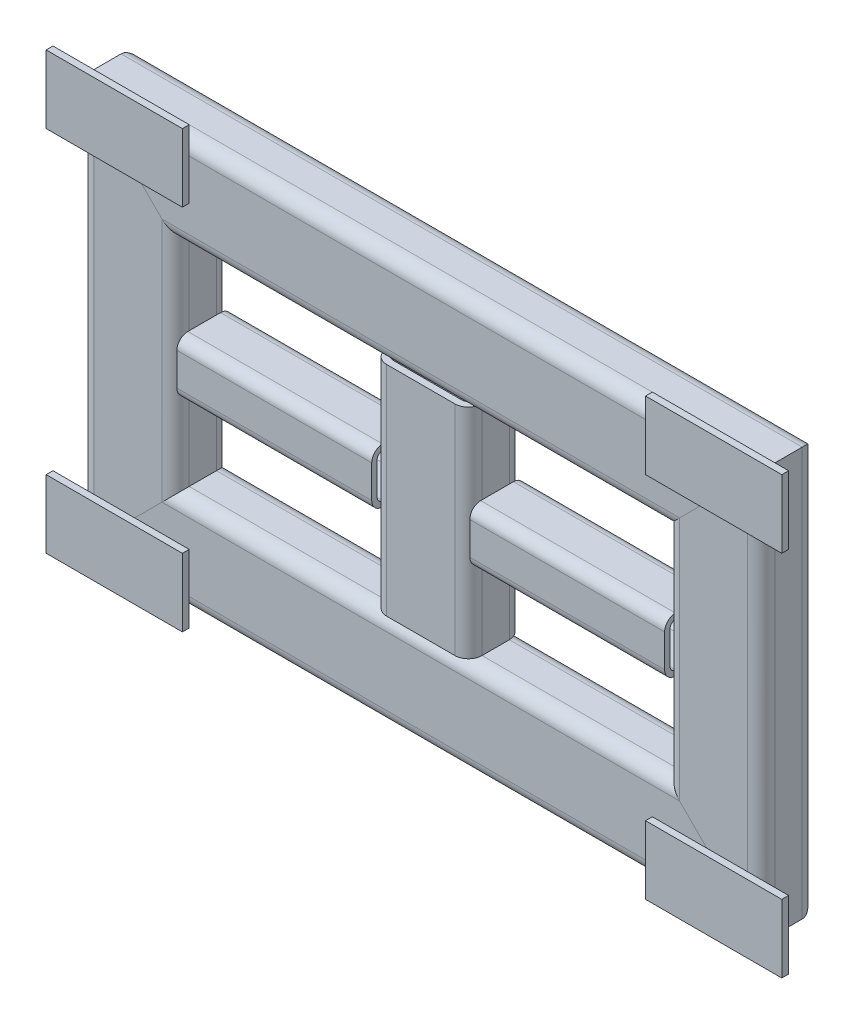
ISO-10303-21;
HEADER;
FILE_DESCRIPTION(('STEP AP214'),'2;1');
FILE_NAME('part.step','',(''),(''),'','','');
FILE_SCHEMA(('AUTOMOTIVE_DESIGN { 1 0 10303 214 1 1 1 1 }'));
ENDSEC;
DATA;
#1=APPLICATION_CONTEXT('core data for automotive mechanical design processes');
#2=APPLICATION_PROTOCOL_DEFINITION('international standard','automotive_design',2000,#1);
#3=PRODUCT_CONTEXT('',#1,'mechanical');
#4=PRODUCT('Part','Part','',(#3));
#5=PRODUCT_RELATED_PRODUCT_CATEGORY('part','',(#4));
#6=PRODUCT_DEFINITION_FORMATION('','',#4);
#7=PRODUCT_DEFINITION_CONTEXT('part definition',#1,'design');
#8=PRODUCT_DEFINITION('design','',#6,#7);
#9=PRODUCT_DEFINITION_SHAPE('','',#8);
#10=(LENGTH_UNIT() NAMED_UNIT(*) SI_UNIT(.MILLI.,.METRE.));
#11=(NAMED_UNIT(*) PLANE_ANGLE_UNIT() SI_UNIT($,.RADIAN.));
#12=(NAMED_UNIT(*) SI_UNIT($,.STERADIAN.) SOLID_ANGLE_UNIT());
#13=UNCERTAINTY_MEASURE_WITH_UNIT(LENGTH_MEASURE(1.E-05),#10,'distance_accuracy_value','');
#14=(GEOMETRIC_REPRESENTATION_CONTEXT(3) GLOBAL_UNCERTAINTY_ASSIGNED_CONTEXT((#13)) GLOBAL_UNIT_ASSIGNED_CONTEXT((#10,
#11,#12)) REPRESENTATION_CONTEXT('',''));
#15=CARTESIAN_POINT('',(0.,0.,0.));
#16=DIRECTION('',(0.,0.,1.));
#17=DIRECTION('',(1.,0.,0.));
#18=AXIS2_PLACEMENT_3D('',#15,#16,#17);
#19=CARTESIAN_POINT('',(270.,-160.,24.9999999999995));
#20=DIRECTION('',(-1.,0.,0.));
#21=DIRECTION('',(0.,-1.,0.));
#22=AXIS2_PLACEMENT_3D('',#19,#20,#21);
#23=PLANE('',#22);
#24=DIRECTION('',(0.,1.,0.));
#25=VECTOR('',#24,1.);
#26=CARTESIAN_POINT('',(270.,-160.,19.9999999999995));
#27=LINE('',#26,#25);
#28=CARTESIAN_POINT('',(270.,-160.,19.9999999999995));
#29=VERTEX_POINT('',#28);
#30=CARTESIAN_POINT('',(270.,-110.,19.9999999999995));
#31=VERTEX_POINT('',#30);
#32=EDGE_CURVE('E192',#29,#31,#27,.T.);
#33=ORIENTED_EDGE('',*,*,#32,.T.);
#34=DIRECTION('',(0.,0.,-1.));
#35=VECTOR('',#34,1.);
#36=CARTESIAN_POINT('',(270.,-110.,24.9999999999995));
#37=LINE('',#36,#35);
#38=CARTESIAN_POINT('',(270.,-110.,24.9999999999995));
#39=VERTEX_POINT('',#38);
#40=EDGE_CURVE('E13',#39,#31,#37,.T.);
#41=ORIENTED_EDGE('',*,*,#40,.F.);
#42=DIRECTION('',(0.,1.,0.));
#43=VECTOR('',#42,1.);
#44=CARTESIAN_POINT('',(270.,-160.,24.9999999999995));
#45=LINE('',#44,#43);
#46=CARTESIAN_POINT('',(270.,-160.,24.9999999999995));
#47=VERTEX_POINT('',#46);
#48=EDGE_CURVE('E179',#47,#39,#45,.T.);
#49=ORIENTED_EDGE('',*,*,#48,.F.);
#50=DIRECTION('',(0.,0.,-1.));
#51=VECTOR('',#50,1.);
#52=CARTESIAN_POINT('',(270.,-160.,24.9999999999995));
#53=LINE('',#52,#51);
#54=EDGE_CURVE('E184',#47,#29,#53,.T.);
#55=ORIENTED_EDGE('',*,*,#54,.T.);
#56=EDGE_LOOP('',(#33,#41,#49,#55));
#57=FACE_BOUND('',#56,.T.);
#58=ADVANCED_FACE('F124',(#57),#23,.F.);
#59=CARTESIAN_POINT('',(270.,-110.,24.9999999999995));
#60=DIRECTION('',(0.,-1.,0.));
#61=DIRECTION('',(0.,0.,1.));
#62=AXIS2_PLACEMENT_3D('',#59,#60,#61);
#63=PLANE('',#62);
#64=DIRECTION('',(-1.,0.,0.));
#65=VECTOR('',#64,1.);
#66=CARTESIAN_POINT('',(270.,-110.,19.9999999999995));
#67=LINE('',#66,#65);
#68=CARTESIAN_POINT('',(170.,-110.,19.9999999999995));
#69=VERTEX_POINT('',#68);
#70=EDGE_CURVE('E183',#31,#69,#67,.T.);
#71=ORIENTED_EDGE('',*,*,#70,.T.);
#72=DIRECTION('',(0.,0.,-1.));
#73=VECTOR('',#72,1.);
#74=CARTESIAN_POINT('',(170.,-110.,24.9999999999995));
#75=LINE('',#74,#73);
#76=CARTESIAN_POINT('',(170.,-110.,24.9999999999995));
#77=VERTEX_POINT('',#76);
#78=EDGE_CURVE('E132',#77,#69,#75,.T.);
#79=ORIENTED_EDGE('',*,*,#78,.F.);
#80=DIRECTION('',(-1.,0.,0.));
#81=VECTOR('',#80,1.);
#82=CARTESIAN_POINT('',(270.,-110.,24.9999999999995));
#83=LINE('',#82,#81);
#84=EDGE_CURVE('E166',#39,#77,#83,.T.);
#85=ORIENTED_EDGE('',*,*,#84,.F.);
#86=ORIENTED_EDGE('',*,*,#40,.T.);
#87=EDGE_LOOP('',(#71,#79,#85,#86));
#88=FACE_BOUND('',#87,.T.);
#89=ADVANCED_FACE('F182',(#88),#63,.F.);
#90=CARTESIAN_POINT('',(170.,-160.,24.9999999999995));
#91=DIRECTION('',(1.,0.,0.));
#92=DIRECTION('',(0.,0.,1.));
#93=AXIS2_PLACEMENT_3D('',#90,#91,#92);
#94=PLANE('',#93);
#95=DIRECTION('',(0.,-1.,0.));
#96=VECTOR('',#95,1.);
#97=CARTESIAN_POINT('',(170.,-160.,19.9999999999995));
#98=LINE('',#97,#96);
#99=CARTESIAN_POINT('',(170.,-160.,19.9999999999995));
#100=VERTEX_POINT('',#99);
#101=EDGE_CURVE('E189',#69,#100,#98,.T.);
#102=ORIENTED_EDGE('',*,*,#101,.T.);
#103=DIRECTION('',(0.,0.,-1.));
#104=VECTOR('',#103,1.);
#105=CARTESIAN_POINT('',(170.,-160.,24.9999999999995));
#106=LINE('',#105,#104);
#107=CARTESIAN_POINT('',(170.,-160.,24.9999999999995));
#108=VERTEX_POINT('',#107);
#109=EDGE_CURVE('E175',#108,#100,#106,.T.);
#110=ORIENTED_EDGE('',*,*,#109,.F.);
#111=DIRECTION('',(0.,-1.,0.));
#112=VECTOR('',#111,1.);
#113=CARTESIAN_POINT('',(170.,-160.,24.9999999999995));
#114=LINE('',#113,#112);
#115=EDGE_CURVE('E171',#77,#108,#114,.T.);
#116=ORIENTED_EDGE('',*,*,#115,.F.);
#117=ORIENTED_EDGE('',*,*,#78,.T.);
#118=EDGE_LOOP('',(#102,#110,#116,#117));
#119=FACE_BOUND('',#118,.T.);
#120=ADVANCED_FACE('F173',(#119),#94,.F.);
#121=CARTESIAN_POINT('',(270.,-160.,24.9999999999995));
#122=DIRECTION('',(0.,1.,0.));
#123=DIRECTION('',(0.,0.,-1.));
#124=AXIS2_PLACEMENT_3D('',#121,#122,#123);
#125=PLANE('',#124);
#126=DIRECTION('',(1.,0.,0.));
#127=VECTOR('',#126,1.);
#128=CARTESIAN_POINT('',(270.,-160.,19.9999999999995));
#129=LINE('',#128,#127);
#130=EDGE_CURVE('E156',#100,#29,#129,.T.);
#131=ORIENTED_EDGE('',*,*,#130,.T.);
#132=ORIENTED_EDGE('',*,*,#54,.F.);
#133=DIRECTION('',(1.,0.,0.));
#134=VECTOR('',#133,1.);
#135=CARTESIAN_POINT('',(270.,-160.,24.9999999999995));
#136=LINE('',#135,#134);
#137=EDGE_CURVE('E140',#108,#47,#136,.T.);
#138=ORIENTED_EDGE('',*,*,#137,.F.);
#139=ORIENTED_EDGE('',*,*,#109,.T.);
#140=EDGE_LOOP('',(#131,#132,#138,#139));
#141=FACE_BOUND('',#140,.T.);
#142=ADVANCED_FACE('F203',(#141),#125,.F.);
#143=CARTESIAN_POINT('',(0.,0.,24.9999999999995));
#144=DIRECTION('',(0.,0.,1.));
#145=DIRECTION('',(-1.,0.,0.));
#146=AXIS2_PLACEMENT_3D('',#143,#144,#145);
#147=PLANE('',#146);
#148=ORIENTED_EDGE('',*,*,#48,.T.);
#149=ORIENTED_EDGE('',*,*,#84,.T.);
#150=ORIENTED_EDGE('',*,*,#115,.T.);
#151=ORIENTED_EDGE('',*,*,#137,.T.);
#152=EDGE_LOOP('',(#148,#149,#150,#151));
#153=FACE_BOUND('',#152,.T.);
#154=ADVANCED_FACE('F177',(#153),#147,.T.);
#155=CARTESIAN_POINT('',(0.,0.,19.9999999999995));
#156=DIRECTION('',(0.,0.,1.));
#157=DIRECTION('',(-1.,0.,0.));
#158=AXIS2_PLACEMENT_3D('',#155,#156,#157);
#159=PLANE('',#158);
#160=ORIENTED_EDGE('',*,*,#32,.F.);
#161=ORIENTED_EDGE('',*,*,#130,.F.);
#162=ORIENTED_EDGE('',*,*,#101,.F.);
#163=ORIENTED_EDGE('',*,*,#70,.F.);
#164=EDGE_LOOP('',(#160,#161,#162,#163));
#165=FACE_BOUND('',#164,.T.);
#166=ADVANCED_FACE('F197',(#165),#159,.F.);
#167=CLOSED_SHELL('',(#58,#89,#120,#142,#154,#166));
#168=MANIFOLD_SOLID_BREP('B2',#167);
#169=CARTESIAN_POINT('',(-270.,-160.,24.9999999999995));
#170=DIRECTION('',(1.,0.,0.));
#171=DIRECTION('',(0.,-1.,0.));
#172=AXIS2_PLACEMENT_3D('',#169,#170,#171);
#173=PLANE('',#172);
#174=DIRECTION('',(0.,1.,0.));
#175=VECTOR('',#174,1.);
#176=CARTESIAN_POINT('',(-270.,-160.,19.9999999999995));
#177=LINE('',#176,#175);
#178=CARTESIAN_POINT('',(-270.,-160.,19.9999999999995));
#179=VERTEX_POINT('',#178);
#180=CARTESIAN_POINT('',(-270.,-110.,19.9999999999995));
#181=VERTEX_POINT('',#180);
#182=EDGE_CURVE('E309',#179,#181,#177,.T.);
#183=ORIENTED_EDGE('',*,*,#182,.F.);
#184=DIRECTION('',(0.,0.,-1.));
#185=VECTOR('',#184,1.);
#186=CARTESIAN_POINT('',(-270.,-160.,24.9999999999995));
#187=LINE('',#186,#185);
#188=CARTESIAN_POINT('',(-270.,-160.,24.9999999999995));
#189=VERTEX_POINT('',#188);
#190=EDGE_CURVE('E308',#189,#179,#187,.T.);
#191=ORIENTED_EDGE('',*,*,#190,.F.);
#192=DIRECTION('',(0.,1.,0.));
#193=VECTOR('',#192,1.);
#194=CARTESIAN_POINT('',(-270.,-160.,24.9999999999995));
#195=LINE('',#194,#193);
#196=CARTESIAN_POINT('',(-270.,-110.,24.9999999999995));
#197=VERTEX_POINT('',#196);
#198=EDGE_CURVE('E303',#189,#197,#195,.T.);
#199=ORIENTED_EDGE('',*,*,#198,.T.);
#200=DIRECTION('',(0.,0.,-1.));
#201=VECTOR('',#200,1.);
#202=CARTESIAN_POINT('',(-270.,-110.,24.9999999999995));
#203=LINE('',#202,#201);
#204=EDGE_CURVE('E122',#197,#181,#203,.T.);
#205=ORIENTED_EDGE('',*,*,#204,.T.);
#206=EDGE_LOOP('',(#183,#191,#199,#205));
#207=FACE_BOUND('',#206,.T.);
#208=ADVANCED_FACE('F246',(#207),#173,.F.);
#209=CARTESIAN_POINT('',(-270.,-110.,24.9999999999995));
#210=DIRECTION('',(0.,-1.,0.));
#211=DIRECTION('',(0.,0.,1.));
#212=AXIS2_PLACEMENT_3D('',#209,#210,#211);
#213=PLANE('',#212);
#214=DIRECTION('',(1.,0.,0.));
#215=VECTOR('',#214,1.);
#216=CARTESIAN_POINT('',(-270.,-110.,19.9999999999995));
#217=LINE('',#216,#215);
#218=CARTESIAN_POINT('',(-170.,-110.,19.9999999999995));
#219=VERTEX_POINT('',#218);
#220=EDGE_CURVE('E311',#181,#219,#217,.T.);
#221=ORIENTED_EDGE('',*,*,#220,.F.);
#222=ORIENTED_EDGE('',*,*,#204,.F.);
#223=DIRECTION('',(1.,0.,0.));
#224=VECTOR('',#223,1.);
#225=CARTESIAN_POINT('',(-270.,-110.,24.9999999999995));
#226=LINE('',#225,#224);
#227=CARTESIAN_POINT('',(-170.,-110.,24.9999999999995));
#228=VERTEX_POINT('',#227);
#229=EDGE_CURVE('E287',#197,#228,#226,.T.);
#230=ORIENTED_EDGE('',*,*,#229,.T.);
#231=DIRECTION('',(0.,0.,-1.));
#232=VECTOR('',#231,1.);
#233=CARTESIAN_POINT('',(-170.,-110.,24.9999999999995));
#234=LINE('',#233,#232);
#235=EDGE_CURVE('E254',#228,#219,#234,.T.);
#236=ORIENTED_EDGE('',*,*,#235,.T.);
#237=EDGE_LOOP('',(#221,#222,#230,#236));
#238=FACE_BOUND('',#237,.T.);
#239=ADVANCED_FACE('F301',(#238),#213,.F.);
#240=CARTESIAN_POINT('',(-170.,-160.,24.9999999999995));
#241=DIRECTION('',(-1.,0.,0.));
#242=DIRECTION('',(0.,0.,1.));
#243=AXIS2_PLACEMENT_3D('',#240,#241,#242);
#244=PLANE('',#243);
#245=DIRECTION('',(0.,-1.,0.));
#246=VECTOR('',#245,1.);
#247=CARTESIAN_POINT('',(-170.,-160.,19.9999999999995));
#248=LINE('',#247,#246);
#249=CARTESIAN_POINT('',(-170.,-160.,19.9999999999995));
#250=VERTEX_POINT('',#249);
#251=EDGE_CURVE('E297',#219,#250,#248,.T.);
#252=ORIENTED_EDGE('',*,*,#251,.F.);
#253=ORIENTED_EDGE('',*,*,#235,.F.);
#254=DIRECTION('',(0.,-1.,0.));
#255=VECTOR('',#254,1.);
#256=CARTESIAN_POINT('',(-170.,-160.,24.9999999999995));
#257=LINE('',#256,#255);
#258=CARTESIAN_POINT('',(-170.,-160.,24.9999999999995));
#259=VERTEX_POINT('',#258);
#260=EDGE_CURVE('E290',#228,#259,#257,.T.);
#261=ORIENTED_EDGE('',*,*,#260,.T.);
#262=DIRECTION('',(0.,0.,-1.));
#263=VECTOR('',#262,1.);
#264=CARTESIAN_POINT('',(-170.,-160.,24.9999999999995));
#265=LINE('',#264,#263);
#266=EDGE_CURVE('E300',#259,#250,#265,.T.);
#267=ORIENTED_EDGE('',*,*,#266,.T.);
#268=EDGE_LOOP('',(#252,#253,#261,#267));
#269=FACE_BOUND('',#268,.T.);
#270=ADVANCED_FACE('F296',(#269),#244,.F.);
#271=CARTESIAN_POINT('',(-270.,-160.,24.9999999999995));
#272=DIRECTION('',(0.,1.,0.));
#273=DIRECTION('',(0.,0.,-1.));
#274=AXIS2_PLACEMENT_3D('',#271,#272,#273);
#275=PLANE('',#274);
#276=DIRECTION('',(-1.,0.,0.));
#277=VECTOR('',#276,1.);
#278=CARTESIAN_POINT('',(-270.,-160.,19.9999999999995));
#279=LINE('',#278,#277);
#280=EDGE_CURVE('E276',#250,#179,#279,.T.);
#281=ORIENTED_EDGE('',*,*,#280,.F.);
#282=ORIENTED_EDGE('',*,*,#266,.F.);
#283=DIRECTION('',(-1.,0.,0.));
#284=VECTOR('',#283,1.);
#285=CARTESIAN_POINT('',(-270.,-160.,24.9999999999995));
#286=LINE('',#285,#284);
#287=EDGE_CURVE('E262',#259,#189,#286,.T.);
#288=ORIENTED_EDGE('',*,*,#287,.T.);
#289=ORIENTED_EDGE('',*,*,#190,.T.);
#290=EDGE_LOOP('',(#281,#282,#288,#289));
#291=FACE_BOUND('',#290,.T.);
#292=ADVANCED_FACE('F320',(#291),#275,.F.);
#293=CARTESIAN_POINT('',(0.,0.,24.9999999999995));
#294=DIRECTION('',(0.,0.,1.));
#295=DIRECTION('',(1.,0.,0.));
#296=AXIS2_PLACEMENT_3D('',#293,#294,#295);
#297=PLANE('',#296);
#298=ORIENTED_EDGE('',*,*,#198,.F.);
#299=ORIENTED_EDGE('',*,*,#287,.F.);
#300=ORIENTED_EDGE('',*,*,#260,.F.);
#301=ORIENTED_EDGE('',*,*,#229,.F.);
#302=EDGE_LOOP('',(#298,#299,#300,#301));
#303=FACE_BOUND('',#302,.T.);
#304=ADVANCED_FACE('F292',(#303),#297,.T.);
#305=CARTESIAN_POINT('',(0.,0.,19.9999999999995));
#306=DIRECTION('',(0.,0.,1.));
#307=DIRECTION('',(1.,0.,0.));
#308=AXIS2_PLACEMENT_3D('',#305,#306,#307);
#309=PLANE('',#308);
#310=ORIENTED_EDGE('',*,*,#182,.T.);
#311=ORIENTED_EDGE('',*,*,#220,.T.);
#312=ORIENTED_EDGE('',*,*,#251,.T.);
#313=ORIENTED_EDGE('',*,*,#280,.T.);
#314=EDGE_LOOP('',(#310,#311,#312,#313));
#315=FACE_BOUND('',#314,.T.);
#316=ADVANCED_FACE('F316',(#315),#309,.F.);
#317=CLOSED_SHELL('',(#208,#239,#270,#292,#304,#316));
#318=MANIFOLD_SOLID_BREP('B7',#317);
#319=CARTESIAN_POINT('',(270.,160.,24.9999999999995));
#320=DIRECTION('',(-1.,0.,0.));
#321=DIRECTION('',(0.,1.,0.));
#322=AXIS2_PLACEMENT_3D('',#319,#320,#321);
#323=PLANE('',#322);
#324=DIRECTION('',(0.,-1.,0.));
#325=VECTOR('',#324,1.);
#326=CARTESIAN_POINT('',(270.,160.,19.9999999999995));
#327=LINE('',#326,#325);
#328=CARTESIAN_POINT('',(270.,160.,19.9999999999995));
#329=VERTEX_POINT('',#328);
#330=CARTESIAN_POINT('',(270.,110.,19.9999999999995));
#331=VERTEX_POINT('',#330);
#332=EDGE_CURVE('E431',#329,#331,#327,.T.);
#333=ORIENTED_EDGE('',*,*,#332,.F.);
#334=DIRECTION('',(0.,0.,-1.));
#335=VECTOR('',#334,1.);
#336=CARTESIAN_POINT('',(270.,160.,24.9999999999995));
#337=LINE('',#336,#335);
#338=CARTESIAN_POINT('',(270.,160.,24.9999999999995));
#339=VERTEX_POINT('',#338);
#340=EDGE_CURVE('E430',#339,#329,#337,.T.);
#341=ORIENTED_EDGE('',*,*,#340,.F.);
#342=DIRECTION('',(0.,-1.,0.));
#343=VECTOR('',#342,1.);
#344=CARTESIAN_POINT('',(270.,160.,24.9999999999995));
#345=LINE('',#344,#343);
#346=CARTESIAN_POINT('',(270.,110.,24.9999999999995));
#347=VERTEX_POINT('',#346);
#348=EDGE_CURVE('E425',#339,#347,#345,.T.);
#349=ORIENTED_EDGE('',*,*,#348,.T.);
#350=DIRECTION('',(0.,0.,-1.));
#351=VECTOR('',#350,1.);
#352=CARTESIAN_POINT('',(270.,110.,24.9999999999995));
#353=LINE('',#352,#351);
#354=EDGE_CURVE('E244',#347,#331,#353,.T.);
#355=ORIENTED_EDGE('',*,*,#354,.T.);
#356=EDGE_LOOP('',(#333,#341,#349,#355));
#357=FACE_BOUND('',#356,.T.);
#358=ADVANCED_FACE('F368',(#357),#323,.F.);
#359=CARTESIAN_POINT('',(270.,110.,24.9999999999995));
#360=DIRECTION('',(0.,1.,0.));
#361=DIRECTION('',(0.,0.,1.));
#362=AXIS2_PLACEMENT_3D('',#359,#360,#361);
#363=PLANE('',#362);
#364=DIRECTION('',(-1.,0.,0.));
#365=VECTOR('',#364,1.);
#366=CARTESIAN_POINT('',(270.,110.,19.9999999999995));
#367=LINE('',#366,#365);
#368=CARTESIAN_POINT('',(170.,110.,19.9999999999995));
#369=VERTEX_POINT('',#368);
#370=EDGE_CURVE('E433',#331,#369,#367,.T.);
#371=ORIENTED_EDGE('',*,*,#370,.F.);
#372=ORIENTED_EDGE('',*,*,#354,.F.);
#373=DIRECTION('',(-1.,0.,0.));
#374=VECTOR('',#373,1.);
#375=CARTESIAN_POINT('',(270.,110.,24.9999999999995));
#376=LINE('',#375,#374);
#377=CARTESIAN_POINT('',(170.,110.,24.9999999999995));
#378=VERTEX_POINT('',#377);
#379=EDGE_CURVE('E409',#347,#378,#376,.T.);
#380=ORIENTED_EDGE('',*,*,#379,.T.);
#381=DIRECTION('',(0.,0.,-1.));
#382=VECTOR('',#381,1.);
#383=CARTESIAN_POINT('',(170.,110.,24.9999999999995));
#384=LINE('',#383,#382);
#385=EDGE_CURVE('E376',#378,#369,#384,.T.);
#386=ORIENTED_EDGE('',*,*,#385,.T.);
#387=EDGE_LOOP('',(#371,#372,#380,#386));
#388=FACE_BOUND('',#387,.T.);
#389=ADVANCED_FACE('F423',(#388),#363,.F.);
#390=CARTESIAN_POINT('',(170.,160.,24.9999999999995));
#391=DIRECTION('',(1.,0.,0.));
#392=DIRECTION('',(0.,0.,1.));
#393=AXIS2_PLACEMENT_3D('',#390,#391,#392);
#394=PLANE('',#393);
#395=DIRECTION('',(0.,1.,0.));
#396=VECTOR('',#395,1.);
#397=CARTESIAN_POINT('',(170.,160.,19.9999999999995));
#398=LINE('',#397,#396);
#399=CARTESIAN_POINT('',(170.,160.,19.9999999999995));
#400=VERTEX_POINT('',#399);
#401=EDGE_CURVE('E419',#369,#400,#398,.T.);
#402=ORIENTED_EDGE('',*,*,#401,.F.);
#403=ORIENTED_EDGE('',*,*,#385,.F.);
#404=DIRECTION('',(0.,1.,0.));
#405=VECTOR('',#404,1.);
#406=CARTESIAN_POINT('',(170.,160.,24.9999999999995));
#407=LINE('',#406,#405);
#408=CARTESIAN_POINT('',(170.,160.,24.9999999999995));
#409=VERTEX_POINT('',#408);
#410=EDGE_CURVE('E412',#378,#409,#407,.T.);
#411=ORIENTED_EDGE('',*,*,#410,.T.);
#412=DIRECTION('',(0.,0.,-1.));
#413=VECTOR('',#412,1.);
#414=CARTESIAN_POINT('',(170.,160.,24.9999999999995));
#415=LINE('',#414,#413);
#416=EDGE_CURVE('E422',#409,#400,#415,.T.);
#417=ORIENTED_EDGE('',*,*,#416,.T.);
#418=EDGE_LOOP('',(#402,#403,#411,#417));
#419=FACE_BOUND('',#418,.T.);
#420=ADVANCED_FACE('F418',(#419),#394,.F.);
#421=CARTESIAN_POINT('',(270.,160.,24.9999999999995));
#422=DIRECTION('',(0.,-1.,0.));
#423=DIRECTION('',(0.,0.,-1.));
#424=AXIS2_PLACEMENT_3D('',#421,#422,#423);
#425=PLANE('',#424);
#426=DIRECTION('',(1.,0.,0.));
#427=VECTOR('',#426,1.);
#428=CARTESIAN_POINT('',(270.,160.,19.9999999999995));
#429=LINE('',#428,#427);
#430=EDGE_CURVE('E398',#400,#329,#429,.T.);
#431=ORIENTED_EDGE('',*,*,#430,.F.);
#432=ORIENTED_EDGE('',*,*,#416,.F.);
#433=DIRECTION('',(1.,0.,0.));
#434=VECTOR('',#433,1.);
#435=CARTESIAN_POINT('',(270.,160.,24.9999999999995));
#436=LINE('',#435,#434);
#437=EDGE_CURVE('E384',#409,#339,#436,.T.);
#438=ORIENTED_EDGE('',*,*,#437,.T.);
#439=ORIENTED_EDGE('',*,*,#340,.T.);
#440=EDGE_LOOP('',(#431,#432,#438,#439));
#441=FACE_BOUND('',#440,.T.);
#442=ADVANCED_FACE('F442',(#441),#425,.F.);
#443=CARTESIAN_POINT('',(0.,0.,24.9999999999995));
#444=DIRECTION('',(0.,0.,1.));
#445=DIRECTION('',(-1.,0.,0.));
#446=AXIS2_PLACEMENT_3D('',#443,#444,#445);
#447=PLANE('',#446);
#448=ORIENTED_EDGE('',*,*,#348,.F.);
#449=ORIENTED_EDGE('',*,*,#437,.F.);
#450=ORIENTED_EDGE('',*,*,#410,.F.);
#451=ORIENTED_EDGE('',*,*,#379,.F.);
#452=EDGE_LOOP('',(#448,#449,#450,#451));
#453=FACE_BOUND('',#452,.T.);
#454=ADVANCED_FACE('F414',(#453),#447,.T.);
#455=CARTESIAN_POINT('',(0.,0.,19.9999999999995));
#456=DIRECTION('',(0.,0.,1.));
#457=DIRECTION('',(-1.,0.,0.));
#458=AXIS2_PLACEMENT_3D('',#455,#456,#457);
#459=PLANE('',#458);
#460=ORIENTED_EDGE('',*,*,#332,.T.);
#461=ORIENTED_EDGE('',*,*,#370,.T.);
#462=ORIENTED_EDGE('',*,*,#401,.T.);
#463=ORIENTED_EDGE('',*,*,#430,.T.);
#464=EDGE_LOOP('',(#460,#461,#462,#463));
#465=FACE_BOUND('',#464,.T.);
#466=ADVANCED_FACE('F438',(#465),#459,.F.);
#467=CLOSED_SHELL('',(#358,#389,#420,#442,#454,#466));
#468=MANIFOLD_SOLID_BREP('B116',#467);
#469=CARTESIAN_POINT('',(-270.,160.,24.9999999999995));
#470=DIRECTION('',(1.,0.,0.));
#471=DIRECTION('',(0.,1.,0.));
#472=AXIS2_PLACEMENT_3D('',#469,#470,#471);
#473=PLANE('',#472);
#474=DIRECTION('',(0.,-1.,0.));
#475=VECTOR('',#474,1.);
#476=CARTESIAN_POINT('',(-270.,160.,19.9999999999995));
#477=LINE('',#476,#475);
#478=CARTESIAN_POINT('',(-270.,160.,19.9999999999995));
#479=VERTEX_POINT('',#478);
#480=CARTESIAN_POINT('',(-270.,110.,19.9999999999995));
#481=VERTEX_POINT('',#480);
#482=EDGE_CURVE('E552',#479,#481,#477,.T.);
#483=ORIENTED_EDGE('',*,*,#482,.T.);
#484=DIRECTION('',(0.,0.,-1.));
#485=VECTOR('',#484,1.);
#486=CARTESIAN_POINT('',(-270.,110.,24.9999999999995));
#487=LINE('',#486,#485);
#488=CARTESIAN_POINT('',(-270.,110.,24.9999999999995));
#489=VERTEX_POINT('',#488);
#490=EDGE_CURVE('E366',#489,#481,#487,.T.);
#491=ORIENTED_EDGE('',*,*,#490,.F.);
#492=DIRECTION('',(0.,-1.,0.));
#493=VECTOR('',#492,1.);
#494=CARTESIAN_POINT('',(-270.,160.,24.9999999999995));
#495=LINE('',#494,#493);
#496=CARTESIAN_POINT('',(-270.,160.,24.9999999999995));
#497=VERTEX_POINT('',#496);
#498=EDGE_CURVE('E540',#497,#489,#495,.T.);
#499=ORIENTED_EDGE('',*,*,#498,.F.);
#500=DIRECTION('',(0.,0.,-1.));
#501=VECTOR('',#500,1.);
#502=CARTESIAN_POINT('',(-270.,160.,24.9999999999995));
#503=LINE('',#502,#501);
#504=EDGE_CURVE('E548',#497,#479,#503,.T.);
#505=ORIENTED_EDGE('',*,*,#504,.T.);
#506=EDGE_LOOP('',(#483,#491,#499,#505));
#507=FACE_BOUND('',#506,.T.);
#508=ADVANCED_FACE('F489',(#507),#473,.F.);
#509=CARTESIAN_POINT('',(-270.,110.,24.9999999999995));
#510=DIRECTION('',(0.,1.,0.));
#511=DIRECTION('',(0.,0.,1.));
#512=AXIS2_PLACEMENT_3D('',#509,#510,#511);
#513=PLANE('',#512);
#514=DIRECTION('',(1.,0.,0.));
#515=VECTOR('',#514,1.);
#516=CARTESIAN_POINT('',(-270.,110.,19.9999999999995));
#517=LINE('',#516,#515);
#518=CARTESIAN_POINT('',(-170.,110.,19.9999999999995));
#519=VERTEX_POINT('',#518);
#520=EDGE_CURVE('E544',#481,#519,#517,.T.);
#521=ORIENTED_EDGE('',*,*,#520,.T.);
#522=DIRECTION('',(0.,0.,-1.));
#523=VECTOR('',#522,1.);
#524=CARTESIAN_POINT('',(-170.,110.,24.9999999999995));
#525=LINE('',#524,#523);
#526=CARTESIAN_POINT('',(-170.,110.,24.9999999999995));
#527=VERTEX_POINT('',#526);
#528=EDGE_CURVE('E497',#527,#519,#525,.T.);
#529=ORIENTED_EDGE('',*,*,#528,.F.);
#530=DIRECTION('',(1.,0.,0.));
#531=VECTOR('',#530,1.);
#532=CARTESIAN_POINT('',(-270.,110.,24.9999999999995));
#533=LINE('',#532,#531);
#534=EDGE_CURVE('E535',#489,#527,#533,.T.);
#535=ORIENTED_EDGE('',*,*,#534,.F.);
#536=ORIENTED_EDGE('',*,*,#490,.T.);
#537=EDGE_LOOP('',(#521,#529,#535,#536));
#538=FACE_BOUND('',#537,.T.);
#539=ADVANCED_FACE('F543',(#538),#513,.F.);
#540=CARTESIAN_POINT('',(-170.,160.,24.9999999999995));
#541=DIRECTION('',(-1.,0.,0.));
#542=DIRECTION('',(0.,0.,1.));
#543=AXIS2_PLACEMENT_3D('',#540,#541,#542);
#544=PLANE('',#543);
#545=DIRECTION('',(0.,1.,0.));
#546=VECTOR('',#545,1.);
#547=CARTESIAN_POINT('',(-170.,160.,19.9999999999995));
#548=LINE('',#547,#546);
#549=CARTESIAN_POINT('',(-170.,160.,19.9999999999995));
#550=VERTEX_POINT('',#549);
#551=EDGE_CURVE('E522',#519,#550,#548,.T.);
#552=ORIENTED_EDGE('',*,*,#551,.T.);
#553=DIRECTION('',(0.,0.,-1.));
#554=VECTOR('',#553,1.);
#555=CARTESIAN_POINT('',(-170.,160.,24.9999999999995));
#556=LINE('',#555,#554);
#557=CARTESIAN_POINT('',(-170.,160.,24.9999999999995));
#558=VERTEX_POINT('',#557);
#559=EDGE_CURVE('E545',#558,#550,#556,.T.);
#560=ORIENTED_EDGE('',*,*,#559,.F.);
#561=DIRECTION('',(0.,1.,0.));
#562=VECTOR('',#561,1.);
#563=CARTESIAN_POINT('',(-170.,160.,24.9999999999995));
#564=LINE('',#563,#562);
#565=EDGE_CURVE('E538',#527,#558,#564,.T.);
#566=ORIENTED_EDGE('',*,*,#565,.F.);
#567=ORIENTED_EDGE('',*,*,#528,.T.);
#568=EDGE_LOOP('',(#552,#560,#566,#567));
#569=FACE_BOUND('',#568,.T.);
#570=ADVANCED_FACE('F546',(#569),#544,.F.);
#571=CARTESIAN_POINT('',(-270.,160.,24.9999999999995));
#572=DIRECTION('',(0.,-1.,0.));
#573=DIRECTION('',(0.,0.,-1.));
#574=AXIS2_PLACEMENT_3D('',#571,#572,#573);
#575=PLANE('',#574);
#576=DIRECTION('',(-1.,0.,0.));
#577=VECTOR('',#576,1.);
#578=CARTESIAN_POINT('',(-270.,160.,19.9999999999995));
#579=LINE('',#578,#577);
#580=EDGE_CURVE('E528',#550,#479,#579,.T.);
#581=ORIENTED_EDGE('',*,*,#580,.T.);
#582=ORIENTED_EDGE('',*,*,#504,.F.);
#583=DIRECTION('',(-1.,0.,0.));
#584=VECTOR('',#583,1.);
#585=CARTESIAN_POINT('',(-270.,160.,24.9999999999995));
#586=LINE('',#585,#584);
#587=EDGE_CURVE('E505',#558,#497,#586,.T.);
#588=ORIENTED_EDGE('',*,*,#587,.F.);
#589=ORIENTED_EDGE('',*,*,#559,.T.);
#590=EDGE_LOOP('',(#581,#582,#588,#589));
#591=FACE_BOUND('',#590,.T.);
#592=ADVANCED_FACE('F559',(#591),#575,.F.);
#593=CARTESIAN_POINT('',(0.,0.,24.9999999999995));
#594=DIRECTION('',(0.,0.,1.));
#595=DIRECTION('',(1.,0.,0.));
#596=AXIS2_PLACEMENT_3D('',#593,#594,#595);
#597=PLANE('',#596);
#598=ORIENTED_EDGE('',*,*,#498,.T.);
#599=ORIENTED_EDGE('',*,*,#534,.T.);
#600=ORIENTED_EDGE('',*,*,#565,.T.);
#601=ORIENTED_EDGE('',*,*,#587,.T.);
#602=EDGE_LOOP('',(#598,#599,#600,#601));
#603=FACE_BOUND('',#602,.T.);
#604=ADVANCED_FACE('F536',(#603),#597,.T.);
#605=CARTESIAN_POINT('',(0.,0.,19.9999999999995));
#606=DIRECTION('',(0.,0.,1.));
#607=DIRECTION('',(1.,0.,0.));
#608=AXIS2_PLACEMENT_3D('',#605,#606,#607);
#609=PLANE('',#608);
#610=ORIENTED_EDGE('',*,*,#482,.F.);
#611=ORIENTED_EDGE('',*,*,#580,.F.);
#612=ORIENTED_EDGE('',*,*,#551,.F.);
#613=ORIENTED_EDGE('',*,*,#520,.F.);
#614=EDGE_LOOP('',(#610,#611,#612,#613));
#615=FACE_BOUND('',#614,.T.);
#616=ADVANCED_FACE('F562',(#615),#609,.F.);
#617=CLOSED_SHELL('',(#508,#539,#570,#592,#604,#616));
#618=MANIFOLD_SOLID_BREP('B238',#617);
#619=CARTESIAN_POINT('',(250.,20.0000000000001,12.));
#620=DIRECTION('',(0.,-1.,0.));
#621=DIRECTION('',(1.,0.,0.));
#622=AXIS2_PLACEMENT_3D('',#619,#620,#621);
#623=PLANE('',#622);
#624=DIRECTION('',(0.,0.,-1.));
#625=VECTOR('',#624,1.);
#626=CARTESIAN_POINT('',(36.0000000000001,20.,11.9999999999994));
#627=LINE('',#626,#625);
#628=CARTESIAN_POINT('',(36.0000000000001,20.,12.));
#629=VERTEX_POINT('',#628);
#630=CARTESIAN_POINT('',(36.0000000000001,20.,-12.));
#631=VERTEX_POINT('',#630);
#632=EDGE_CURVE('E773',#629,#631,#627,.T.);
#633=ORIENTED_EDGE('',*,*,#632,.F.);
#634=DIRECTION('',(-1.,0.,0.));
#635=VECTOR('',#634,1.);
#636=CARTESIAN_POINT('',(250.,20.0000000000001,12.));
#637=LINE('',#636,#635);
#638=CARTESIAN_POINT('',(179.,20.0000000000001,12.));
#639=VERTEX_POINT('',#638);
#640=EDGE_CURVE('E806',#639,#629,#637,.T.);
#641=ORIENTED_EDGE('',*,*,#640,.F.);
#642=DIRECTION('',(0.,0.,1.));
#643=VECTOR('',#642,1.);
#644=CARTESIAN_POINT('',(179.,20.0000000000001,11.9999999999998));
#645=LINE('',#644,#643);
#646=CARTESIAN_POINT('',(179.,20.0000000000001,-12.));
#647=VERTEX_POINT('',#646);
#648=EDGE_CURVE('E816',#647,#639,#645,.T.);
#649=ORIENTED_EDGE('',*,*,#648,.F.);
#650=DIRECTION('',(-1.,0.,0.));
#651=VECTOR('',#650,1.);
#652=CARTESIAN_POINT('',(250.,20.0000000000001,-12.));
#653=LINE('',#652,#651);
#654=EDGE_CURVE('E837',#647,#631,#653,.T.);
#655=ORIENTED_EDGE('',*,*,#654,.T.);
#656=EDGE_LOOP('',(#633,#641,#649,#655));
#657=FACE_BOUND('',#656,.T.);
#658=ADVANCED_FACE('F623',(#657),#623,.F.);
#659=CARTESIAN_POINT('',(250.,12.0000000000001,-12.));
#660=DIRECTION('',(-1.,0.,0.));
#661=DIRECTION('',(0.,-1.,0.));
#662=AXIS2_PLACEMENT_3D('',#659,#660,#661);
#663=CYLINDRICAL_SURFACE('',#662,8.);
#664=CARTESIAN_POINT('',(36.0000000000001,12.,-12.));
#665=DIRECTION('',(-1.,0.,0.));
#666=DIRECTION('',(0.,0.,1.));
#667=AXIS2_PLACEMENT_3D('',#664,#665,#666);
#668=CIRCLE('',#667,8.);
#669=CARTESIAN_POINT('',(36.0000000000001,11.9999999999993,-20.));
#670=VERTEX_POINT('',#669);
#671=EDGE_CURVE('E772',#631,#670,#668,.T.);
#672=ORIENTED_EDGE('',*,*,#671,.F.);
#673=ORIENTED_EDGE('',*,*,#654,.F.);
#674=CARTESIAN_POINT('',(179.,12.0000000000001,-12.));
#675=DIRECTION('',(1.,0.,0.));
#676=DIRECTION('',(0.,0.,-1.));
#677=AXIS2_PLACEMENT_3D('',#674,#675,#676);
#678=CIRCLE('',#677,8.);
#679=CARTESIAN_POINT('',(179.,12.0000000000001,-20.));
#680=VERTEX_POINT('',#679);
#681=EDGE_CURVE('E711',#680,#647,#678,.T.);
#682=ORIENTED_EDGE('',*,*,#681,.F.);
#683=DIRECTION('',(-1.,0.,0.));
#684=VECTOR('',#683,1.);
#685=CARTESIAN_POINT('',(250.,12.0000000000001,-20.));
#686=LINE('',#685,#684);
#687=EDGE_CURVE('E834',#680,#670,#686,.T.);
#688=ORIENTED_EDGE('',*,*,#687,.T.);
#689=EDGE_LOOP('',(#672,#673,#682,#688));
#690=FACE_BOUND('',#689,.T.);
#691=ADVANCED_FACE('F898',(#690),#663,.T.);
#692=CARTESIAN_POINT('',(250.,-11.9999999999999,-20.));
#693=DIRECTION('',(0.,0.,1.));
#694=DIRECTION('',(1.,0.,0.));
#695=AXIS2_PLACEMENT_3D('',#692,#693,#694);
#696=PLANE('',#695);
#697=DIRECTION('',(0.,-1.,0.));
#698=VECTOR('',#697,1.);
#699=CARTESIAN_POINT('',(36.0000000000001,-11.9999999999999,-20.));
#700=LINE('',#699,#698);
#701=CARTESIAN_POINT('',(36.0000000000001,-12.0000000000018,-20.));
#702=VERTEX_POINT('',#701);
#703=EDGE_CURVE('E770',#670,#702,#700,.T.);
#704=ORIENTED_EDGE('',*,*,#703,.F.);
#705=ORIENTED_EDGE('',*,*,#687,.F.);
#706=DIRECTION('',(0.,1.,0.));
#707=VECTOR('',#706,1.);
#708=CARTESIAN_POINT('',(179.,-11.9999999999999,-20.));
#709=LINE('',#708,#707);
#710=CARTESIAN_POINT('',(179.,-12.0000000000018,-20.));
#711=VERTEX_POINT('',#710);
#712=EDGE_CURVE('E707',#711,#680,#709,.T.);
#713=ORIENTED_EDGE('',*,*,#712,.F.);
#714=DIRECTION('',(-1.,0.,0.));
#715=VECTOR('',#714,1.);
#716=CARTESIAN_POINT('',(250.,-11.9999999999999,-20.));
#717=LINE('',#716,#715);
#718=EDGE_CURVE('E831',#711,#702,#717,.T.);
#719=ORIENTED_EDGE('',*,*,#718,.T.);
#720=EDGE_LOOP('',(#704,#705,#713,#719));
#721=FACE_BOUND('',#720,.T.);
#722=ADVANCED_FACE('F896',(#721),#696,.F.);
#723=CARTESIAN_POINT('',(250.,-11.9999999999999,-12.));
#724=DIRECTION('',(-1.,0.,0.));
#725=DIRECTION('',(0.,-1.,0.));
#726=AXIS2_PLACEMENT_3D('',#723,#724,#725);
#727=CYLINDRICAL_SURFACE('',#726,8.);
#728=CARTESIAN_POINT('',(36.0000000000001,-12.,-12.));
#729=DIRECTION('',(-1.,0.,0.));
#730=DIRECTION('',(0.,0.,1.));
#731=AXIS2_PLACEMENT_3D('',#728,#729,#730);
#732=CIRCLE('',#731,8.);
#733=CARTESIAN_POINT('',(36.0000000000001,-20.,-12.));
#734=VERTEX_POINT('',#733);
#735=EDGE_CURVE('E768',#702,#734,#732,.T.);
#736=ORIENTED_EDGE('',*,*,#735,.F.);
#737=ORIENTED_EDGE('',*,*,#718,.F.);
#738=CARTESIAN_POINT('',(179.,-11.9999999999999,-12.));
#739=DIRECTION('',(1.,0.,0.));
#740=DIRECTION('',(0.,0.,-1.));
#741=AXIS2_PLACEMENT_3D('',#738,#739,#740);
#742=CIRCLE('',#741,8.);
#743=CARTESIAN_POINT('',(179.,-19.9999999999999,-12.));
#744=VERTEX_POINT('',#743);
#745=EDGE_CURVE('E812',#744,#711,#742,.T.);
#746=ORIENTED_EDGE('',*,*,#745,.F.);
#747=DIRECTION('',(-1.,0.,0.));
#748=VECTOR('',#747,1.);
#749=CARTESIAN_POINT('',(250.,-19.9999999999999,-12.));
#750=LINE('',#749,#748);
#751=EDGE_CURVE('E828',#744,#734,#750,.T.);
#752=ORIENTED_EDGE('',*,*,#751,.T.);
#753=EDGE_LOOP('',(#736,#737,#746,#752));
#754=FACE_BOUND('',#753,.T.);
#755=ADVANCED_FACE('F891',(#754),#727,.T.);
#756=CARTESIAN_POINT('',(250.,-19.9999999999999,-12.));
#757=DIRECTION('',(0.,1.,0.));
#758=DIRECTION('',(-1.,0.,0.));
#759=AXIS2_PLACEMENT_3D('',#756,#757,#758);
#760=PLANE('',#759);
#761=DIRECTION('',(0.,0.,1.));
#762=VECTOR('',#761,1.);
#763=CARTESIAN_POINT('',(36.0000000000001,-20.,-12.0000000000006));
#764=LINE('',#763,#762);
#765=CARTESIAN_POINT('',(36.,-20.,12.));
#766=VERTEX_POINT('',#765);
#767=EDGE_CURVE('E762',#734,#766,#764,.T.);
#768=ORIENTED_EDGE('',*,*,#767,.F.);
#769=ORIENTED_EDGE('',*,*,#751,.F.);
#770=DIRECTION('',(0.,0.,-1.));
#771=VECTOR('',#770,1.);
#772=CARTESIAN_POINT('',(179.,-20.,-12.0000000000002));
#773=LINE('',#772,#771);
#774=CARTESIAN_POINT('',(179.,-20.,12.));
#775=VERTEX_POINT('',#774);
#776=EDGE_CURVE('E810',#775,#744,#773,.T.);
#777=ORIENTED_EDGE('',*,*,#776,.F.);
#778=DIRECTION('',(-1.,0.,0.));
#779=VECTOR('',#778,1.);
#780=CARTESIAN_POINT('',(250.,-19.9999999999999,12.));
#781=LINE('',#780,#779);
#782=EDGE_CURVE('E825',#775,#766,#781,.T.);
#783=ORIENTED_EDGE('',*,*,#782,.T.);
#784=EDGE_LOOP('',(#768,#769,#777,#783));
#785=FACE_BOUND('',#784,.T.);
#786=ADVANCED_FACE('F888',(#785),#760,.F.);
#787=CARTESIAN_POINT('',(250.,-11.9999999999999,12.));
#788=DIRECTION('',(-1.,0.,0.));
#789=DIRECTION('',(0.,-1.,0.));
#790=AXIS2_PLACEMENT_3D('',#787,#788,#789);
#791=CYLINDRICAL_SURFACE('',#790,8.);
#792=CARTESIAN_POINT('',(36.0000000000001,-12.,12.));
#793=DIRECTION('',(-1.,0.,0.));
#794=DIRECTION('',(0.,0.,1.));
#795=AXIS2_PLACEMENT_3D('',#792,#793,#794);
#796=CIRCLE('',#795,8.);
#797=CARTESIAN_POINT('',(36.,-12.,20.));
#798=VERTEX_POINT('',#797);
#799=EDGE_CURVE('E760',#766,#798,#796,.T.);
#800=ORIENTED_EDGE('',*,*,#799,.F.);
#801=ORIENTED_EDGE('',*,*,#782,.F.);
#802=CARTESIAN_POINT('',(179.,-12.,12.));
#803=DIRECTION('',(1.,0.,0.));
#804=DIRECTION('',(0.,0.,-1.));
#805=AXIS2_PLACEMENT_3D('',#802,#803,#804);
#806=CIRCLE('',#805,8.);
#807=CARTESIAN_POINT('',(179.,-12.0000000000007,20.));
#808=VERTEX_POINT('',#807);
#809=EDGE_CURVE('E808',#808,#775,#806,.T.);
#810=ORIENTED_EDGE('',*,*,#809,.F.);
#811=DIRECTION('',(-1.,0.,0.));
#812=VECTOR('',#811,1.);
#813=CARTESIAN_POINT('',(250.,-11.9999999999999,20.));
#814=LINE('',#813,#812);
#815=EDGE_CURVE('E822',#808,#798,#814,.T.);
#816=ORIENTED_EDGE('',*,*,#815,.T.);
#817=EDGE_LOOP('',(#800,#801,#810,#816));
#818=FACE_BOUND('',#817,.T.);
#819=ADVANCED_FACE('F881',(#818),#791,.T.);
#820=CARTESIAN_POINT('',(250.,12.0000000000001,20.));
#821=DIRECTION('',(0.,0.,-1.));
#822=DIRECTION('',(-1.,0.,0.));
#823=AXIS2_PLACEMENT_3D('',#820,#821,#822);
#824=PLANE('',#823);
#825=DIRECTION('',(0.,1.,0.));
#826=VECTOR('',#825,1.);
#827=CARTESIAN_POINT('',(36.,12.0000000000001,20.));
#828=LINE('',#827,#826);
#829=CARTESIAN_POINT('',(36.,12.0000000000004,20.));
#830=VERTEX_POINT('',#829);
#831=EDGE_CURVE('E642',#798,#830,#828,.T.);
#832=ORIENTED_EDGE('',*,*,#831,.F.);
#833=ORIENTED_EDGE('',*,*,#815,.F.);
#834=DIRECTION('',(0.,-1.,0.));
#835=VECTOR('',#834,1.);
#836=CARTESIAN_POINT('',(179.,12.0000000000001,20.));
#837=LINE('',#836,#835);
#838=CARTESIAN_POINT('',(179.,12.0000000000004,20.));
#839=VERTEX_POINT('',#838);
#840=EDGE_CURVE('E805',#839,#808,#837,.T.);
#841=ORIENTED_EDGE('',*,*,#840,.F.);
#842=DIRECTION('',(-1.,0.,0.));
#843=VECTOR('',#842,1.);
#844=CARTESIAN_POINT('',(250.,12.0000000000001,20.));
#845=LINE('',#844,#843);
#846=EDGE_CURVE('E819',#839,#830,#845,.T.);
#847=ORIENTED_EDGE('',*,*,#846,.T.);
#848=EDGE_LOOP('',(#832,#833,#841,#847));
#849=FACE_BOUND('',#848,.T.);
#850=ADVANCED_FACE('F878',(#849),#824,.F.);
#851=CARTESIAN_POINT('',(250.,12.0000000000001,12.));
#852=DIRECTION('',(-1.,0.,0.));
#853=DIRECTION('',(0.,-1.,0.));
#854=AXIS2_PLACEMENT_3D('',#851,#852,#853);
#855=CYLINDRICAL_SURFACE('',#854,8.);
#856=CARTESIAN_POINT('',(36.0000000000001,12.,12.));
#857=DIRECTION('',(-1.,0.,0.));
#858=DIRECTION('',(0.,0.,1.));
#859=AXIS2_PLACEMENT_3D('',#856,#857,#858);
#860=CIRCLE('',#859,8.);
#861=EDGE_CURVE('E765',#830,#629,#860,.T.);
#862=ORIENTED_EDGE('',*,*,#861,.F.);
#863=ORIENTED_EDGE('',*,*,#846,.F.);
#864=CARTESIAN_POINT('',(179.,12.0000000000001,12.));
#865=DIRECTION('',(1.,0.,0.));
#866=DIRECTION('',(0.,0.,-1.));
#867=AXIS2_PLACEMENT_3D('',#864,#865,#866);
#868=CIRCLE('',#867,8.);
#869=EDGE_CURVE('E803',#639,#839,#868,.T.);
#870=ORIENTED_EDGE('',*,*,#869,.F.);
#871=ORIENTED_EDGE('',*,*,#640,.T.);
#872=EDGE_LOOP('',(#862,#863,#870,#871));
#873=FACE_BOUND('',#872,.T.);
#874=ADVANCED_FACE('F872',(#873),#855,.T.);
#875=CARTESIAN_POINT('',(179.,-150.,9.99999999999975));
#876=DIRECTION('',(1.,0.,0.));
#877=DIRECTION('',(0.,0.,-1.));
#878=AXIS2_PLACEMENT_3D('',#875,#876,#877);
#879=PLANE('',#878);
#880=DIRECTION('',(0.,-1.,0.));
#881=VECTOR('',#880,1.);
#882=CARTESIAN_POINT('',(179.,12.0000000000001,16.));
#883=LINE('',#882,#881);
#884=CARTESIAN_POINT('',(179.,11.9999999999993,16.));
#885=VERTEX_POINT('',#884);
#886=CARTESIAN_POINT('',(179.,-12.0000000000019,16.));
#887=VERTEX_POINT('',#886);
#888=EDGE_CURVE('E775',#885,#887,#883,.T.);
#889=ORIENTED_EDGE('',*,*,#888,.F.);
#890=CARTESIAN_POINT('',(179.,12.0000000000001,12.));
#891=DIRECTION('',(1.,0.,0.));
#892=DIRECTION('',(0.,0.,-1.));
#893=AXIS2_PLACEMENT_3D('',#890,#891,#892);
#894=CIRCLE('',#893,4.);
#895=CARTESIAN_POINT('',(179.,16.0000000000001,12.));
#896=VERTEX_POINT('',#895);
#897=EDGE_CURVE('E780',#896,#885,#894,.T.);
#898=ORIENTED_EDGE('',*,*,#897,.F.);
#899=DIRECTION('',(0.,0.,1.));
#900=VECTOR('',#899,1.);
#901=CARTESIAN_POINT('',(179.,16.0000000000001,11.9999999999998));
#902=LINE('',#901,#900);
#903=CARTESIAN_POINT('',(179.,16.0000000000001,-12.));
#904=VERTEX_POINT('',#903);
#905=EDGE_CURVE('E785',#904,#896,#902,.T.);
#906=ORIENTED_EDGE('',*,*,#905,.F.);
#907=CARTESIAN_POINT('',(179.,12.0000000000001,-12.));
#908=DIRECTION('',(1.,0.,0.));
#909=DIRECTION('',(0.,0.,-1.));
#910=AXIS2_PLACEMENT_3D('',#907,#908,#909);
#911=CIRCLE('',#910,4.);
#912=CARTESIAN_POINT('',(179.,12.0000000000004,-16.));
#913=VERTEX_POINT('',#912);
#914=EDGE_CURVE('E790',#913,#904,#911,.T.);
#915=ORIENTED_EDGE('',*,*,#914,.F.);
#916=DIRECTION('',(0.,1.,0.));
#917=VECTOR('',#916,1.);
#918=CARTESIAN_POINT('',(179.,-11.9999999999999,-16.));
#919=LINE('',#918,#917);
#920=CARTESIAN_POINT('',(179.,-11.9999999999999,-16.));
#921=VERTEX_POINT('',#920);
#922=EDGE_CURVE('E795',#921,#913,#919,.T.);
#923=ORIENTED_EDGE('',*,*,#922,.F.);
#924=CARTESIAN_POINT('',(179.,-11.9999999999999,-12.));
#925=DIRECTION('',(1.,0.,0.));
#926=DIRECTION('',(0.,0.,-1.));
#927=AXIS2_PLACEMENT_3D('',#924,#925,#926);
#928=CIRCLE('',#927,4.);
#929=CARTESIAN_POINT('',(179.,-16.,-12.));
#930=VERTEX_POINT('',#929);
#931=EDGE_CURVE('E756',#930,#921,#928,.T.);
#932=ORIENTED_EDGE('',*,*,#931,.F.);
#933=DIRECTION('',(0.,0.,-1.));
#934=VECTOR('',#933,1.);
#935=CARTESIAN_POINT('',(179.,-16.,-12.0000000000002));
#936=LINE('',#935,#934);
#937=CARTESIAN_POINT('',(179.,-16.,12.));
#938=VERTEX_POINT('',#937);
#939=EDGE_CURVE('E747',#938,#930,#936,.T.);
#940=ORIENTED_EDGE('',*,*,#939,.F.);
#941=CARTESIAN_POINT('',(179.,-12.,12.));
#942=DIRECTION('',(1.,0.,0.));
#943=DIRECTION('',(0.,0.,-1.));
#944=AXIS2_PLACEMENT_3D('',#941,#942,#943);
#945=CIRCLE('',#944,4.);
#946=EDGE_CURVE('E487',#887,#938,#945,.T.);
#947=ORIENTED_EDGE('',*,*,#946,.F.);
#948=EDGE_LOOP('',(#889,#898,#906,#915,#923,#932,#940,#947));
#949=FACE_BOUND('',#948,.T.);
#950=ORIENTED_EDGE('',*,*,#869,.T.);
#951=ORIENTED_EDGE('',*,*,#840,.T.);
#952=ORIENTED_EDGE('',*,*,#809,.T.);
#953=ORIENTED_EDGE('',*,*,#776,.T.);
#954=ORIENTED_EDGE('',*,*,#745,.T.);
#955=ORIENTED_EDGE('',*,*,#712,.T.);
#956=ORIENTED_EDGE('',*,*,#681,.T.);
#957=ORIENTED_EDGE('',*,*,#648,.T.);
#958=EDGE_LOOP('',(#950,#951,#952,#953,#954,#955,#956,#957));
#959=FACE_BOUND('',#958,.T.);
#960=ADVANCED_FACE('F874',(#949,#959),#879,.T.);
#961=CARTESIAN_POINT('',(36.0000000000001,-150.,-9.99999999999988));
#962=DIRECTION('',(-1.,0.,0.));
#963=DIRECTION('',(0.,0.,1.));
#964=AXIS2_PLACEMENT_3D('',#961,#962,#963);
#965=PLANE('',#964);
#966=DIRECTION('',(0.,0.,1.));
#967=VECTOR('',#966,1.);
#968=CARTESIAN_POINT('',(36.0000000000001,-16.,-12.0000000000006));
#969=LINE('',#968,#967);
#970=CARTESIAN_POINT('',(36.0000000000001,-16.,-12.));
#971=VERTEX_POINT('',#970);
#972=CARTESIAN_POINT('',(36.0000000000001,-16.,12.));
#973=VERTEX_POINT('',#972);
#974=EDGE_CURVE('E740',#971,#973,#969,.T.);
#975=ORIENTED_EDGE('',*,*,#974,.F.);
#976=CARTESIAN_POINT('',(36.0000000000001,-12.,-12.));
#977=DIRECTION('',(-1.,0.,0.));
#978=DIRECTION('',(0.,0.,1.));
#979=AXIS2_PLACEMENT_3D('',#976,#977,#978);
#980=CIRCLE('',#979,4.);
#981=CARTESIAN_POINT('',(36.0000000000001,-12.0000000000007,-16.));
#982=VERTEX_POINT('',#981);
#983=EDGE_CURVE('E736',#982,#971,#980,.T.);
#984=ORIENTED_EDGE('',*,*,#983,.F.);
#985=DIRECTION('',(0.,-1.,0.));
#986=VECTOR('',#985,1.);
#987=CARTESIAN_POINT('',(36.0000000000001,-11.9999999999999,-16.));
#988=LINE('',#987,#986);
#989=CARTESIAN_POINT('',(36.0000000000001,12.0000000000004,-16.));
#990=VERTEX_POINT('',#989);
#991=EDGE_CURVE('E799',#990,#982,#988,.T.);
#992=ORIENTED_EDGE('',*,*,#991,.F.);
#993=CARTESIAN_POINT('',(36.0000000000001,12.,-12.));
#994=DIRECTION('',(-1.,0.,0.));
#995=DIRECTION('',(0.,0.,1.));
#996=AXIS2_PLACEMENT_3D('',#993,#994,#995);
#997=CIRCLE('',#996,4.);
#998=CARTESIAN_POINT('',(36.0000000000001,16.,-12.));
#999=VERTEX_POINT('',#998);
#1000=EDGE_CURVE('E794',#999,#990,#997,.T.);
#1001=ORIENTED_EDGE('',*,*,#1000,.F.);
#1002=DIRECTION('',(0.,0.,-1.));
#1003=VECTOR('',#1002,1.);
#1004=CARTESIAN_POINT('',(36.0000000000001,16.,11.9999999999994));
#1005=LINE('',#1004,#1003);
#1006=CARTESIAN_POINT('',(36.0000000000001,16.,12.));
#1007=VERTEX_POINT('',#1006);
#1008=EDGE_CURVE('E789',#1007,#999,#1005,.T.);
#1009=ORIENTED_EDGE('',*,*,#1008,.F.);
#1010=CARTESIAN_POINT('',(36.0000000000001,12.,12.));
#1011=DIRECTION('',(-1.,0.,0.));
#1012=DIRECTION('',(0.,0.,1.));
#1013=AXIS2_PLACEMENT_3D('',#1010,#1011,#1012);
#1014=CIRCLE('',#1013,4.);
#1015=CARTESIAN_POINT('',(36.,12.,16.));
#1016=VERTEX_POINT('',#1015);
#1017=EDGE_CURVE('E784',#1016,#1007,#1014,.T.);
#1018=ORIENTED_EDGE('',*,*,#1017,.F.);
#1019=DIRECTION('',(0.,1.,0.));
#1020=VECTOR('',#1019,1.);
#1021=CARTESIAN_POINT('',(36.,12.0000000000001,16.));
#1022=LINE('',#1021,#1020);
#1023=CARTESIAN_POINT('',(36.,-12.0000000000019,16.));
#1024=VERTEX_POINT('',#1023);
#1025=EDGE_CURVE('E779',#1024,#1016,#1022,.T.);
#1026=ORIENTED_EDGE('',*,*,#1025,.F.);
#1027=CARTESIAN_POINT('',(36.0000000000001,-12.,12.));
#1028=DIRECTION('',(-1.,0.,0.));
#1029=DIRECTION('',(0.,0.,1.));
#1030=AXIS2_PLACEMENT_3D('',#1027,#1028,#1029);
#1031=CIRCLE('',#1030,4.);
#1032=EDGE_CURVE('E633',#973,#1024,#1031,.T.);
#1033=ORIENTED_EDGE('',*,*,#1032,.F.);
#1034=EDGE_LOOP('',(#975,#984,#992,#1001,#1009,#1018,#1026,#1033));
#1035=FACE_BOUND('',#1034,.T.);
#1036=ORIENTED_EDGE('',*,*,#861,.T.);
#1037=ORIENTED_EDGE('',*,*,#632,.T.);
#1038=ORIENTED_EDGE('',*,*,#671,.T.);
#1039=ORIENTED_EDGE('',*,*,#703,.T.);
#1040=ORIENTED_EDGE('',*,*,#735,.T.);
#1041=ORIENTED_EDGE('',*,*,#767,.T.);
#1042=ORIENTED_EDGE('',*,*,#799,.T.);
#1043=ORIENTED_EDGE('',*,*,#831,.T.);
#1044=EDGE_LOOP('',(#1036,#1037,#1038,#1039,#1040,#1041,#1042,#1043));
#1045=FACE_BOUND('',#1044,.T.);
#1046=ADVANCED_FACE('F741',(#1035,#1045),#965,.T.);
#1047=CARTESIAN_POINT('',(250.,-15.9999999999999,-12.));
#1048=DIRECTION('',(0.,1.,0.));
#1049=DIRECTION('',(-1.,0.,0.));
#1050=AXIS2_PLACEMENT_3D('',#1047,#1048,#1049);
#1051=PLANE('',#1050);
#1052=DIRECTION('',(-1.,0.,0.));
#1053=VECTOR('',#1052,1.);
#1054=CARTESIAN_POINT('',(250.,-15.9999999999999,-12.));
#1055=LINE('',#1054,#1053);
#1056=EDGE_CURVE('E627',#930,#971,#1055,.T.);
#1057=ORIENTED_EDGE('',*,*,#1056,.T.);
#1058=ORIENTED_EDGE('',*,*,#974,.T.);
#1059=DIRECTION('',(-1.,0.,0.));
#1060=VECTOR('',#1059,1.);
#1061=CARTESIAN_POINT('',(250.,-15.9999999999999,12.));
#1062=LINE('',#1061,#1060);
#1063=EDGE_CURVE('E778',#938,#973,#1062,.T.);
#1064=ORIENTED_EDGE('',*,*,#1063,.F.);
#1065=ORIENTED_EDGE('',*,*,#939,.T.);
#1066=EDGE_LOOP('',(#1057,#1058,#1064,#1065));
#1067=FACE_BOUND('',#1066,.T.);
#1068=ADVANCED_FACE('F759',(#1067),#1051,.T.);
#1069=CARTESIAN_POINT('',(250.,-11.9999999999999,-12.));
#1070=DIRECTION('',(-1.,0.,0.));
#1071=DIRECTION('',(0.,-1.,0.));
#1072=AXIS2_PLACEMENT_3D('',#1069,#1070,#1071);
#1073=CYLINDRICAL_SURFACE('',#1072,4.);
#1074=DIRECTION('',(-1.,0.,0.));
#1075=VECTOR('',#1074,1.);
#1076=CARTESIAN_POINT('',(250.,-11.9999999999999,-16.));
#1077=LINE('',#1076,#1075);
#1078=EDGE_CURVE('E755',#921,#982,#1077,.T.);
#1079=ORIENTED_EDGE('',*,*,#1078,.T.);
#1080=ORIENTED_EDGE('',*,*,#983,.T.);
#1081=ORIENTED_EDGE('',*,*,#1056,.F.);
#1082=ORIENTED_EDGE('',*,*,#931,.T.);
#1083=EDGE_LOOP('',(#1079,#1080,#1081,#1082));
#1084=FACE_BOUND('',#1083,.T.);
#1085=ADVANCED_FACE('F752',(#1084),#1073,.F.);
#1086=CARTESIAN_POINT('',(250.,-11.9999999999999,-16.));
#1087=DIRECTION('',(0.,0.,1.));
#1088=DIRECTION('',(1.,0.,0.));
#1089=AXIS2_PLACEMENT_3D('',#1086,#1087,#1088);
#1090=PLANE('',#1089);
#1091=DIRECTION('',(-1.,0.,0.));
#1092=VECTOR('',#1091,1.);
#1093=CARTESIAN_POINT('',(250.,12.0000000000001,-16.));
#1094=LINE('',#1093,#1092);
#1095=EDGE_CURVE('E801',#913,#990,#1094,.T.);
#1096=ORIENTED_EDGE('',*,*,#1095,.T.);
#1097=ORIENTED_EDGE('',*,*,#991,.T.);
#1098=ORIENTED_EDGE('',*,*,#1078,.F.);
#1099=ORIENTED_EDGE('',*,*,#922,.T.);
#1100=EDGE_LOOP('',(#1096,#1097,#1098,#1099));
#1101=FACE_BOUND('',#1100,.T.);
#1102=ADVANCED_FACE('F923',(#1101),#1090,.T.);
#1103=CARTESIAN_POINT('',(250.,12.0000000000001,-12.));
#1104=DIRECTION('',(-1.,0.,0.));
#1105=DIRECTION('',(0.,-1.,0.));
#1106=AXIS2_PLACEMENT_3D('',#1103,#1104,#1105);
#1107=CYLINDRICAL_SURFACE('',#1106,4.);
#1108=DIRECTION('',(-1.,0.,0.));
#1109=VECTOR('',#1108,1.);
#1110=CARTESIAN_POINT('',(250.,16.0000000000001,-12.));
#1111=LINE('',#1110,#1109);
#1112=EDGE_CURVE('E798',#904,#999,#1111,.T.);
#1113=ORIENTED_EDGE('',*,*,#1112,.T.);
#1114=ORIENTED_EDGE('',*,*,#1000,.T.);
#1115=ORIENTED_EDGE('',*,*,#1095,.F.);
#1116=ORIENTED_EDGE('',*,*,#914,.T.);
#1117=EDGE_LOOP('',(#1113,#1114,#1115,#1116));
#1118=FACE_BOUND('',#1117,.T.);
#1119=ADVANCED_FACE('F926',(#1118),#1107,.F.);
#1120=CARTESIAN_POINT('',(250.,16.0000000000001,12.));
#1121=DIRECTION('',(0.,-1.,0.));
#1122=DIRECTION('',(1.,0.,0.));
#1123=AXIS2_PLACEMENT_3D('',#1120,#1121,#1122);
#1124=PLANE('',#1123);
#1125=DIRECTION('',(-1.,0.,0.));
#1126=VECTOR('',#1125,1.);
#1127=CARTESIAN_POINT('',(250.,16.0000000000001,12.));
#1128=LINE('',#1127,#1126);
#1129=EDGE_CURVE('E793',#896,#1007,#1128,.T.);
#1130=ORIENTED_EDGE('',*,*,#1129,.T.);
#1131=ORIENTED_EDGE('',*,*,#1008,.T.);
#1132=ORIENTED_EDGE('',*,*,#1112,.F.);
#1133=ORIENTED_EDGE('',*,*,#905,.T.);
#1134=EDGE_LOOP('',(#1130,#1131,#1132,#1133));
#1135=FACE_BOUND('',#1134,.T.);
#1136=ADVANCED_FACE('F929',(#1135),#1124,.T.);
#1137=CARTESIAN_POINT('',(250.,12.0000000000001,12.));
#1138=DIRECTION('',(-1.,0.,0.));
#1139=DIRECTION('',(0.,-1.,0.));
#1140=AXIS2_PLACEMENT_3D('',#1137,#1138,#1139);
#1141=CYLINDRICAL_SURFACE('',#1140,4.);
#1142=DIRECTION('',(-1.,0.,0.));
#1143=VECTOR('',#1142,1.);
#1144=CARTESIAN_POINT('',(250.,12.0000000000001,16.));
#1145=LINE('',#1144,#1143);
#1146=EDGE_CURVE('E788',#885,#1016,#1145,.T.);
#1147=ORIENTED_EDGE('',*,*,#1146,.T.);
#1148=ORIENTED_EDGE('',*,*,#1017,.T.);
#1149=ORIENTED_EDGE('',*,*,#1129,.F.);
#1150=ORIENTED_EDGE('',*,*,#897,.T.);
#1151=EDGE_LOOP('',(#1147,#1148,#1149,#1150));
#1152=FACE_BOUND('',#1151,.T.);
#1153=ADVANCED_FACE('F933',(#1152),#1141,.F.);
#1154=CARTESIAN_POINT('',(250.,12.0000000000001,16.));
#1155=DIRECTION('',(0.,0.,-1.));
#1156=DIRECTION('',(-1.,0.,0.));
#1157=AXIS2_PLACEMENT_3D('',#1154,#1155,#1156);
#1158=PLANE('',#1157);
#1159=DIRECTION('',(-1.,0.,0.));
#1160=VECTOR('',#1159,1.);
#1161=CARTESIAN_POINT('',(250.,-11.9999999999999,16.));
#1162=LINE('',#1161,#1160);
#1163=EDGE_CURVE('E783',#887,#1024,#1162,.T.);
#1164=ORIENTED_EDGE('',*,*,#1163,.T.);
#1165=ORIENTED_EDGE('',*,*,#1025,.T.);
#1166=ORIENTED_EDGE('',*,*,#1146,.F.);
#1167=ORIENTED_EDGE('',*,*,#888,.T.);
#1168=EDGE_LOOP('',(#1164,#1165,#1166,#1167));
#1169=FACE_BOUND('',#1168,.T.);
#1170=ADVANCED_FACE('F936',(#1169),#1158,.T.);
#1171=CARTESIAN_POINT('',(250.,-11.9999999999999,12.));
#1172=DIRECTION('',(-1.,0.,0.));
#1173=DIRECTION('',(0.,-1.,0.));
#1174=AXIS2_PLACEMENT_3D('',#1171,#1172,#1173);
#1175=CYLINDRICAL_SURFACE('',#1174,4.);
#1176=ORIENTED_EDGE('',*,*,#1063,.T.);
#1177=ORIENTED_EDGE('',*,*,#1032,.T.);
#1178=ORIENTED_EDGE('',*,*,#1163,.F.);
#1179=ORIENTED_EDGE('',*,*,#946,.T.);
#1180=EDGE_LOOP('',(#1176,#1177,#1178,#1179));
#1181=FACE_BOUND('',#1180,.T.);
#1182=ADVANCED_FACE('F625',(#1181),#1175,.F.);
#1183=CLOSED_SHELL('',(#658,#691,#722,#755,#786,#819,#850,#874,#960,#1046,#1068,#1085,#1102,
#1119,#1136,#1153,#1170,#1182));
#1184=MANIFOLD_SOLID_BREP('B360',#1183);
#1185=CARTESIAN_POINT('',(250.,20.0000000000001,12.));
#1186=DIRECTION('',(0.,-1.,0.));
#1187=DIRECTION('',(1.,0.,0.));
#1188=AXIS2_PLACEMENT_3D('',#1185,#1186,#1187);
#1189=PLANE('',#1188);
#1190=DIRECTION('',(0.,0.,-1.));
#1191=VECTOR('',#1190,1.);
#1192=CARTESIAN_POINT('',(-179.,20.,12.0000000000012));
#1193=LINE('',#1192,#1191);
#1194=CARTESIAN_POINT('',(-179.,20.,12.));
#1195=VERTEX_POINT('',#1194);
#1196=CARTESIAN_POINT('',(-179.,20.,-12.));
#1197=VERTEX_POINT('',#1196);
#1198=EDGE_CURVE('E621',#1195,#1197,#1193,.T.);
#1199=ORIENTED_EDGE('',*,*,#1198,.F.);
#1200=DIRECTION('',(-1.,0.,0.));
#1201=VECTOR('',#1200,1.);
#1202=CARTESIAN_POINT('',(250.,20.0000000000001,12.));
#1203=LINE('',#1202,#1201);
#1204=CARTESIAN_POINT('',(-35.9999999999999,20.,12.));
#1205=VERTEX_POINT('',#1204);
#1206=EDGE_CURVE('E1198',#1205,#1195,#1203,.T.);
#1207=ORIENTED_EDGE('',*,*,#1206,.F.);
#1208=DIRECTION('',(0.,0.,1.));
#1209=VECTOR('',#1208,1.);
#1210=CARTESIAN_POINT('',(-35.9999999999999,20.,11.9999999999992));
#1211=LINE('',#1210,#1209);
#1212=CARTESIAN_POINT('',(-35.9999999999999,20.,-12.));
#1213=VERTEX_POINT('',#1212);
#1214=EDGE_CURVE('E1079',#1213,#1205,#1211,.T.);
#1215=ORIENTED_EDGE('',*,*,#1214,.F.);
#1216=DIRECTION('',(-1.,0.,0.));
#1217=VECTOR('',#1216,1.);
#1218=CARTESIAN_POINT('',(250.,20.0000000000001,-12.));
#1219=LINE('',#1218,#1217);
#1220=EDGE_CURVE('E1204',#1213,#1197,#1219,.T.);
#1221=ORIENTED_EDGE('',*,*,#1220,.T.);
#1222=EDGE_LOOP('',(#1199,#1207,#1215,#1221));
#1223=FACE_BOUND('',#1222,.T.);
#1224=ADVANCED_FACE('F1071',(#1223),#1189,.F.);
#1225=CARTESIAN_POINT('',(250.,12.0000000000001,-12.));
#1226=DIRECTION('',(-1.,0.,0.));
#1227=DIRECTION('',(0.,-1.,0.));
#1228=AXIS2_PLACEMENT_3D('',#1225,#1226,#1227);
#1229=CYLINDRICAL_SURFACE('',#1228,8.);
#1230=CARTESIAN_POINT('',(-179.,12.,-12.));
#1231=DIRECTION('',(-1.,0.,0.));
#1232=DIRECTION('',(0.,0.,1.));
#1233=AXIS2_PLACEMENT_3D('',#1230,#1231,#1232);
#1234=CIRCLE('',#1233,8.);
#1235=CARTESIAN_POINT('',(-179.,11.9999999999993,-20.));
#1236=VERTEX_POINT('',#1235);
#1237=EDGE_CURVE('E1292',#1197,#1236,#1234,.T.);
#1238=ORIENTED_EDGE('',*,*,#1237,.F.);
#1239=ORIENTED_EDGE('',*,*,#1220,.F.);
#1240=CARTESIAN_POINT('',(-35.9999999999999,12.,-12.));
#1241=DIRECTION('',(1.,0.,0.));
#1242=DIRECTION('',(0.,0.,-1.));
#1243=AXIS2_PLACEMENT_3D('',#1240,#1241,#1242);
#1244=CIRCLE('',#1243,8.);
#1245=CARTESIAN_POINT('',(-35.9999999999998,12.,-20.));
#1246=VERTEX_POINT('',#1245);
#1247=EDGE_CURVE('E1187',#1246,#1213,#1244,.T.);
#1248=ORIENTED_EDGE('',*,*,#1247,.F.);
#1249=DIRECTION('',(-1.,0.,0.));
#1250=VECTOR('',#1249,1.);
#1251=CARTESIAN_POINT('',(250.,12.0000000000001,-20.));
#1252=LINE('',#1251,#1250);
#1253=EDGE_CURVE('E1207',#1246,#1236,#1252,.T.);
#1254=ORIENTED_EDGE('',*,*,#1253,.T.);
#1255=EDGE_LOOP('',(#1238,#1239,#1248,#1254));
#1256=FACE_BOUND('',#1255,.T.);
#1257=ADVANCED_FACE('F1326',(#1256),#1229,.T.);
#1258=CARTESIAN_POINT('',(250.,-11.9999999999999,-20.));
#1259=DIRECTION('',(0.,0.,1.));
#1260=DIRECTION('',(1.,0.,0.));
#1261=AXIS2_PLACEMENT_3D('',#1258,#1259,#1260);
#1262=PLANE('',#1261);
#1263=DIRECTION('',(0.,-1.,0.));
#1264=VECTOR('',#1263,1.);
#1265=CARTESIAN_POINT('',(-179.,-11.9999999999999,-20.));
#1266=LINE('',#1265,#1264);
#1267=CARTESIAN_POINT('',(-179.,-12.0000000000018,-20.));
#1268=VERTEX_POINT('',#1267);
#1269=EDGE_CURVE('E1290',#1236,#1268,#1266,.T.);
#1270=ORIENTED_EDGE('',*,*,#1269,.F.);
#1271=ORIENTED_EDGE('',*,*,#1253,.F.);
#1272=DIRECTION('',(0.,1.,0.));
#1273=VECTOR('',#1272,1.);
#1274=CARTESIAN_POINT('',(-35.9999999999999,-11.9999999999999,-20.));
#1275=LINE('',#1274,#1273);
#1276=CARTESIAN_POINT('',(-35.9999999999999,-12.0000000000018,-20.));
#1277=VERTEX_POINT('',#1276);
#1278=EDGE_CURVE('E1317',#1277,#1246,#1275,.T.);
#1279=ORIENTED_EDGE('',*,*,#1278,.F.);
#1280=DIRECTION('',(-1.,0.,0.));
#1281=VECTOR('',#1280,1.);
#1282=CARTESIAN_POINT('',(250.,-11.9999999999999,-20.));
#1283=LINE('',#1282,#1281);
#1284=EDGE_CURVE('E1217',#1277,#1268,#1283,.T.);
#1285=ORIENTED_EDGE('',*,*,#1284,.T.);
#1286=EDGE_LOOP('',(#1270,#1271,#1279,#1285));
#1287=FACE_BOUND('',#1286,.T.);
#1288=ADVANCED_FACE('F1328',(#1287),#1262,.F.);
#1289=CARTESIAN_POINT('',(250.,-11.9999999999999,-12.));
#1290=DIRECTION('',(-1.,0.,0.));
#1291=DIRECTION('',(0.,-1.,0.));
#1292=AXIS2_PLACEMENT_3D('',#1289,#1290,#1291);
#1293=CYLINDRICAL_SURFACE('',#1292,8.);
#1294=CARTESIAN_POINT('',(-179.,-12.,-12.));
#1295=DIRECTION('',(-1.,0.,0.));
#1296=DIRECTION('',(0.,0.,1.));
#1297=AXIS2_PLACEMENT_3D('',#1294,#1295,#1296);
#1298=CIRCLE('',#1297,8.);
#1299=CARTESIAN_POINT('',(-179.,-20.,-12.));
#1300=VERTEX_POINT('',#1299);
#1301=EDGE_CURVE('E1288',#1268,#1300,#1298,.T.);
#1302=ORIENTED_EDGE('',*,*,#1301,.F.);
#1303=ORIENTED_EDGE('',*,*,#1284,.F.);
#1304=CARTESIAN_POINT('',(-35.9999999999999,-12.,-12.));
#1305=DIRECTION('',(1.,0.,0.));
#1306=DIRECTION('',(0.,0.,-1.));
#1307=AXIS2_PLACEMENT_3D('',#1304,#1305,#1306);
#1308=CIRCLE('',#1307,8.);
#1309=CARTESIAN_POINT('',(-35.9999999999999,-20.,-12.));
#1310=VERTEX_POINT('',#1309);
#1311=EDGE_CURVE('E1315',#1310,#1277,#1308,.T.);
#1312=ORIENTED_EDGE('',*,*,#1311,.F.);
#1313=DIRECTION('',(-1.,0.,0.));
#1314=VECTOR('',#1313,1.);
#1315=CARTESIAN_POINT('',(250.,-19.9999999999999,-12.));
#1316=LINE('',#1315,#1314);
#1317=EDGE_CURVE('E1220',#1310,#1300,#1316,.T.);
#1318=ORIENTED_EDGE('',*,*,#1317,.T.);
#1319=EDGE_LOOP('',(#1302,#1303,#1312,#1318));
#1320=FACE_BOUND('',#1319,.T.);
#1321=ADVANCED_FACE('F1334',(#1320),#1293,.T.);
#1322=CARTESIAN_POINT('',(250.,-19.9999999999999,-12.));
#1323=DIRECTION('',(0.,1.,0.));
#1324=DIRECTION('',(-1.,0.,0.));
#1325=AXIS2_PLACEMENT_3D('',#1322,#1323,#1324);
#1326=PLANE('',#1325);
#1327=DIRECTION('',(0.,0.,1.));
#1328=VECTOR('',#1327,1.);
#1329=CARTESIAN_POINT('',(-179.,-20.,-11.9999999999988));
#1330=LINE('',#1329,#1328);
#1331=CARTESIAN_POINT('',(-179.,-20.,12.));
#1332=VERTEX_POINT('',#1331);
#1333=EDGE_CURVE('E1286',#1300,#1332,#1330,.T.);
#1334=ORIENTED_EDGE('',*,*,#1333,.F.);
#1335=ORIENTED_EDGE('',*,*,#1317,.F.);
#1336=DIRECTION('',(0.,0.,-1.));
#1337=VECTOR('',#1336,1.);
#1338=CARTESIAN_POINT('',(-35.9999999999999,-20.,-12.0000000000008));
#1339=LINE('',#1338,#1337);
#1340=CARTESIAN_POINT('',(-35.9999999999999,-20.,12.));
#1341=VERTEX_POINT('',#1340);
#1342=EDGE_CURVE('E1313',#1341,#1310,#1339,.T.);
#1343=ORIENTED_EDGE('',*,*,#1342,.F.);
#1344=DIRECTION('',(-1.,0.,0.));
#1345=VECTOR('',#1344,1.);
#1346=CARTESIAN_POINT('',(250.,-19.9999999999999,12.));
#1347=LINE('',#1346,#1345);
#1348=EDGE_CURVE('E1223',#1341,#1332,#1347,.T.);
#1349=ORIENTED_EDGE('',*,*,#1348,.T.);
#1350=EDGE_LOOP('',(#1334,#1335,#1343,#1349));
#1351=FACE_BOUND('',#1350,.T.);
#1352=ADVANCED_FACE('F1338',(#1351),#1326,.F.);
#1353=CARTESIAN_POINT('',(250.,-11.9999999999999,12.));
#1354=DIRECTION('',(-1.,0.,0.));
#1355=DIRECTION('',(0.,-1.,0.));
#1356=AXIS2_PLACEMENT_3D('',#1353,#1354,#1355);
#1357=CYLINDRICAL_SURFACE('',#1356,8.);
#1358=CARTESIAN_POINT('',(-179.,-12.,12.));
#1359=DIRECTION('',(-1.,0.,0.));
#1360=DIRECTION('',(0.,0.,1.));
#1361=AXIS2_PLACEMENT_3D('',#1358,#1359,#1360);
#1362=CIRCLE('',#1361,8.);
#1363=CARTESIAN_POINT('',(-179.,-12.,20.));
#1364=VERTEX_POINT('',#1363);
#1365=EDGE_CURVE('E1284',#1332,#1364,#1362,.T.);
#1366=ORIENTED_EDGE('',*,*,#1365,.F.);
#1367=ORIENTED_EDGE('',*,*,#1348,.F.);
#1368=CARTESIAN_POINT('',(-35.9999999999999,-12.,12.));
#1369=DIRECTION('',(1.,0.,0.));
#1370=DIRECTION('',(0.,0.,-1.));
#1371=AXIS2_PLACEMENT_3D('',#1368,#1369,#1370);
#1372=CIRCLE('',#1371,8.);
#1373=CARTESIAN_POINT('',(-36.,-12.0000000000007,20.));
#1374=VERTEX_POINT('',#1373);
#1375=EDGE_CURVE('E1311',#1374,#1341,#1372,.T.);
#1376=ORIENTED_EDGE('',*,*,#1375,.F.);
#1377=DIRECTION('',(-1.,0.,0.));
#1378=VECTOR('',#1377,1.);
#1379=CARTESIAN_POINT('',(250.,-11.9999999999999,20.));
#1380=LINE('',#1379,#1378);
#1381=EDGE_CURVE('E1226',#1374,#1364,#1380,.T.);
#1382=ORIENTED_EDGE('',*,*,#1381,.T.);
#1383=EDGE_LOOP('',(#1366,#1367,#1376,#1382));
#1384=FACE_BOUND('',#1383,.T.);
#1385=ADVANCED_FACE('F1343',(#1384),#1357,.T.);
#1386=CARTESIAN_POINT('',(250.,12.0000000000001,20.));
#1387=DIRECTION('',(0.,0.,-1.));
#1388=DIRECTION('',(-1.,0.,0.));
#1389=AXIS2_PLACEMENT_3D('',#1386,#1387,#1388);
#1390=PLANE('',#1389);
#1391=DIRECTION('',(0.,1.,0.));
#1392=VECTOR('',#1391,1.);
#1393=CARTESIAN_POINT('',(-179.,12.0000000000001,20.));
#1394=LINE('',#1393,#1392);
#1395=CARTESIAN_POINT('',(-179.,12.0000000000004,20.));
#1396=VERTEX_POINT('',#1395);
#1397=EDGE_CURVE('E1282',#1364,#1396,#1394,.T.);
#1398=ORIENTED_EDGE('',*,*,#1397,.F.);
#1399=ORIENTED_EDGE('',*,*,#1381,.F.);
#1400=DIRECTION('',(0.,-1.,0.));
#1401=VECTOR('',#1400,1.);
#1402=CARTESIAN_POINT('',(-36.,12.0000000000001,20.));
#1403=LINE('',#1402,#1401);
#1404=CARTESIAN_POINT('',(-36.,12.0000000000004,20.));
#1405=VERTEX_POINT('',#1404);
#1406=EDGE_CURVE('E1201',#1405,#1374,#1403,.T.);
#1407=ORIENTED_EDGE('',*,*,#1406,.F.);
#1408=DIRECTION('',(-1.,0.,0.));
#1409=VECTOR('',#1408,1.);
#1410=CARTESIAN_POINT('',(250.,12.0000000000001,20.));
#1411=LINE('',#1410,#1409);
#1412=EDGE_CURVE('E1192',#1405,#1396,#1411,.T.);
#1413=ORIENTED_EDGE('',*,*,#1412,.T.);
#1414=EDGE_LOOP('',(#1398,#1399,#1407,#1413));
#1415=FACE_BOUND('',#1414,.T.);
#1416=ADVANCED_FACE('F1347',(#1415),#1390,.F.);
#1417=CARTESIAN_POINT('',(250.,12.0000000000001,12.));
#1418=DIRECTION('',(-1.,0.,0.));
#1419=DIRECTION('',(0.,-1.,0.));
#1420=AXIS2_PLACEMENT_3D('',#1417,#1418,#1419);
#1421=CYLINDRICAL_SURFACE('',#1420,8.);
#1422=CARTESIAN_POINT('',(-179.,12.,12.));
#1423=DIRECTION('',(-1.,0.,0.));
#1424=DIRECTION('',(0.,0.,1.));
#1425=AXIS2_PLACEMENT_3D('',#1422,#1423,#1424);
#1426=CIRCLE('',#1425,8.);
#1427=EDGE_CURVE('E1280',#1396,#1195,#1426,.T.);
#1428=ORIENTED_EDGE('',*,*,#1427,.F.);
#1429=ORIENTED_EDGE('',*,*,#1412,.F.);
#1430=CARTESIAN_POINT('',(-35.9999999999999,12.,12.));
#1431=DIRECTION('',(1.,0.,0.));
#1432=DIRECTION('',(0.,0.,-1.));
#1433=AXIS2_PLACEMENT_3D('',#1430,#1431,#1432);
#1434=CIRCLE('',#1433,8.);
#1435=EDGE_CURVE('E1184',#1205,#1405,#1434,.T.);
#1436=ORIENTED_EDGE('',*,*,#1435,.F.);
#1437=ORIENTED_EDGE('',*,*,#1206,.T.);
#1438=EDGE_LOOP('',(#1428,#1429,#1436,#1437));
#1439=FACE_BOUND('',#1438,.T.);
#1440=ADVANCED_FACE('F1197',(#1439),#1421,.T.);
#1441=CARTESIAN_POINT('',(-36.,-150.,9.99999999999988));
#1442=DIRECTION('',(1.,0.,0.));
#1443=DIRECTION('',(0.,0.,-1.));
#1444=AXIS2_PLACEMENT_3D('',#1441,#1442,#1443);
#1445=PLANE('',#1444);
#1446=DIRECTION('',(0.,-1.,0.));
#1447=VECTOR('',#1446,1.);
#1448=CARTESIAN_POINT('',(-35.9999999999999,12.0000000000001,16.));
#1449=LINE('',#1448,#1447);
#1450=CARTESIAN_POINT('',(-35.9999999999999,11.9999999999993,16.));
#1451=VERTEX_POINT('',#1450);
#1452=CARTESIAN_POINT('',(-35.9999999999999,-12.0000000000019,16.));
#1453=VERTEX_POINT('',#1452);
#1454=EDGE_CURVE('E1261',#1451,#1453,#1449,.T.);
#1455=ORIENTED_EDGE('',*,*,#1454,.F.);
#1456=CARTESIAN_POINT('',(-35.9999999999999,12.,12.));
#1457=DIRECTION('',(1.,0.,0.));
#1458=DIRECTION('',(0.,0.,-1.));
#1459=AXIS2_PLACEMENT_3D('',#1456,#1457,#1458);
#1460=CIRCLE('',#1459,4.);
#1461=CARTESIAN_POINT('',(-35.9999999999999,16.,12.));
#1462=VERTEX_POINT('',#1461);
#1463=EDGE_CURVE('E1256',#1462,#1451,#1460,.T.);
#1464=ORIENTED_EDGE('',*,*,#1463,.F.);
#1465=DIRECTION('',(0.,0.,1.));
#1466=VECTOR('',#1465,1.);
#1467=CARTESIAN_POINT('',(-35.9999999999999,16.,11.9999999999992));
#1468=LINE('',#1467,#1466);
#1469=CARTESIAN_POINT('',(-35.9999999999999,16.,-12.));
#1470=VERTEX_POINT('',#1469);
#1471=EDGE_CURVE('E1299',#1470,#1462,#1468,.T.);
#1472=ORIENTED_EDGE('',*,*,#1471,.F.);
#1473=CARTESIAN_POINT('',(-35.9999999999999,12.,-12.));
#1474=DIRECTION('',(1.,0.,0.));
#1475=DIRECTION('',(0.,0.,-1.));
#1476=AXIS2_PLACEMENT_3D('',#1473,#1474,#1475);
#1477=CIRCLE('',#1476,4.);
#1478=CARTESIAN_POINT('',(-35.9999999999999,12.0000000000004,-16.));
#1479=VERTEX_POINT('',#1478);
#1480=EDGE_CURVE('E1302',#1479,#1470,#1477,.T.);
#1481=ORIENTED_EDGE('',*,*,#1480,.F.);
#1482=DIRECTION('',(0.,1.,0.));
#1483=VECTOR('',#1482,1.);
#1484=CARTESIAN_POINT('',(-35.9999999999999,-11.9999999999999,-16.));
#1485=LINE('',#1484,#1483);
#1486=CARTESIAN_POINT('',(-35.9999999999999,-12.,-16.));
#1487=VERTEX_POINT('',#1486);
#1488=EDGE_CURVE('E1305',#1487,#1479,#1485,.T.);
#1489=ORIENTED_EDGE('',*,*,#1488,.F.);
#1490=CARTESIAN_POINT('',(-35.9999999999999,-12.,-12.));
#1491=DIRECTION('',(1.,0.,0.));
#1492=DIRECTION('',(0.,0.,-1.));
#1493=AXIS2_PLACEMENT_3D('',#1490,#1491,#1492);
#1494=CIRCLE('',#1493,4.);
#1495=CARTESIAN_POINT('',(-35.9999999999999,-16.,-12.));
#1496=VERTEX_POINT('',#1495);
#1497=EDGE_CURVE('E1094',#1496,#1487,#1494,.T.);
#1498=ORIENTED_EDGE('',*,*,#1497,.F.);
#1499=DIRECTION('',(0.,0.,-1.));
#1500=VECTOR('',#1499,1.);
#1501=CARTESIAN_POINT('',(-35.9999999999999,-16.,-12.0000000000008));
#1502=LINE('',#1501,#1500);
#1503=CARTESIAN_POINT('',(-35.9999999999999,-16.,12.));
#1504=VERTEX_POINT('',#1503);
#1505=EDGE_CURVE('E1200',#1504,#1496,#1502,.T.);
#1506=ORIENTED_EDGE('',*,*,#1505,.F.);
#1507=CARTESIAN_POINT('',(-35.9999999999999,-12.,12.));
#1508=DIRECTION('',(1.,0.,0.));
#1509=DIRECTION('',(0.,0.,-1.));
#1510=AXIS2_PLACEMENT_3D('',#1507,#1508,#1509);
#1511=CIRCLE('',#1510,4.);
#1512=EDGE_CURVE('E1294',#1453,#1504,#1511,.T.);
#1513=ORIENTED_EDGE('',*,*,#1512,.F.);
#1514=EDGE_LOOP('',(#1455,#1464,#1472,#1481,#1489,#1498,#1506,#1513));
#1515=FACE_BOUND('',#1514,.T.);
#1516=ORIENTED_EDGE('',*,*,#1435,.T.);
#1517=ORIENTED_EDGE('',*,*,#1406,.T.);
#1518=ORIENTED_EDGE('',*,*,#1375,.T.);
#1519=ORIENTED_EDGE('',*,*,#1342,.T.);
#1520=ORIENTED_EDGE('',*,*,#1311,.T.);
#1521=ORIENTED_EDGE('',*,*,#1278,.T.);
#1522=ORIENTED_EDGE('',*,*,#1247,.T.);
#1523=ORIENTED_EDGE('',*,*,#1214,.T.);
#1524=EDGE_LOOP('',(#1516,#1517,#1518,#1519,#1520,#1521,#1522,#1523));
#1525=FACE_BOUND('',#1524,.T.);
#1526=ADVANCED_FACE('F1183',(#1515,#1525),#1445,.T.);
#1527=CARTESIAN_POINT('',(-179.,150.,9.99999999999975));
#1528=DIRECTION('',(-1.,0.,0.));
#1529=DIRECTION('',(0.,0.,1.));
#1530=AXIS2_PLACEMENT_3D('',#1527,#1528,#1529);
#1531=PLANE('',#1530);
#1532=DIRECTION('',(0.,0.,1.));
#1533=VECTOR('',#1532,1.);
#1534=CARTESIAN_POINT('',(-179.,-16.,-11.9999999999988));
#1535=LINE('',#1534,#1533);
#1536=CARTESIAN_POINT('',(-179.,-16.,-12.));
#1537=VERTEX_POINT('',#1536);
#1538=CARTESIAN_POINT('',(-179.,-16.,12.));
#1539=VERTEX_POINT('',#1538);
#1540=EDGE_CURVE('E1278',#1537,#1539,#1535,.T.);
#1541=ORIENTED_EDGE('',*,*,#1540,.F.);
#1542=CARTESIAN_POINT('',(-179.,-12.,-12.));
#1543=DIRECTION('',(-1.,0.,0.));
#1544=DIRECTION('',(0.,0.,1.));
#1545=AXIS2_PLACEMENT_3D('',#1542,#1543,#1544);
#1546=CIRCLE('',#1545,4.);
#1547=CARTESIAN_POINT('',(-179.,-12.0000000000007,-16.));
#1548=VERTEX_POINT('',#1547);
#1549=EDGE_CURVE('E1275',#1548,#1537,#1546,.T.);
#1550=ORIENTED_EDGE('',*,*,#1549,.F.);
#1551=DIRECTION('',(0.,-1.,0.));
#1552=VECTOR('',#1551,1.);
#1553=CARTESIAN_POINT('',(-179.,-11.9999999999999,-16.));
#1554=LINE('',#1553,#1552);
#1555=CARTESIAN_POINT('',(-179.,12.0000000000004,-16.));
#1556=VERTEX_POINT('',#1555);
#1557=EDGE_CURVE('E1272',#1556,#1548,#1554,.T.);
#1558=ORIENTED_EDGE('',*,*,#1557,.F.);
#1559=CARTESIAN_POINT('',(-179.,12.,-12.));
#1560=DIRECTION('',(-1.,0.,0.));
#1561=DIRECTION('',(0.,0.,1.));
#1562=AXIS2_PLACEMENT_3D('',#1559,#1560,#1561);
#1563=CIRCLE('',#1562,4.);
#1564=CARTESIAN_POINT('',(-179.,16.,-12.));
#1565=VERTEX_POINT('',#1564);
#1566=EDGE_CURVE('E1269',#1565,#1556,#1563,.T.);
#1567=ORIENTED_EDGE('',*,*,#1566,.F.);
#1568=DIRECTION('',(0.,0.,-1.));
#1569=VECTOR('',#1568,1.);
#1570=CARTESIAN_POINT('',(-179.,16.,12.0000000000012));
#1571=LINE('',#1570,#1569);
#1572=CARTESIAN_POINT('',(-179.,16.,12.));
#1573=VERTEX_POINT('',#1572);
#1574=EDGE_CURVE('E1264',#1573,#1565,#1571,.T.);
#1575=ORIENTED_EDGE('',*,*,#1574,.F.);
#1576=CARTESIAN_POINT('',(-179.,12.,12.));
#1577=DIRECTION('',(-1.,0.,0.));
#1578=DIRECTION('',(0.,0.,1.));
#1579=AXIS2_PLACEMENT_3D('',#1576,#1577,#1578);
#1580=CIRCLE('',#1579,4.);
#1581=CARTESIAN_POINT('',(-179.,12.,16.));
#1582=VERTEX_POINT('',#1581);
#1583=EDGE_CURVE('E1255',#1582,#1573,#1580,.T.);
#1584=ORIENTED_EDGE('',*,*,#1583,.F.);
#1585=DIRECTION('',(0.,1.,0.));
#1586=VECTOR('',#1585,1.);
#1587=CARTESIAN_POINT('',(-179.,12.0000000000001,16.));
#1588=LINE('',#1587,#1586);
#1589=CARTESIAN_POINT('',(-179.,-12.0000000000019,16.));
#1590=VERTEX_POINT('',#1589);
#1591=EDGE_CURVE('E1263',#1590,#1582,#1588,.T.);
#1592=ORIENTED_EDGE('',*,*,#1591,.F.);
#1593=CARTESIAN_POINT('',(-179.,-12.,12.));
#1594=DIRECTION('',(-1.,0.,0.));
#1595=DIRECTION('',(0.,0.,1.));
#1596=AXIS2_PLACEMENT_3D('',#1593,#1594,#1595);
#1597=CIRCLE('',#1596,4.);
#1598=EDGE_CURVE('E1086',#1539,#1590,#1597,.T.);
#1599=ORIENTED_EDGE('',*,*,#1598,.F.);
#1600=EDGE_LOOP('',(#1541,#1550,#1558,#1567,#1575,#1584,#1592,#1599));
#1601=FACE_BOUND('',#1600,.T.);
#1602=ORIENTED_EDGE('',*,*,#1427,.T.);
#1603=ORIENTED_EDGE('',*,*,#1198,.T.);
#1604=ORIENTED_EDGE('',*,*,#1237,.T.);
#1605=ORIENTED_EDGE('',*,*,#1269,.T.);
#1606=ORIENTED_EDGE('',*,*,#1301,.T.);
#1607=ORIENTED_EDGE('',*,*,#1333,.T.);
#1608=ORIENTED_EDGE('',*,*,#1365,.T.);
#1609=ORIENTED_EDGE('',*,*,#1397,.T.);
#1610=EDGE_LOOP('',(#1602,#1603,#1604,#1605,#1606,#1607,#1608,#1609));
#1611=FACE_BOUND('',#1610,.T.);
#1612=ADVANCED_FACE('F1331',(#1601,#1611),#1531,.T.);
#1613=CARTESIAN_POINT('',(250.,-15.9999999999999,-12.));
#1614=DIRECTION('',(0.,1.,0.));
#1615=DIRECTION('',(-1.,0.,0.));
#1616=AXIS2_PLACEMENT_3D('',#1613,#1614,#1615);
#1617=PLANE('',#1616);
#1618=DIRECTION('',(-1.,0.,0.));
#1619=VECTOR('',#1618,1.);
#1620=CARTESIAN_POINT('',(250.,-15.9999999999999,-12.));
#1621=LINE('',#1620,#1619);
#1622=EDGE_CURVE('E1233',#1496,#1537,#1621,.T.);
#1623=ORIENTED_EDGE('',*,*,#1622,.T.);
#1624=ORIENTED_EDGE('',*,*,#1540,.T.);
#1625=DIRECTION('',(-1.,0.,0.));
#1626=VECTOR('',#1625,1.);
#1627=CARTESIAN_POINT('',(250.,-15.9999999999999,12.));
#1628=LINE('',#1627,#1626);
#1629=EDGE_CURVE('E1230',#1504,#1539,#1628,.T.);
#1630=ORIENTED_EDGE('',*,*,#1629,.F.);
#1631=ORIENTED_EDGE('',*,*,#1505,.T.);
#1632=EDGE_LOOP('',(#1623,#1624,#1630,#1631));
#1633=FACE_BOUND('',#1632,.T.);
#1634=ADVANCED_FACE('F1402',(#1633),#1617,.T.);
#1635=CARTESIAN_POINT('',(250.,-11.9999999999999,-12.));
#1636=DIRECTION('',(-1.,0.,0.));
#1637=DIRECTION('',(0.,-1.,0.));
#1638=AXIS2_PLACEMENT_3D('',#1635,#1636,#1637);
#1639=CYLINDRICAL_SURFACE('',#1638,4.);
#1640=DIRECTION('',(-1.,0.,0.));
#1641=VECTOR('',#1640,1.);
#1642=CARTESIAN_POINT('',(250.,-11.9999999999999,-16.));
#1643=LINE('',#1642,#1641);
#1644=EDGE_CURVE('E1236',#1487,#1548,#1643,.T.);
#1645=ORIENTED_EDGE('',*,*,#1644,.T.);
#1646=ORIENTED_EDGE('',*,*,#1549,.T.);
#1647=ORIENTED_EDGE('',*,*,#1622,.F.);
#1648=ORIENTED_EDGE('',*,*,#1497,.T.);
#1649=EDGE_LOOP('',(#1645,#1646,#1647,#1648));
#1650=FACE_BOUND('',#1649,.T.);
#1651=ADVANCED_FACE('F1411',(#1650),#1639,.F.);
#1652=CARTESIAN_POINT('',(250.,-11.9999999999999,-16.));
#1653=DIRECTION('',(0.,0.,1.));
#1654=DIRECTION('',(1.,0.,0.));
#1655=AXIS2_PLACEMENT_3D('',#1652,#1653,#1654);
#1656=PLANE('',#1655);
#1657=DIRECTION('',(-1.,0.,0.));
#1658=VECTOR('',#1657,1.);
#1659=CARTESIAN_POINT('',(250.,12.0000000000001,-16.));
#1660=LINE('',#1659,#1658);
#1661=EDGE_CURVE('E1239',#1479,#1556,#1660,.T.);
#1662=ORIENTED_EDGE('',*,*,#1661,.T.);
#1663=ORIENTED_EDGE('',*,*,#1557,.T.);
#1664=ORIENTED_EDGE('',*,*,#1644,.F.);
#1665=ORIENTED_EDGE('',*,*,#1488,.T.);
#1666=EDGE_LOOP('',(#1662,#1663,#1664,#1665));
#1667=FACE_BOUND('',#1666,.T.);
#1668=ADVANCED_FACE('F1419',(#1667),#1656,.T.);
#1669=CARTESIAN_POINT('',(250.,12.0000000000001,-12.));
#1670=DIRECTION('',(-1.,0.,0.));
#1671=DIRECTION('',(0.,-1.,0.));
#1672=AXIS2_PLACEMENT_3D('',#1669,#1670,#1671);
#1673=CYLINDRICAL_SURFACE('',#1672,4.);
#1674=DIRECTION('',(-1.,0.,0.));
#1675=VECTOR('',#1674,1.);
#1676=CARTESIAN_POINT('',(250.,16.0000000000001,-12.));
#1677=LINE('',#1676,#1675);
#1678=EDGE_CURVE('E1242',#1470,#1565,#1677,.T.);
#1679=ORIENTED_EDGE('',*,*,#1678,.T.);
#1680=ORIENTED_EDGE('',*,*,#1566,.T.);
#1681=ORIENTED_EDGE('',*,*,#1661,.F.);
#1682=ORIENTED_EDGE('',*,*,#1480,.T.);
#1683=EDGE_LOOP('',(#1679,#1680,#1681,#1682));
#1684=FACE_BOUND('',#1683,.T.);
#1685=ADVANCED_FACE('F1427',(#1684),#1673,.F.);
#1686=CARTESIAN_POINT('',(250.,16.0000000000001,12.));
#1687=DIRECTION('',(0.,-1.,0.));
#1688=DIRECTION('',(1.,0.,0.));
#1689=AXIS2_PLACEMENT_3D('',#1686,#1687,#1688);
#1690=PLANE('',#1689);
#1691=DIRECTION('',(-1.,0.,0.));
#1692=VECTOR('',#1691,1.);
#1693=CARTESIAN_POINT('',(250.,16.0000000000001,12.));
#1694=LINE('',#1693,#1692);
#1695=EDGE_CURVE('E1245',#1462,#1573,#1694,.T.);
#1696=ORIENTED_EDGE('',*,*,#1695,.T.);
#1697=ORIENTED_EDGE('',*,*,#1574,.T.);
#1698=ORIENTED_EDGE('',*,*,#1678,.F.);
#1699=ORIENTED_EDGE('',*,*,#1471,.T.);
#1700=EDGE_LOOP('',(#1696,#1697,#1698,#1699));
#1701=FACE_BOUND('',#1700,.T.);
#1702=ADVANCED_FACE('F1435',(#1701),#1690,.T.);
#1703=CARTESIAN_POINT('',(250.,12.0000000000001,12.));
#1704=DIRECTION('',(-1.,0.,0.));
#1705=DIRECTION('',(0.,-1.,0.));
#1706=AXIS2_PLACEMENT_3D('',#1703,#1704,#1705);
#1707=CYLINDRICAL_SURFACE('',#1706,4.);
#1708=DIRECTION('',(-1.,0.,0.));
#1709=VECTOR('',#1708,1.);
#1710=CARTESIAN_POINT('',(250.,12.0000000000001,16.));
#1711=LINE('',#1710,#1709);
#1712=EDGE_CURVE('E1210',#1451,#1582,#1711,.T.);
#1713=ORIENTED_EDGE('',*,*,#1712,.T.);
#1714=ORIENTED_EDGE('',*,*,#1583,.T.);
#1715=ORIENTED_EDGE('',*,*,#1695,.F.);
#1716=ORIENTED_EDGE('',*,*,#1463,.T.);
#1717=EDGE_LOOP('',(#1713,#1714,#1715,#1716));
#1718=FACE_BOUND('',#1717,.T.);
#1719=ADVANCED_FACE('F1253',(#1718),#1707,.F.);
#1720=CARTESIAN_POINT('',(250.,12.0000000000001,16.));
#1721=DIRECTION('',(0.,0.,-1.));
#1722=DIRECTION('',(-1.,0.,0.));
#1723=AXIS2_PLACEMENT_3D('',#1720,#1721,#1722);
#1724=PLANE('',#1723);
#1725=DIRECTION('',(-1.,0.,0.));
#1726=VECTOR('',#1725,1.);
#1727=CARTESIAN_POINT('',(250.,-11.9999999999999,16.));
#1728=LINE('',#1727,#1726);
#1729=EDGE_CURVE('E1205',#1453,#1590,#1728,.T.);
#1730=ORIENTED_EDGE('',*,*,#1729,.T.);
#1731=ORIENTED_EDGE('',*,*,#1591,.T.);
#1732=ORIENTED_EDGE('',*,*,#1712,.F.);
#1733=ORIENTED_EDGE('',*,*,#1454,.T.);
#1734=EDGE_LOOP('',(#1730,#1731,#1732,#1733));
#1735=FACE_BOUND('',#1734,.T.);
#1736=ADVANCED_FACE('F1260',(#1735),#1724,.T.);
#1737=CARTESIAN_POINT('',(250.,-11.9999999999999,12.));
#1738=DIRECTION('',(-1.,0.,0.));
#1739=DIRECTION('',(0.,-1.,0.));
#1740=AXIS2_PLACEMENT_3D('',#1737,#1738,#1739);
#1741=CYLINDRICAL_SURFACE('',#1740,4.);
#1742=ORIENTED_EDGE('',*,*,#1629,.T.);
#1743=ORIENTED_EDGE('',*,*,#1598,.T.);
#1744=ORIENTED_EDGE('',*,*,#1729,.F.);
#1745=ORIENTED_EDGE('',*,*,#1512,.T.);
#1746=EDGE_LOOP('',(#1742,#1743,#1744,#1745));
#1747=FACE_BOUND('',#1746,.T.);
#1748=ADVANCED_FACE('F1073',(#1747),#1741,.F.);
#1749=CLOSED_SHELL('',(#1224,#1257,#1288,#1321,#1352,#1385,#1416,#1440,#1526,#1612,#1634,#1651,
#1668,#1685,#1702,#1719,#1736,#1748));
#1750=MANIFOLD_SOLID_BREP('B481',#1749);
#1751=CARTESIAN_POINT('',(-190.,150.,9.9999999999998));
#1752=DIRECTION('',(0.,-1.,0.));
#1753=DIRECTION('',(0.,0.,-1.));
#1754=AXIS2_PLACEMENT_3D('',#1751,#1752,#1753);
#1755=CYLINDRICAL_SURFACE('',#1754,10.);
#1756=CARTESIAN_POINT('',(-190.,-90.,9.99999999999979));
#1757=DIRECTION('',(0.707106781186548,-0.707106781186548,0.));
#1758=DIRECTION('',(-0.707106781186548,-0.707106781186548,0.));
#1759=AXIS2_PLACEMENT_3D('',#1756,#1757,#1758);
#1760=ELLIPSE('',#1759,14.142135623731,10.);
#1761=CARTESIAN_POINT('',(-180.,-80.,9.99999999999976));
#1762=VERTEX_POINT('',#1761);
#1763=CARTESIAN_POINT('',(-190.,-90.,19.9999999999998));
#1764=VERTEX_POINT('',#1763);
#1765=EDGE_CURVE('E1663',#1762,#1764,#1760,.T.);
#1766=ORIENTED_EDGE('',*,*,#1765,.F.);
#1767=DIRECTION('',(0.,-1.,0.));
#1768=VECTOR('',#1767,1.);
#1769=CARTESIAN_POINT('',(-180.,150.,9.99999999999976));
#1770=LINE('',#1769,#1768);
#1771=CARTESIAN_POINT('',(-180.,80.,9.99999999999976));
#1772=VERTEX_POINT('',#1771);
#1773=EDGE_CURVE('E1743',#1772,#1762,#1770,.T.);
#1774=ORIENTED_EDGE('',*,*,#1773,.F.);
#1775=CARTESIAN_POINT('',(-190.,90.,9.99999999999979));
#1776=DIRECTION('',(0.707106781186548,0.707106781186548,0.));
#1777=DIRECTION('',(0.707106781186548,-0.707106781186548,0.));
#1778=AXIS2_PLACEMENT_3D('',#1775,#1776,#1777);
#1779=ELLIPSE('',#1778,14.142135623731,10.);
#1780=CARTESIAN_POINT('',(-190.,89.9999999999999,19.9999999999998));
#1781=VERTEX_POINT('',#1780);
#1782=EDGE_CURVE('E1654',#1781,#1772,#1779,.T.);
#1783=ORIENTED_EDGE('',*,*,#1782,.F.);
#1784=DIRECTION('',(0.,-1.,0.));
#1785=VECTOR('',#1784,1.);
#1786=CARTESIAN_POINT('',(-190.,150.,19.9999999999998));
#1787=LINE('',#1786,#1785);
#1788=EDGE_CURVE('E1523',#1781,#1764,#1787,.T.);
#1789=ORIENTED_EDGE('',*,*,#1788,.T.);
#1790=EDGE_LOOP('',(#1766,#1774,#1783,#1789));
#1791=FACE_BOUND('',#1790,.T.);
#1792=ADVANCED_FACE('F1519',(#1791),#1755,.T.);
#1793=CARTESIAN_POINT('',(-180.,150.,9.99999999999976));
#1794=DIRECTION('',(-1.,0.,0.));
#1795=DIRECTION('',(0.,0.,1.));
#1796=AXIS2_PLACEMENT_3D('',#1793,#1794,#1795);
#1797=PLANE('',#1796);
#1798=DIRECTION('',(0.,0.,1.));
#1799=VECTOR('',#1798,1.);
#1800=CARTESIAN_POINT('',(-180.,-79.9999999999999,10.0000000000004));
#1801=LINE('',#1800,#1799);
#1802=CARTESIAN_POINT('',(-180.,-79.9999999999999,-10.0000000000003));
#1803=VERTEX_POINT('',#1802);
#1804=EDGE_CURVE('E1660',#1803,#1762,#1801,.T.);
#1805=ORIENTED_EDGE('',*,*,#1804,.F.);
#1806=DIRECTION('',(0.,-1.,0.));
#1807=VECTOR('',#1806,1.);
#1808=CARTESIAN_POINT('',(-180.,150.,-10.0000000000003));
#1809=LINE('',#1808,#1807);
#1810=CARTESIAN_POINT('',(-180.,79.9999999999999,-10.0000000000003));
#1811=VERTEX_POINT('',#1810);
#1812=EDGE_CURVE('E1741',#1811,#1803,#1809,.T.);
#1813=ORIENTED_EDGE('',*,*,#1812,.F.);
#1814=DIRECTION('',(0.,0.,-1.));
#1815=VECTOR('',#1814,1.);
#1816=CARTESIAN_POINT('',(-180.,79.9999999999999,9.99999999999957));
#1817=LINE('',#1816,#1815);
#1818=EDGE_CURVE('E1759',#1772,#1811,#1817,.T.);
#1819=ORIENTED_EDGE('',*,*,#1818,.F.);
#1820=ORIENTED_EDGE('',*,*,#1773,.T.);
#1821=EDGE_LOOP('',(#1805,#1813,#1819,#1820));
#1822=FACE_BOUND('',#1821,.T.);
#1823=ADVANCED_FACE('F1750',(#1822),#1797,.F.);
#1824=CARTESIAN_POINT('',(-190.,150.,-10.0000000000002));
#1825=DIRECTION('',(0.,-1.,0.));
#1826=DIRECTION('',(0.,0.,-1.));
#1827=AXIS2_PLACEMENT_3D('',#1824,#1825,#1826);
#1828=CYLINDRICAL_SURFACE('',#1827,10.);
#1829=CARTESIAN_POINT('',(-190.,-90.,-10.0000000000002));
#1830=DIRECTION('',(0.707106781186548,-0.707106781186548,0.));
#1831=DIRECTION('',(-0.707106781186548,-0.707106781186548,0.));
#1832=AXIS2_PLACEMENT_3D('',#1829,#1830,#1831);
#1833=ELLIPSE('',#1832,14.142135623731,10.);
#1834=CARTESIAN_POINT('',(-190.,-90.,-20.0000000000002));
#1835=VERTEX_POINT('',#1834);
#1836=EDGE_CURVE('E1069',#1835,#1803,#1833,.T.);
#1837=ORIENTED_EDGE('',*,*,#1836,.F.);
#1838=DIRECTION('',(0.,-1.,0.));
#1839=VECTOR('',#1838,1.);
#1840=CARTESIAN_POINT('',(-190.,150.,-20.0000000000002));
#1841=LINE('',#1840,#1839);
#1842=CARTESIAN_POINT('',(-190.,90.0000000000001,-20.0000000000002));
#1843=VERTEX_POINT('',#1842);
#1844=EDGE_CURVE('E1738',#1843,#1835,#1841,.T.);
#1845=ORIENTED_EDGE('',*,*,#1844,.F.);
#1846=CARTESIAN_POINT('',(-190.,90.0000000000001,-10.0000000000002));
#1847=DIRECTION('',(0.707106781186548,0.707106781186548,0.));
#1848=DIRECTION('',(0.707106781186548,-0.707106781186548,0.));
#1849=AXIS2_PLACEMENT_3D('',#1846,#1847,#1848);
#1850=ELLIPSE('',#1849,14.142135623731,10.);
#1851=EDGE_CURVE('E1756',#1811,#1843,#1850,.T.);
#1852=ORIENTED_EDGE('',*,*,#1851,.F.);
#1853=ORIENTED_EDGE('',*,*,#1812,.T.);
#1854=EDGE_LOOP('',(#1837,#1845,#1852,#1853));
#1855=FACE_BOUND('',#1854,.T.);
#1856=ADVANCED_FACE('F1753',(#1855),#1828,.T.);
#1857=CARTESIAN_POINT('',(-240.,150.,-20.0000000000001));
#1858=DIRECTION('',(0.,0.,1.));
#1859=DIRECTION('',(1.,0.,0.));
#1860=AXIS2_PLACEMENT_3D('',#1857,#1858,#1859);
#1861=PLANE('',#1860);
#1862=DIRECTION('',(0.707106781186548,0.707106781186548,0.));
#1863=VECTOR('',#1862,1.);
#1864=CARTESIAN_POINT('',(-94.9999999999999,5.00000000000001,-20.0000000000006));
#1865=LINE('',#1864,#1863);
#1866=CARTESIAN_POINT('',(-240.,-140.,-20.0000000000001));
#1867=VERTEX_POINT('',#1866);
#1868=EDGE_CURVE('E1529',#1867,#1835,#1865,.T.);
#1869=ORIENTED_EDGE('',*,*,#1868,.F.);
#1870=DIRECTION('',(0.,-1.,0.));
#1871=VECTOR('',#1870,1.);
#1872=CARTESIAN_POINT('',(-240.,150.,-20.0000000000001));
#1873=LINE('',#1872,#1871);
#1874=CARTESIAN_POINT('',(-240.,140.,-20.0000000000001));
#1875=VERTEX_POINT('',#1874);
#1876=EDGE_CURVE('E1735',#1875,#1867,#1873,.T.);
#1877=ORIENTED_EDGE('',*,*,#1876,.F.);
#1878=DIRECTION('',(-0.707106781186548,0.707106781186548,0.));
#1879=VECTOR('',#1878,1.);
#1880=CARTESIAN_POINT('',(-245.,145.,-20.));
#1881=LINE('',#1880,#1879);
#1882=EDGE_CURVE('E1758',#1843,#1875,#1881,.T.);
#1883=ORIENTED_EDGE('',*,*,#1882,.F.);
#1884=ORIENTED_EDGE('',*,*,#1844,.T.);
#1885=EDGE_LOOP('',(#1869,#1877,#1883,#1884));
#1886=FACE_BOUND('',#1885,.T.);
#1887=ADVANCED_FACE('F1769',(#1886),#1861,.F.);
#1888=CARTESIAN_POINT('',(-240.,150.,-10.));
#1889=DIRECTION('',(0.,-1.,0.));
#1890=DIRECTION('',(0.,0.,-1.));
#1891=AXIS2_PLACEMENT_3D('',#1888,#1889,#1890);
#1892=CYLINDRICAL_SURFACE('',#1891,10.);
#1893=CARTESIAN_POINT('',(-240.,-140.,-10.));
#1894=DIRECTION('',(0.707106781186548,-0.707106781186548,0.));
#1895=DIRECTION('',(-0.707106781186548,-0.707106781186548,0.));
#1896=AXIS2_PLACEMENT_3D('',#1893,#1894,#1895);
#1897=ELLIPSE('',#1896,14.142135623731,10.);
#1898=CARTESIAN_POINT('',(-250.,-150.,-10.));
#1899=VERTEX_POINT('',#1898);
#1900=EDGE_CURVE('E1678',#1899,#1867,#1897,.T.);
#1901=ORIENTED_EDGE('',*,*,#1900,.F.);
#1902=DIRECTION('',(0.,-1.,0.));
#1903=VECTOR('',#1902,1.);
#1904=CARTESIAN_POINT('',(-250.,150.,-10.));
#1905=LINE('',#1904,#1903);
#1906=CARTESIAN_POINT('',(-250.,150.,-10.));
#1907=VERTEX_POINT('',#1906);
#1908=EDGE_CURVE('E1732',#1907,#1899,#1905,.T.);
#1909=ORIENTED_EDGE('',*,*,#1908,.F.);
#1910=CARTESIAN_POINT('',(-240.,140.,-10.));
#1911=DIRECTION('',(0.707106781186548,0.707106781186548,0.));
#1912=DIRECTION('',(0.707106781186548,-0.707106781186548,0.));
#1913=AXIS2_PLACEMENT_3D('',#1910,#1911,#1912);
#1914=ELLIPSE('',#1913,14.142135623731,10.);
#1915=EDGE_CURVE('E1665',#1875,#1907,#1914,.T.);
#1916=ORIENTED_EDGE('',*,*,#1915,.F.);
#1917=ORIENTED_EDGE('',*,*,#1876,.T.);
#1918=EDGE_LOOP('',(#1901,#1909,#1916,#1917));
#1919=FACE_BOUND('',#1918,.T.);
#1920=ADVANCED_FACE('F1767',(#1919),#1892,.T.);
#1921=CARTESIAN_POINT('',(-250.,150.,-10.));
#1922=DIRECTION('',(1.,0.,0.));
#1923=DIRECTION('',(0.,0.,-1.));
#1924=AXIS2_PLACEMENT_3D('',#1921,#1922,#1923);
#1925=PLANE('',#1924);
#1926=DIRECTION('',(0.,0.,-1.));
#1927=VECTOR('',#1926,1.);
#1928=CARTESIAN_POINT('',(-250.,-150.,-9.99999999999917));
#1929=LINE('',#1928,#1927);
#1930=CARTESIAN_POINT('',(-250.,-150.,10.));
#1931=VERTEX_POINT('',#1930);
#1932=EDGE_CURVE('E1681',#1931,#1899,#1929,.T.);
#1933=ORIENTED_EDGE('',*,*,#1932,.F.);
#1934=DIRECTION('',(0.,-1.,0.));
#1935=VECTOR('',#1934,1.);
#1936=CARTESIAN_POINT('',(-250.,150.,10.));
#1937=LINE('',#1936,#1935);
#1938=CARTESIAN_POINT('',(-250.,150.,10.));
#1939=VERTEX_POINT('',#1938);
#1940=EDGE_CURVE('E1730',#1939,#1931,#1937,.T.);
#1941=ORIENTED_EDGE('',*,*,#1940,.F.);
#1942=DIRECTION('',(0.,0.,1.));
#1943=VECTOR('',#1942,1.);
#1944=CARTESIAN_POINT('',(-250.,150.,-10.));
#1945=LINE('',#1944,#1943);
#1946=EDGE_CURVE('E1659',#1907,#1939,#1945,.T.);
#1947=ORIENTED_EDGE('',*,*,#1946,.F.);
#1948=ORIENTED_EDGE('',*,*,#1908,.T.);
#1949=EDGE_LOOP('',(#1933,#1941,#1947,#1948));
#1950=FACE_BOUND('',#1949,.T.);
#1951=ADVANCED_FACE('F1771',(#1950),#1925,.F.);
#1952=CARTESIAN_POINT('',(-240.,150.,9.99999999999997));
#1953=DIRECTION('',(0.,-1.,0.));
#1954=DIRECTION('',(0.,0.,-1.));
#1955=AXIS2_PLACEMENT_3D('',#1952,#1953,#1954);
#1956=CYLINDRICAL_SURFACE('',#1955,10.);
#1957=CARTESIAN_POINT('',(-240.,-140.,9.99999999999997));
#1958=DIRECTION('',(0.707106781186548,-0.707106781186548,0.));
#1959=DIRECTION('',(-0.707106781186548,-0.707106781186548,0.));
#1960=AXIS2_PLACEMENT_3D('',#1957,#1958,#1959);
#1961=ELLIPSE('',#1960,14.142135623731,10.);
#1962=CARTESIAN_POINT('',(-240.,-140.,20.));
#1963=VERTEX_POINT('',#1962);
#1964=EDGE_CURVE('E1642',#1963,#1931,#1961,.T.);
#1965=ORIENTED_EDGE('',*,*,#1964,.F.);
#1966=DIRECTION('',(0.,-1.,0.));
#1967=VECTOR('',#1966,1.);
#1968=CARTESIAN_POINT('',(-240.,150.,20.));
#1969=LINE('',#1968,#1967);
#1970=CARTESIAN_POINT('',(-240.,140.,20.));
#1971=VERTEX_POINT('',#1970);
#1972=EDGE_CURVE('E1634',#1971,#1963,#1969,.T.);
#1973=ORIENTED_EDGE('',*,*,#1972,.F.);
#1974=CARTESIAN_POINT('',(-240.,140.,9.99999999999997));
#1975=DIRECTION('',(0.707106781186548,0.707106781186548,0.));
#1976=DIRECTION('',(0.707106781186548,-0.707106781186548,0.));
#1977=AXIS2_PLACEMENT_3D('',#1974,#1975,#1976);
#1978=ELLIPSE('',#1977,14.142135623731,10.);
#1979=EDGE_CURVE('E1639',#1939,#1971,#1978,.T.);
#1980=ORIENTED_EDGE('',*,*,#1979,.F.);
#1981=ORIENTED_EDGE('',*,*,#1940,.T.);
#1982=EDGE_LOOP('',(#1965,#1973,#1980,#1981));
#1983=FACE_BOUND('',#1982,.T.);
#1984=ADVANCED_FACE('F1636',(#1983),#1956,.T.);
#1985=CARTESIAN_POINT('',(-190.,150.,-10.0000000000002));
#1986=DIRECTION('',(0.,-1.,0.));
#1987=DIRECTION('',(0.,0.,-1.));
#1988=AXIS2_PLACEMENT_3D('',#1985,#1986,#1987);
#1989=CYLINDRICAL_SURFACE('',#1988,5.);
#1990=DIRECTION('',(0.,-1.,0.));
#1991=VECTOR('',#1990,1.);
#1992=CARTESIAN_POINT('',(-190.,150.,-15.0000000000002));
#1993=LINE('',#1992,#1991);
#1994=CARTESIAN_POINT('',(-190.,90.0000000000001,-15.0000000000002));
#1995=VERTEX_POINT('',#1994);
#1996=CARTESIAN_POINT('',(-190.,-90.,-15.0000000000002));
#1997=VERTEX_POINT('',#1996);
#1998=EDGE_CURVE('E1687',#1995,#1997,#1993,.T.);
#1999=ORIENTED_EDGE('',*,*,#1998,.T.);
#2000=CARTESIAN_POINT('',(-190.,-90.,-10.0000000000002));
#2001=DIRECTION('',(0.707106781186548,-0.707106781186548,0.));
#2002=DIRECTION('',(-0.707106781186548,-0.707106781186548,0.));
#2003=AXIS2_PLACEMENT_3D('',#2000,#2001,#2002);
#2004=ELLIPSE('',#2003,7.07106781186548,5.);
#2005=CARTESIAN_POINT('',(-185.,-85.,-10.0000000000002));
#2006=VERTEX_POINT('',#2005);
#2007=EDGE_CURVE('E1565',#1997,#2006,#2004,.T.);
#2008=ORIENTED_EDGE('',*,*,#2007,.T.);
#2009=DIRECTION('',(0.,-1.,0.));
#2010=VECTOR('',#2009,1.);
#2011=CARTESIAN_POINT('',(-185.,150.,-10.0000000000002));
#2012=LINE('',#2011,#2010);
#2013=CARTESIAN_POINT('',(-185.,85.,-10.0000000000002));
#2014=VERTEX_POINT('',#2013);
#2015=EDGE_CURVE('E1690',#2014,#2006,#2012,.T.);
#2016=ORIENTED_EDGE('',*,*,#2015,.F.);
#2017=CARTESIAN_POINT('',(-190.,90.0000000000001,-10.0000000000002));
#2018=DIRECTION('',(0.707106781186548,0.707106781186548,0.));
#2019=DIRECTION('',(0.707106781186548,-0.707106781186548,0.));
#2020=AXIS2_PLACEMENT_3D('',#2017,#2018,#2019);
#2021=ELLIPSE('',#2020,7.07106781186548,5.);
#2022=EDGE_CURVE('E1686',#2014,#1995,#2021,.T.);
#2023=ORIENTED_EDGE('',*,*,#2022,.T.);
#2024=EDGE_LOOP('',(#1999,#2008,#2016,#2023));
#2025=FACE_BOUND('',#2024,.T.);
#2026=ADVANCED_FACE('F1778',(#2025),#1989,.F.);
#2027=CARTESIAN_POINT('',(-185.,150.,9.99999999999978));
#2028=DIRECTION('',(-1.,0.,0.));
#2029=DIRECTION('',(0.,0.,1.));
#2030=AXIS2_PLACEMENT_3D('',#2027,#2028,#2029);
#2031=PLANE('',#2030);
#2032=ORIENTED_EDGE('',*,*,#2015,.T.);
#2033=DIRECTION('',(0.,0.,1.));
#2034=VECTOR('',#2033,1.);
#2035=CARTESIAN_POINT('',(-185.,-84.9999999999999,10.0000000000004));
#2036=LINE('',#2035,#2034);
#2037=CARTESIAN_POINT('',(-185.,-84.9999999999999,9.99999999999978));
#2038=VERTEX_POINT('',#2037);
#2039=EDGE_CURVE('E1538',#2006,#2038,#2036,.T.);
#2040=ORIENTED_EDGE('',*,*,#2039,.T.);
#2041=DIRECTION('',(0.,-1.,0.));
#2042=VECTOR('',#2041,1.);
#2043=CARTESIAN_POINT('',(-185.,150.,9.99999999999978));
#2044=LINE('',#2043,#2042);
#2045=CARTESIAN_POINT('',(-185.,84.9999999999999,9.99999999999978));
#2046=VERTEX_POINT('',#2045);
#2047=EDGE_CURVE('E1695',#2046,#2038,#2044,.T.);
#2048=ORIENTED_EDGE('',*,*,#2047,.F.);
#2049=DIRECTION('',(0.,0.,-1.));
#2050=VECTOR('',#2049,1.);
#2051=CARTESIAN_POINT('',(-185.,84.9999999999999,9.9999999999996));
#2052=LINE('',#2051,#2050);
#2053=EDGE_CURVE('E1689',#2046,#2014,#2052,.T.);
#2054=ORIENTED_EDGE('',*,*,#2053,.T.);
#2055=EDGE_LOOP('',(#2032,#2040,#2048,#2054));
#2056=FACE_BOUND('',#2055,.T.);
#2057=ADVANCED_FACE('F1819',(#2056),#2031,.T.);
#2058=CARTESIAN_POINT('',(-190.,150.,9.9999999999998));
#2059=DIRECTION('',(0.,-1.,0.));
#2060=DIRECTION('',(0.,0.,-1.));
#2061=AXIS2_PLACEMENT_3D('',#2058,#2059,#2060);
#2062=CYLINDRICAL_SURFACE('',#2061,5.);
#2063=ORIENTED_EDGE('',*,*,#2047,.T.);
#2064=CARTESIAN_POINT('',(-190.,-90.,9.99999999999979));
#2065=DIRECTION('',(0.707106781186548,-0.707106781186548,0.));
#2066=DIRECTION('',(-0.707106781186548,-0.707106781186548,0.));
#2067=AXIS2_PLACEMENT_3D('',#2064,#2065,#2066);
#2068=ELLIPSE('',#2067,7.07106781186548,5.);
#2069=CARTESIAN_POINT('',(-190.,-90.,14.9999999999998));
#2070=VERTEX_POINT('',#2069);
#2071=EDGE_CURVE('E1691',#2038,#2070,#2068,.T.);
#2072=ORIENTED_EDGE('',*,*,#2071,.T.);
#2073=DIRECTION('',(0.,-1.,0.));
#2074=VECTOR('',#2073,1.);
#2075=CARTESIAN_POINT('',(-190.,150.,14.9999999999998));
#2076=LINE('',#2075,#2074);
#2077=CARTESIAN_POINT('',(-190.,90.,14.9999999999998));
#2078=VERTEX_POINT('',#2077);
#2079=EDGE_CURVE('E1700',#2078,#2070,#2076,.T.);
#2080=ORIENTED_EDGE('',*,*,#2079,.F.);
#2081=CARTESIAN_POINT('',(-190.,90.,9.99999999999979));
#2082=DIRECTION('',(0.707106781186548,0.707106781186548,0.));
#2083=DIRECTION('',(0.707106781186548,-0.707106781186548,0.));
#2084=AXIS2_PLACEMENT_3D('',#2081,#2082,#2083);
#2085=ELLIPSE('',#2084,7.07106781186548,5.);
#2086=EDGE_CURVE('E1694',#2078,#2046,#2085,.T.);
#2087=ORIENTED_EDGE('',*,*,#2086,.T.);
#2088=EDGE_LOOP('',(#2063,#2072,#2080,#2087));
#2089=FACE_BOUND('',#2088,.T.);
#2090=ADVANCED_FACE('F1829',(#2089),#2062,.F.);
#2091=CARTESIAN_POINT('',(-190.,150.,14.9999999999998));
#2092=DIRECTION('',(0.,0.,-1.));
#2093=DIRECTION('',(-1.,0.,0.));
#2094=AXIS2_PLACEMENT_3D('',#2091,#2092,#2093);
#2095=PLANE('',#2094);
#2096=ORIENTED_EDGE('',*,*,#2079,.T.);
#2097=DIRECTION('',(-0.707106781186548,-0.707106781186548,0.));
#2098=VECTOR('',#2097,1.);
#2099=CARTESIAN_POINT('',(-70.,30.0000000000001,14.9999999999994));
#2100=LINE('',#2099,#2098);
#2101=CARTESIAN_POINT('',(-240.,-140.,15.));
#2102=VERTEX_POINT('',#2101);
#2103=EDGE_CURVE('E1696',#2070,#2102,#2100,.T.);
#2104=ORIENTED_EDGE('',*,*,#2103,.T.);
#2105=DIRECTION('',(0.,-1.,0.));
#2106=VECTOR('',#2105,1.);
#2107=CARTESIAN_POINT('',(-240.,150.,15.));
#2108=LINE('',#2107,#2106);
#2109=CARTESIAN_POINT('',(-240.,140.,15.));
#2110=VERTEX_POINT('',#2109);
#2111=EDGE_CURVE('E1705',#2110,#2102,#2108,.T.);
#2112=ORIENTED_EDGE('',*,*,#2111,.F.);
#2113=DIRECTION('',(0.707106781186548,-0.707106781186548,0.));
#2114=VECTOR('',#2113,1.);
#2115=CARTESIAN_POINT('',(-220.,120.,14.9999999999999));
#2116=LINE('',#2115,#2114);
#2117=EDGE_CURVE('E1699',#2110,#2078,#2116,.T.);
#2118=ORIENTED_EDGE('',*,*,#2117,.T.);
#2119=EDGE_LOOP('',(#2096,#2104,#2112,#2118));
#2120=FACE_BOUND('',#2119,.T.);
#2121=ADVANCED_FACE('F1839',(#2120),#2095,.T.);
#2122=CARTESIAN_POINT('',(-240.,150.,9.99999999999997));
#2123=DIRECTION('',(0.,-1.,0.));
#2124=DIRECTION('',(0.,0.,-1.));
#2125=AXIS2_PLACEMENT_3D('',#2122,#2123,#2124);
#2126=CYLINDRICAL_SURFACE('',#2125,5.);
#2127=ORIENTED_EDGE('',*,*,#2111,.T.);
#2128=CARTESIAN_POINT('',(-240.,-140.,9.99999999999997));
#2129=DIRECTION('',(0.707106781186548,-0.707106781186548,0.));
#2130=DIRECTION('',(-0.707106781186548,-0.707106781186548,0.));
#2131=AXIS2_PLACEMENT_3D('',#2128,#2129,#2130);
#2132=ELLIPSE('',#2131,7.07106781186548,5.);
#2133=CARTESIAN_POINT('',(-245.,-145.,9.99999999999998));
#2134=VERTEX_POINT('',#2133);
#2135=EDGE_CURVE('E1701',#2102,#2134,#2132,.T.);
#2136=ORIENTED_EDGE('',*,*,#2135,.T.);
#2137=DIRECTION('',(0.,-1.,0.));
#2138=VECTOR('',#2137,1.);
#2139=CARTESIAN_POINT('',(-245.,150.,9.99999999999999));
#2140=LINE('',#2139,#2138);
#2141=CARTESIAN_POINT('',(-245.,145.,9.99999999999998));
#2142=VERTEX_POINT('',#2141);
#2143=EDGE_CURVE('E1710',#2142,#2134,#2140,.T.);
#2144=ORIENTED_EDGE('',*,*,#2143,.F.);
#2145=CARTESIAN_POINT('',(-240.,140.,9.99999999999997));
#2146=DIRECTION('',(0.707106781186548,0.707106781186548,0.));
#2147=DIRECTION('',(0.707106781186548,-0.707106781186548,0.));
#2148=AXIS2_PLACEMENT_3D('',#2145,#2146,#2147);
#2149=ELLIPSE('',#2148,7.07106781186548,5.);
#2150=EDGE_CURVE('E1704',#2142,#2110,#2149,.T.);
#2151=ORIENTED_EDGE('',*,*,#2150,.T.);
#2152=EDGE_LOOP('',(#2127,#2136,#2144,#2151));
#2153=FACE_BOUND('',#2152,.T.);
#2154=ADVANCED_FACE('F1849',(#2153),#2126,.F.);
#2155=CARTESIAN_POINT('',(-245.,150.,-10.));
#2156=DIRECTION('',(1.,0.,0.));
#2157=DIRECTION('',(0.,0.,-1.));
#2158=AXIS2_PLACEMENT_3D('',#2155,#2156,#2157);
#2159=PLANE('',#2158);
#2160=ORIENTED_EDGE('',*,*,#2143,.T.);
#2161=DIRECTION('',(0.,0.,-1.));
#2162=VECTOR('',#2161,1.);
#2163=CARTESIAN_POINT('',(-245.,-145.,-9.99999999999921));
#2164=LINE('',#2163,#2162);
#2165=CARTESIAN_POINT('',(-245.,-145.,-10.));
#2166=VERTEX_POINT('',#2165);
#2167=EDGE_CURVE('E1706',#2134,#2166,#2164,.T.);
#2168=ORIENTED_EDGE('',*,*,#2167,.T.);
#2169=DIRECTION('',(0.,-1.,0.));
#2170=VECTOR('',#2169,1.);
#2171=CARTESIAN_POINT('',(-245.,150.,-10.));
#2172=LINE('',#2171,#2170);
#2173=CARTESIAN_POINT('',(-245.,145.,-10.));
#2174=VERTEX_POINT('',#2173);
#2175=EDGE_CURVE('E1714',#2174,#2166,#2172,.T.);
#2176=ORIENTED_EDGE('',*,*,#2175,.F.);
#2177=DIRECTION('',(0.,0.,1.));
#2178=VECTOR('',#2177,1.);
#2179=CARTESIAN_POINT('',(-245.,145.,-10.));
#2180=LINE('',#2179,#2178);
#2181=EDGE_CURVE('E1709',#2174,#2142,#2180,.T.);
#2182=ORIENTED_EDGE('',*,*,#2181,.T.);
#2183=EDGE_LOOP('',(#2160,#2168,#2176,#2182));
#2184=FACE_BOUND('',#2183,.T.);
#2185=ADVANCED_FACE('F1859',(#2184),#2159,.T.);
#2186=CARTESIAN_POINT('',(-240.,150.,-10.));
#2187=DIRECTION('',(0.,-1.,0.));
#2188=DIRECTION('',(0.,0.,-1.));
#2189=AXIS2_PLACEMENT_3D('',#2186,#2187,#2188);
#2190=CYLINDRICAL_SURFACE('',#2189,5.);
#2191=ORIENTED_EDGE('',*,*,#2175,.T.);
#2192=CARTESIAN_POINT('',(-240.,-140.,-10.));
#2193=DIRECTION('',(0.707106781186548,-0.707106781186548,0.));
#2194=DIRECTION('',(-0.707106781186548,-0.707106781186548,0.));
#2195=AXIS2_PLACEMENT_3D('',#2192,#2193,#2194);
#2196=ELLIPSE('',#2195,7.07106781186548,5.);
#2197=CARTESIAN_POINT('',(-240.,-140.,-15.0000000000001));
#2198=VERTEX_POINT('',#2197);
#2199=EDGE_CURVE('E1711',#2166,#2198,#2196,.T.);
#2200=ORIENTED_EDGE('',*,*,#2199,.T.);
#2201=DIRECTION('',(0.,-1.,0.));
#2202=VECTOR('',#2201,1.);
#2203=CARTESIAN_POINT('',(-240.,150.,-15.0000000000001));
#2204=LINE('',#2203,#2202);
#2205=CARTESIAN_POINT('',(-240.,140.,-15.0000000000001));
#2206=VERTEX_POINT('',#2205);
#2207=EDGE_CURVE('E1672',#2206,#2198,#2204,.T.);
#2208=ORIENTED_EDGE('',*,*,#2207,.F.);
#2209=CARTESIAN_POINT('',(-240.,140.,-10.));
#2210=DIRECTION('',(0.707106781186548,0.707106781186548,0.));
#2211=DIRECTION('',(0.707106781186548,-0.707106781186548,0.));
#2212=AXIS2_PLACEMENT_3D('',#2209,#2210,#2211);
#2213=ELLIPSE('',#2212,7.07106781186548,5.);
#2214=EDGE_CURVE('E1713',#2206,#2174,#2213,.T.);
#2215=ORIENTED_EDGE('',*,*,#2214,.T.);
#2216=EDGE_LOOP('',(#2191,#2200,#2208,#2215));
#2217=FACE_BOUND('',#2216,.T.);
#2218=ADVANCED_FACE('F1869',(#2217),#2190,.F.);
#2219=CARTESIAN_POINT('',(-240.,150.,-15.0000000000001));
#2220=DIRECTION('',(0.,0.,1.));
#2221=DIRECTION('',(1.,0.,0.));
#2222=AXIS2_PLACEMENT_3D('',#2219,#2220,#2221);
#2223=PLANE('',#2222);
#2224=ORIENTED_EDGE('',*,*,#2207,.T.);
#2225=DIRECTION('',(0.707106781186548,0.707106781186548,0.));
#2226=VECTOR('',#2225,1.);
#2227=CARTESIAN_POINT('',(-94.9999999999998,5.00000000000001,-15.0000000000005));
#2228=LINE('',#2227,#2226);
#2229=EDGE_CURVE('E1560',#2198,#1997,#2228,.T.);
#2230=ORIENTED_EDGE('',*,*,#2229,.T.);
#2231=ORIENTED_EDGE('',*,*,#1998,.F.);
#2232=DIRECTION('',(-0.707106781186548,0.707106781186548,0.));
#2233=VECTOR('',#2232,1.);
#2234=CARTESIAN_POINT('',(-245.,145.,-15.));
#2235=LINE('',#2234,#2233);
#2236=EDGE_CURVE('E1647',#1995,#2206,#2235,.T.);
#2237=ORIENTED_EDGE('',*,*,#2236,.T.);
#2238=EDGE_LOOP('',(#2224,#2230,#2231,#2237));
#2239=FACE_BOUND('',#2238,.T.);
#2240=ADVANCED_FACE('F1879',(#2239),#2223,.T.);
#2241=CARTESIAN_POINT('',(-190.,150.,19.9999999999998));
#2242=DIRECTION('',(0.,0.,-1.));
#2243=DIRECTION('',(-1.,0.,0.));
#2244=AXIS2_PLACEMENT_3D('',#2241,#2242,#2243);
#2245=PLANE('',#2244);
#2246=DIRECTION('',(-0.707106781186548,-0.707106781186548,0.));
#2247=VECTOR('',#2246,1.);
#2248=CARTESIAN_POINT('',(-70.,30.0000000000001,19.9999999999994));
#2249=LINE('',#2248,#2247);
#2250=EDGE_CURVE('E1674',#1764,#1963,#2249,.T.);
#2251=ORIENTED_EDGE('',*,*,#2250,.F.);
#2252=ORIENTED_EDGE('',*,*,#1788,.F.);
#2253=DIRECTION('',(0.707106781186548,-0.707106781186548,0.));
#2254=VECTOR('',#2253,1.);
#2255=CARTESIAN_POINT('',(-220.,120.,19.9999999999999));
#2256=LINE('',#2255,#2254);
#2257=EDGE_CURVE('E1646',#1971,#1781,#2256,.T.);
#2258=ORIENTED_EDGE('',*,*,#2257,.F.);
#2259=ORIENTED_EDGE('',*,*,#1972,.T.);
#2260=EDGE_LOOP('',(#2251,#2252,#2258,#2259));
#2261=FACE_BOUND('',#2260,.T.);
#2262=ADVANCED_FACE('F1650',(#2261),#2245,.F.);
#2263=CARTESIAN_POINT('',(-250.,150.,0.));
#2264=DIRECTION('',(0.707106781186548,0.707106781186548,0.));
#2265=DIRECTION('',(-0.707106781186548,0.707106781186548,0.));
#2266=AXIS2_PLACEMENT_3D('',#2263,#2264,#2265);
#2267=PLANE('',#2266);
#2268=ORIENTED_EDGE('',*,*,#2022,.F.);
#2269=ORIENTED_EDGE('',*,*,#2053,.F.);
#2270=ORIENTED_EDGE('',*,*,#2086,.F.);
#2271=ORIENTED_EDGE('',*,*,#2117,.F.);
#2272=ORIENTED_EDGE('',*,*,#2150,.F.);
#2273=ORIENTED_EDGE('',*,*,#2181,.F.);
#2274=ORIENTED_EDGE('',*,*,#2214,.F.);
#2275=ORIENTED_EDGE('',*,*,#2236,.F.);
#2276=EDGE_LOOP('',(#2268,#2269,#2270,#2271,#2272,#2273,#2274,#2275));
#2277=FACE_BOUND('',#2276,.T.);
#2278=ORIENTED_EDGE('',*,*,#2257,.T.);
#2279=ORIENTED_EDGE('',*,*,#1782,.T.);
#2280=ORIENTED_EDGE('',*,*,#1818,.T.);
#2281=ORIENTED_EDGE('',*,*,#1851,.T.);
#2282=ORIENTED_EDGE('',*,*,#1882,.T.);
#2283=ORIENTED_EDGE('',*,*,#1915,.T.);
#2284=ORIENTED_EDGE('',*,*,#1946,.T.);
#2285=ORIENTED_EDGE('',*,*,#1979,.T.);
#2286=EDGE_LOOP('',(#2278,#2279,#2280,#2281,#2282,#2283,#2284,#2285));
#2287=FACE_BOUND('',#2286,.T.);
#2288=ADVANCED_FACE('F1657',(#2277,#2287),#2267,.T.);
#2289=CARTESIAN_POINT('',(-250.,-150.,0.));
#2290=DIRECTION('',(0.707106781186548,-0.707106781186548,0.));
#2291=DIRECTION('',(0.707106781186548,0.707106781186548,0.));
#2292=AXIS2_PLACEMENT_3D('',#2289,#2290,#2291);
#2293=PLANE('',#2292);
#2294=ORIENTED_EDGE('',*,*,#2007,.F.);
#2295=ORIENTED_EDGE('',*,*,#2229,.F.);
#2296=ORIENTED_EDGE('',*,*,#2199,.F.);
#2297=ORIENTED_EDGE('',*,*,#2167,.F.);
#2298=ORIENTED_EDGE('',*,*,#2135,.F.);
#2299=ORIENTED_EDGE('',*,*,#2103,.F.);
#2300=ORIENTED_EDGE('',*,*,#2071,.F.);
#2301=ORIENTED_EDGE('',*,*,#2039,.F.);
#2302=EDGE_LOOP('',(#2294,#2295,#2296,#2297,#2298,#2299,#2300,#2301));
#2303=FACE_BOUND('',#2302,.T.);
#2304=ORIENTED_EDGE('',*,*,#1804,.T.);
#2305=ORIENTED_EDGE('',*,*,#1765,.T.);
#2306=ORIENTED_EDGE('',*,*,#2250,.T.);
#2307=ORIENTED_EDGE('',*,*,#1964,.T.);
#2308=ORIENTED_EDGE('',*,*,#1932,.T.);
#2309=ORIENTED_EDGE('',*,*,#1900,.T.);
#2310=ORIENTED_EDGE('',*,*,#1868,.T.);
#2311=ORIENTED_EDGE('',*,*,#1836,.T.);
#2312=EDGE_LOOP('',(#2304,#2305,#2306,#2307,#2308,#2309,#2310,#2311));
#2313=FACE_BOUND('',#2312,.T.);
#2314=ADVANCED_FACE('F1521',(#2303,#2313),#2293,.T.);
#2315=CLOSED_SHELL('',(#1792,#1823,#1856,#1887,#1920,#1951,#1984,#2026,#2057,#2090,#2121,#2154,
#2185,#2218,#2240,#2262,#2288,#2314));
#2316=MANIFOLD_SOLID_BREP('B615',#2315);
#2317=CARTESIAN_POINT('',(-250.,-89.9999999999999,9.9999999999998));
#2318=DIRECTION('',(1.,0.,0.));
#2319=DIRECTION('',(0.,0.,-1.));
#2320=AXIS2_PLACEMENT_3D('',#2317,#2318,#2319);
#2321=CYLINDRICAL_SURFACE('',#2320,10.);
#2322=CARTESIAN_POINT('',(-190.,-89.9999999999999,9.99999999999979));
#2323=DIRECTION('',(-0.707106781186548,0.707106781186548,0.));
#2324=DIRECTION('',(0.707106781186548,0.707106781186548,0.));
#2325=AXIS2_PLACEMENT_3D('',#2322,#2323,#2324);
#2326=ELLIPSE('',#2325,14.142135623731,10.);
#2327=CARTESIAN_POINT('',(-190.,-89.9999999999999,19.9999999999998));
#2328=VERTEX_POINT('',#2327);
#2329=CARTESIAN_POINT('',(-180.,-79.9999999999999,9.99999999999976));
#2330=VERTEX_POINT('',#2329);
#2331=EDGE_CURVE('E2111',#2328,#2330,#2326,.T.);
#2332=ORIENTED_EDGE('',*,*,#2331,.F.);
#2333=DIRECTION('',(1.,0.,0.));
#2334=VECTOR('',#2333,1.);
#2335=CARTESIAN_POINT('',(-250.,-89.9999999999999,19.9999999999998));
#2336=LINE('',#2335,#2334);
#2337=CARTESIAN_POINT('',(190.,-89.9999999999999,19.9999999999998));
#2338=VERTEX_POINT('',#2337);
#2339=EDGE_CURVE('E1987',#2328,#2338,#2336,.T.);
#2340=ORIENTED_EDGE('',*,*,#2339,.T.);
#2341=CARTESIAN_POINT('',(190.,-89.9999999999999,9.99999999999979));
#2342=DIRECTION('',(0.707106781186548,0.707106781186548,0.));
#2343=DIRECTION('',(0.707106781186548,-0.707106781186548,0.));
#2344=AXIS2_PLACEMENT_3D('',#2341,#2342,#2343);
#2345=ELLIPSE('',#2344,14.142135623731,10.);
#2346=CARTESIAN_POINT('',(180.,-79.9999999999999,9.99999999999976));
#2347=VERTEX_POINT('',#2346);
#2348=EDGE_CURVE('E2192',#2347,#2338,#2345,.T.);
#2349=ORIENTED_EDGE('',*,*,#2348,.F.);
#2350=DIRECTION('',(1.,0.,0.));
#2351=VECTOR('',#2350,1.);
#2352=CARTESIAN_POINT('',(-250.,-79.9999999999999,9.99999999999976));
#2353=LINE('',#2352,#2351);
#2354=EDGE_CURVE('E2185',#2330,#2347,#2353,.T.);
#2355=ORIENTED_EDGE('',*,*,#2354,.F.);
#2356=EDGE_LOOP('',(#2332,#2340,#2349,#2355));
#2357=FACE_BOUND('',#2356,.T.);
#2358=ADVANCED_FACE('F1983',(#2357),#2321,.T.);
#2359=CARTESIAN_POINT('',(-250.,-79.9999999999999,9.99999999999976));
#2360=DIRECTION('',(0.,-1.,0.));
#2361=DIRECTION('',(0.,0.,-1.));
#2362=AXIS2_PLACEMENT_3D('',#2359,#2360,#2361);
#2363=PLANE('',#2362);
#2364=DIRECTION('',(0.,0.,-1.));
#2365=VECTOR('',#2364,1.);
#2366=CARTESIAN_POINT('',(-180.,-79.9999999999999,9.99999999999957));
#2367=LINE('',#2366,#2365);
#2368=CARTESIAN_POINT('',(-180.,-80.,-10.0000000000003));
#2369=VERTEX_POINT('',#2368);
#2370=EDGE_CURVE('E2129',#2330,#2369,#2367,.T.);
#2371=ORIENTED_EDGE('',*,*,#2370,.F.);
#2372=ORIENTED_EDGE('',*,*,#2354,.T.);
#2373=DIRECTION('',(0.,0.,1.));
#2374=VECTOR('',#2373,1.);
#2375=CARTESIAN_POINT('',(180.,-79.9999999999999,10.000000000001));
#2376=LINE('',#2375,#2374);
#2377=CARTESIAN_POINT('',(180.,-80.,-10.0000000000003));
#2378=VERTEX_POINT('',#2377);
#2379=EDGE_CURVE('E2101',#2378,#2347,#2376,.T.);
#2380=ORIENTED_EDGE('',*,*,#2379,.F.);
#2381=DIRECTION('',(1.,0.,0.));
#2382=VECTOR('',#2381,1.);
#2383=CARTESIAN_POINT('',(-250.,-80.,-10.0000000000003));
#2384=LINE('',#2383,#2382);
#2385=EDGE_CURVE('E2184',#2369,#2378,#2384,.T.);
#2386=ORIENTED_EDGE('',*,*,#2385,.F.);
#2387=EDGE_LOOP('',(#2371,#2372,#2380,#2386));
#2388=FACE_BOUND('',#2387,.T.);
#2389=ADVANCED_FACE('F2239',(#2388),#2363,.F.);
#2390=CARTESIAN_POINT('',(-250.,-90.,-10.0000000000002));
#2391=DIRECTION('',(1.,0.,0.));
#2392=DIRECTION('',(0.,0.,-1.));
#2393=AXIS2_PLACEMENT_3D('',#2390,#2391,#2392);
#2394=CYLINDRICAL_SURFACE('',#2393,10.);
#2395=CARTESIAN_POINT('',(-190.,-90.,-10.0000000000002));
#2396=DIRECTION('',(-0.707106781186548,0.707106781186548,0.));
#2397=DIRECTION('',(0.707106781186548,0.707106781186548,0.));
#2398=AXIS2_PLACEMENT_3D('',#2395,#2396,#2397);
#2399=ELLIPSE('',#2398,14.142135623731,10.);
#2400=CARTESIAN_POINT('',(-190.,-90.,-20.0000000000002));
#2401=VERTEX_POINT('',#2400);
#2402=EDGE_CURVE('E2126',#2369,#2401,#2399,.T.);
#2403=ORIENTED_EDGE('',*,*,#2402,.F.);
#2404=ORIENTED_EDGE('',*,*,#2385,.T.);
#2405=CARTESIAN_POINT('',(190.,-90.,-10.0000000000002));
#2406=DIRECTION('',(0.707106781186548,0.707106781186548,0.));
#2407=DIRECTION('',(0.707106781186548,-0.707106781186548,0.));
#2408=AXIS2_PLACEMENT_3D('',#2405,#2406,#2407);
#2409=ELLIPSE('',#2408,14.142135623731,10.);
#2410=CARTESIAN_POINT('',(190.,-90.,-20.0000000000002));
#2411=VERTEX_POINT('',#2410);
#2412=EDGE_CURVE('E2112',#2411,#2378,#2409,.T.);
#2413=ORIENTED_EDGE('',*,*,#2412,.F.);
#2414=DIRECTION('',(1.,0.,0.));
#2415=VECTOR('',#2414,1.);
#2416=CARTESIAN_POINT('',(-250.,-90.,-20.0000000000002));
#2417=LINE('',#2416,#2415);
#2418=EDGE_CURVE('E2182',#2401,#2411,#2417,.T.);
#2419=ORIENTED_EDGE('',*,*,#2418,.F.);
#2420=EDGE_LOOP('',(#2403,#2404,#2413,#2419));
#2421=FACE_BOUND('',#2420,.T.);
#2422=ADVANCED_FACE('F2237',(#2421),#2394,.T.);
#2423=CARTESIAN_POINT('',(-250.,-140.,-20.));
#2424=DIRECTION('',(0.,0.,1.));
#2425=DIRECTION('',(0.,-1.,0.));
#2426=AXIS2_PLACEMENT_3D('',#2423,#2424,#2425);
#2427=PLANE('',#2426);
#2428=DIRECTION('',(-0.707106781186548,-0.707106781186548,0.));
#2429=VECTOR('',#2428,1.);
#2430=CARTESIAN_POINT('',(-245.,-145.,-20.));
#2431=LINE('',#2430,#2429);
#2432=CARTESIAN_POINT('',(-240.,-140.,-20.0000000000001));
#2433=VERTEX_POINT('',#2432);
#2434=EDGE_CURVE('E2121',#2401,#2433,#2431,.T.);
#2435=ORIENTED_EDGE('',*,*,#2434,.F.);
#2436=ORIENTED_EDGE('',*,*,#2418,.T.);
#2437=DIRECTION('',(-0.707106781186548,0.707106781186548,0.));
#2438=VECTOR('',#2437,1.);
#2439=CARTESIAN_POINT('',(-5.00000000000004,105.,-20.0000000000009));
#2440=LINE('',#2439,#2438);
#2441=CARTESIAN_POINT('',(240.,-140.,-20.0000000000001));
#2442=VERTEX_POINT('',#2441);
#2443=EDGE_CURVE('E2231',#2442,#2411,#2440,.T.);
#2444=ORIENTED_EDGE('',*,*,#2443,.F.);
#2445=DIRECTION('',(1.,0.,0.));
#2446=VECTOR('',#2445,1.);
#2447=CARTESIAN_POINT('',(-250.,-140.,-20.0000000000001));
#2448=LINE('',#2447,#2446);
#2449=EDGE_CURVE('E2180',#2433,#2442,#2448,.T.);
#2450=ORIENTED_EDGE('',*,*,#2449,.F.);
#2451=EDGE_LOOP('',(#2435,#2436,#2444,#2450));
#2452=FACE_BOUND('',#2451,.T.);
#2453=ADVANCED_FACE('F2246',(#2452),#2427,.F.);
#2454=CARTESIAN_POINT('',(-250.,-140.,-10.));
#2455=DIRECTION('',(1.,0.,0.));
#2456=DIRECTION('',(0.,0.,-1.));
#2457=AXIS2_PLACEMENT_3D('',#2454,#2455,#2456);
#2458=CYLINDRICAL_SURFACE('',#2457,10.);
#2459=CARTESIAN_POINT('',(-240.,-140.,-10.));
#2460=DIRECTION('',(-0.707106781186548,0.707106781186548,0.));
#2461=DIRECTION('',(0.707106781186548,0.707106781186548,0.));
#2462=AXIS2_PLACEMENT_3D('',#2459,#2460,#2461);
#2463=ELLIPSE('',#2462,14.142135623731,10.);
#2464=CARTESIAN_POINT('',(-250.,-150.,-10.));
#2465=VERTEX_POINT('',#2464);
#2466=EDGE_CURVE('E2117',#2433,#2465,#2463,.T.);
#2467=ORIENTED_EDGE('',*,*,#2466,.F.);
#2468=ORIENTED_EDGE('',*,*,#2449,.T.);
#2469=CARTESIAN_POINT('',(240.,-140.,-10.));
#2470=DIRECTION('',(0.707106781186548,0.707106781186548,0.));
#2471=DIRECTION('',(0.707106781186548,-0.707106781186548,0.));
#2472=AXIS2_PLACEMENT_3D('',#2469,#2470,#2471);
#2473=ELLIPSE('',#2472,14.142135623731,10.);
#2474=CARTESIAN_POINT('',(250.,-150.,-10.));
#2475=VERTEX_POINT('',#2474);
#2476=EDGE_CURVE('E2228',#2475,#2442,#2473,.T.);
#2477=ORIENTED_EDGE('',*,*,#2476,.F.);
#2478=DIRECTION('',(1.,0.,0.));
#2479=VECTOR('',#2478,1.);
#2480=CARTESIAN_POINT('',(-250.,-150.,-10.));
#2481=LINE('',#2480,#2479);
#2482=EDGE_CURVE('E2178',#2465,#2475,#2481,.T.);
#2483=ORIENTED_EDGE('',*,*,#2482,.F.);
#2484=EDGE_LOOP('',(#2467,#2468,#2477,#2483));
#2485=FACE_BOUND('',#2484,.T.);
#2486=ADVANCED_FACE('F2251',(#2485),#2458,.T.);
#2487=CARTESIAN_POINT('',(-250.,-150.,-10.));
#2488=DIRECTION('',(0.,1.,0.));
#2489=DIRECTION('',(0.,0.,1.));
#2490=AXIS2_PLACEMENT_3D('',#2487,#2488,#2489);
#2491=PLANE('',#2490);
#2492=DIRECTION('',(0.,0.,1.));
#2493=VECTOR('',#2492,1.);
#2494=CARTESIAN_POINT('',(-250.,-150.,-10.));
#2495=LINE('',#2494,#2493);
#2496=CARTESIAN_POINT('',(-250.,-150.,10.));
#2497=VERTEX_POINT('',#2496);
#2498=EDGE_CURVE('E1993',#2465,#2497,#2495,.T.);
#2499=ORIENTED_EDGE('',*,*,#2498,.F.);
#2500=ORIENTED_EDGE('',*,*,#2482,.T.);
#2501=DIRECTION('',(0.,0.,-1.));
#2502=VECTOR('',#2501,1.);
#2503=CARTESIAN_POINT('',(250.,-150.,-9.99999999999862));
#2504=LINE('',#2503,#2502);
#2505=CARTESIAN_POINT('',(250.,-150.,10.));
#2506=VERTEX_POINT('',#2505);
#2507=EDGE_CURVE('E2225',#2506,#2475,#2504,.T.);
#2508=ORIENTED_EDGE('',*,*,#2507,.F.);
#2509=DIRECTION('',(1.,0.,0.));
#2510=VECTOR('',#2509,1.);
#2511=CARTESIAN_POINT('',(-250.,-150.,10.));
#2512=LINE('',#2511,#2510);
#2513=EDGE_CURVE('E2136',#2497,#2506,#2512,.T.);
#2514=ORIENTED_EDGE('',*,*,#2513,.F.);
#2515=EDGE_LOOP('',(#2499,#2500,#2508,#2514));
#2516=FACE_BOUND('',#2515,.T.);
#2517=ADVANCED_FACE('F2255',(#2516),#2491,.F.);
#2518=CARTESIAN_POINT('',(-250.,-140.,9.99999999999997));
#2519=DIRECTION('',(1.,0.,0.));
#2520=DIRECTION('',(0.,0.,-1.));
#2521=AXIS2_PLACEMENT_3D('',#2518,#2519,#2520);
#2522=CYLINDRICAL_SURFACE('',#2521,10.);
#2523=CARTESIAN_POINT('',(-240.,-140.,9.99999999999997));
#2524=DIRECTION('',(-0.707106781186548,0.707106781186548,0.));
#2525=DIRECTION('',(0.707106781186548,0.707106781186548,0.));
#2526=AXIS2_PLACEMENT_3D('',#2523,#2524,#2525);
#2527=ELLIPSE('',#2526,14.142135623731,10.);
#2528=CARTESIAN_POINT('',(-240.,-140.,20.));
#2529=VERTEX_POINT('',#2528);
#2530=EDGE_CURVE('E1517',#2497,#2529,#2527,.T.);
#2531=ORIENTED_EDGE('',*,*,#2530,.F.);
#2532=ORIENTED_EDGE('',*,*,#2513,.T.);
#2533=CARTESIAN_POINT('',(240.,-140.,9.99999999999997));
#2534=DIRECTION('',(0.707106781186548,0.707106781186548,0.));
#2535=DIRECTION('',(0.707106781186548,-0.707106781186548,0.));
#2536=AXIS2_PLACEMENT_3D('',#2533,#2534,#2535);
#2537=ELLIPSE('',#2536,14.142135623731,10.);
#2538=CARTESIAN_POINT('',(240.,-140.,20.));
#2539=VERTEX_POINT('',#2538);
#2540=EDGE_CURVE('E2097',#2539,#2506,#2537,.T.);
#2541=ORIENTED_EDGE('',*,*,#2540,.F.);
#2542=DIRECTION('',(1.,0.,0.));
#2543=VECTOR('',#2542,1.);
#2544=CARTESIAN_POINT('',(-250.,-140.,20.));
#2545=LINE('',#2544,#2543);
#2546=EDGE_CURVE('E2092',#2529,#2539,#2545,.T.);
#2547=ORIENTED_EDGE('',*,*,#2546,.F.);
#2548=EDGE_LOOP('',(#2531,#2532,#2541,#2547));
#2549=FACE_BOUND('',#2548,.T.);
#2550=ADVANCED_FACE('F2094',(#2549),#2522,.T.);
#2551=CARTESIAN_POINT('',(-250.,-90.,-10.0000000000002));
#2552=DIRECTION('',(1.,0.,0.));
#2553=DIRECTION('',(0.,0.,-1.));
#2554=AXIS2_PLACEMENT_3D('',#2551,#2552,#2553);
#2555=CYLINDRICAL_SURFACE('',#2554,5.);
#2556=DIRECTION('',(1.,0.,0.));
#2557=VECTOR('',#2556,1.);
#2558=CARTESIAN_POINT('',(-250.,-85.,-10.0000000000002));
#2559=LINE('',#2558,#2557);
#2560=CARTESIAN_POINT('',(-185.,-85.,-10.0000000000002));
#2561=VERTEX_POINT('',#2560);
#2562=CARTESIAN_POINT('',(185.,-85.,-10.0000000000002));
#2563=VERTEX_POINT('',#2562);
#2564=EDGE_CURVE('E2140',#2561,#2563,#2559,.T.);
#2565=ORIENTED_EDGE('',*,*,#2564,.F.);
#2566=CARTESIAN_POINT('',(-190.,-90.,-10.0000000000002));
#2567=DIRECTION('',(-0.707106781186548,0.707106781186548,0.));
#2568=DIRECTION('',(0.707106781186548,0.707106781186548,0.));
#2569=AXIS2_PLACEMENT_3D('',#2566,#2567,#2568);
#2570=ELLIPSE('',#2569,7.07106781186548,5.);
#2571=CARTESIAN_POINT('',(-190.,-90.,-15.0000000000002));
#2572=VERTEX_POINT('',#2571);
#2573=EDGE_CURVE('E2133',#2561,#2572,#2570,.T.);
#2574=ORIENTED_EDGE('',*,*,#2573,.T.);
#2575=DIRECTION('',(1.,0.,0.));
#2576=VECTOR('',#2575,1.);
#2577=CARTESIAN_POINT('',(-250.,-90.,-15.0000000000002));
#2578=LINE('',#2577,#2576);
#2579=CARTESIAN_POINT('',(190.,-90.,-15.0000000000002));
#2580=VERTEX_POINT('',#2579);
#2581=EDGE_CURVE('E2135',#2572,#2580,#2578,.T.);
#2582=ORIENTED_EDGE('',*,*,#2581,.T.);
#2583=CARTESIAN_POINT('',(190.,-90.,-10.0000000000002));
#2584=DIRECTION('',(0.707106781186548,0.707106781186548,0.));
#2585=DIRECTION('',(0.707106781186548,-0.707106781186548,0.));
#2586=AXIS2_PLACEMENT_3D('',#2583,#2584,#2585);
#2587=ELLIPSE('',#2586,7.07106781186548,5.);
#2588=EDGE_CURVE('E2141',#2580,#2563,#2587,.T.);
#2589=ORIENTED_EDGE('',*,*,#2588,.T.);
#2590=EDGE_LOOP('',(#2565,#2574,#2582,#2589));
#2591=FACE_BOUND('',#2590,.T.);
#2592=ADVANCED_FACE('F2261',(#2591),#2555,.F.);
#2593=CARTESIAN_POINT('',(-250.,-84.9999999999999,9.99999999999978));
#2594=DIRECTION('',(0.,-1.,0.));
#2595=DIRECTION('',(0.,0.,-1.));
#2596=AXIS2_PLACEMENT_3D('',#2593,#2594,#2595);
#2597=PLANE('',#2596);
#2598=DIRECTION('',(1.,0.,0.));
#2599=VECTOR('',#2598,1.);
#2600=CARTESIAN_POINT('',(-250.,-84.9999999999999,9.99999999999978));
#2601=LINE('',#2600,#2599);
#2602=CARTESIAN_POINT('',(-185.,-84.9999999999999,9.99999999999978));
#2603=VERTEX_POINT('',#2602);
#2604=CARTESIAN_POINT('',(185.,-84.9999999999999,9.99999999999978));
#2605=VERTEX_POINT('',#2604);
#2606=EDGE_CURVE('E2145',#2603,#2605,#2601,.T.);
#2607=ORIENTED_EDGE('',*,*,#2606,.F.);
#2608=DIRECTION('',(0.,0.,-1.));
#2609=VECTOR('',#2608,1.);
#2610=CARTESIAN_POINT('',(-185.,-84.9999999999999,9.9999999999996));
#2611=LINE('',#2610,#2609);
#2612=EDGE_CURVE('E2137',#2603,#2561,#2611,.T.);
#2613=ORIENTED_EDGE('',*,*,#2612,.T.);
#2614=ORIENTED_EDGE('',*,*,#2564,.T.);
#2615=DIRECTION('',(0.,0.,1.));
#2616=VECTOR('',#2615,1.);
#2617=CARTESIAN_POINT('',(185.,-84.9999999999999,10.000000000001));
#2618=LINE('',#2617,#2616);
#2619=EDGE_CURVE('E2146',#2563,#2605,#2618,.T.);
#2620=ORIENTED_EDGE('',*,*,#2619,.T.);
#2621=EDGE_LOOP('',(#2607,#2613,#2614,#2620));
#2622=FACE_BOUND('',#2621,.T.);
#2623=ADVANCED_FACE('F2267',(#2622),#2597,.T.);
#2624=CARTESIAN_POINT('',(-250.,-89.9999999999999,9.9999999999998));
#2625=DIRECTION('',(1.,0.,0.));
#2626=DIRECTION('',(0.,0.,-1.));
#2627=AXIS2_PLACEMENT_3D('',#2624,#2625,#2626);
#2628=CYLINDRICAL_SURFACE('',#2627,5.);
#2629=DIRECTION('',(1.,0.,0.));
#2630=VECTOR('',#2629,1.);
#2631=CARTESIAN_POINT('',(-250.,-89.9999999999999,14.9999999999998));
#2632=LINE('',#2631,#2630);
#2633=CARTESIAN_POINT('',(-190.,-89.9999999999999,14.9999999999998));
#2634=VERTEX_POINT('',#2633);
#2635=CARTESIAN_POINT('',(190.,-89.9999999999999,14.9999999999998));
#2636=VERTEX_POINT('',#2635);
#2637=EDGE_CURVE('E2150',#2634,#2636,#2632,.T.);
#2638=ORIENTED_EDGE('',*,*,#2637,.F.);
#2639=CARTESIAN_POINT('',(-190.,-89.9999999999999,9.99999999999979));
#2640=DIRECTION('',(-0.707106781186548,0.707106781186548,0.));
#2641=DIRECTION('',(0.707106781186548,0.707106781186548,0.));
#2642=AXIS2_PLACEMENT_3D('',#2639,#2640,#2641);
#2643=ELLIPSE('',#2642,7.07106781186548,5.);
#2644=EDGE_CURVE('E2142',#2634,#2603,#2643,.T.);
#2645=ORIENTED_EDGE('',*,*,#2644,.T.);
#2646=ORIENTED_EDGE('',*,*,#2606,.T.);
#2647=CARTESIAN_POINT('',(190.,-89.9999999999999,9.99999999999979));
#2648=DIRECTION('',(0.707106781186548,0.707106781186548,0.));
#2649=DIRECTION('',(0.707106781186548,-0.707106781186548,0.));
#2650=AXIS2_PLACEMENT_3D('',#2647,#2648,#2649);
#2651=ELLIPSE('',#2650,7.07106781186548,5.);
#2652=EDGE_CURVE('E2151',#2605,#2636,#2651,.T.);
#2653=ORIENTED_EDGE('',*,*,#2652,.T.);
#2654=EDGE_LOOP('',(#2638,#2645,#2646,#2653));
#2655=FACE_BOUND('',#2654,.T.);
#2656=ADVANCED_FACE('F2271',(#2655),#2628,.F.);
#2657=CARTESIAN_POINT('',(-250.,-89.9999999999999,14.9999999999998));
#2658=DIRECTION('',(0.,0.,-1.));
#2659=DIRECTION('',(0.,1.,0.));
#2660=AXIS2_PLACEMENT_3D('',#2657,#2658,#2659);
#2661=PLANE('',#2660);
#2662=DIRECTION('',(1.,0.,0.));
#2663=VECTOR('',#2662,1.);
#2664=CARTESIAN_POINT('',(-250.,-140.,15.));
#2665=LINE('',#2664,#2663);
#2666=CARTESIAN_POINT('',(-240.,-140.,15.));
#2667=VERTEX_POINT('',#2666);
#2668=CARTESIAN_POINT('',(240.,-140.,15.));
#2669=VERTEX_POINT('',#2668);
#2670=EDGE_CURVE('E2155',#2667,#2669,#2665,.T.);
#2671=ORIENTED_EDGE('',*,*,#2670,.F.);
#2672=DIRECTION('',(0.707106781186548,0.707106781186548,0.));
#2673=VECTOR('',#2672,1.);
#2674=CARTESIAN_POINT('',(-220.,-120.,14.9999999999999));
#2675=LINE('',#2674,#2673);
#2676=EDGE_CURVE('E2147',#2667,#2634,#2675,.T.);
#2677=ORIENTED_EDGE('',*,*,#2676,.T.);
#2678=ORIENTED_EDGE('',*,*,#2637,.T.);
#2679=DIRECTION('',(0.707106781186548,-0.707106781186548,0.));
#2680=VECTOR('',#2679,1.);
#2681=CARTESIAN_POINT('',(-30.0000000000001,130.,14.999999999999));
#2682=LINE('',#2681,#2680);
#2683=EDGE_CURVE('E2156',#2636,#2669,#2682,.T.);
#2684=ORIENTED_EDGE('',*,*,#2683,.T.);
#2685=EDGE_LOOP('',(#2671,#2677,#2678,#2684));
#2686=FACE_BOUND('',#2685,.T.);
#2687=ADVANCED_FACE('F2275',(#2686),#2661,.T.);
#2688=CARTESIAN_POINT('',(-250.,-140.,9.99999999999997));
#2689=DIRECTION('',(1.,0.,0.));
#2690=DIRECTION('',(0.,0.,-1.));
#2691=AXIS2_PLACEMENT_3D('',#2688,#2689,#2690);
#2692=CYLINDRICAL_SURFACE('',#2691,5.);
#2693=DIRECTION('',(1.,0.,0.));
#2694=VECTOR('',#2693,1.);
#2695=CARTESIAN_POINT('',(-250.,-145.,9.99999999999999));
#2696=LINE('',#2695,#2694);
#2697=CARTESIAN_POINT('',(-245.,-145.,9.99999999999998));
#2698=VERTEX_POINT('',#2697);
#2699=CARTESIAN_POINT('',(245.,-145.,9.99999999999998));
#2700=VERTEX_POINT('',#2699);
#2701=EDGE_CURVE('E2160',#2698,#2700,#2696,.T.);
#2702=ORIENTED_EDGE('',*,*,#2701,.F.);
#2703=CARTESIAN_POINT('',(-240.,-140.,9.99999999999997));
#2704=DIRECTION('',(-0.707106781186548,0.707106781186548,0.));
#2705=DIRECTION('',(0.707106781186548,0.707106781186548,0.));
#2706=AXIS2_PLACEMENT_3D('',#2703,#2704,#2705);
#2707=ELLIPSE('',#2706,7.07106781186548,5.);
#2708=EDGE_CURVE('E2152',#2698,#2667,#2707,.T.);
#2709=ORIENTED_EDGE('',*,*,#2708,.T.);
#2710=ORIENTED_EDGE('',*,*,#2670,.T.);
#2711=CARTESIAN_POINT('',(240.,-140.,9.99999999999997));
#2712=DIRECTION('',(0.707106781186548,0.707106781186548,0.));
#2713=DIRECTION('',(0.707106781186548,-0.707106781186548,0.));
#2714=AXIS2_PLACEMENT_3D('',#2711,#2712,#2713);
#2715=ELLIPSE('',#2714,7.07106781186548,5.);
#2716=EDGE_CURVE('E2161',#2669,#2700,#2715,.T.);
#2717=ORIENTED_EDGE('',*,*,#2716,.T.);
#2718=EDGE_LOOP('',(#2702,#2709,#2710,#2717));
#2719=FACE_BOUND('',#2718,.T.);
#2720=ADVANCED_FACE('F2279',(#2719),#2692,.F.);
#2721=CARTESIAN_POINT('',(-250.,-145.,-10.));
#2722=DIRECTION('',(0.,1.,0.));
#2723=DIRECTION('',(0.,0.,1.));
#2724=AXIS2_PLACEMENT_3D('',#2721,#2722,#2723);
#2725=PLANE('',#2724);
#2726=DIRECTION('',(1.,0.,0.));
#2727=VECTOR('',#2726,1.);
#2728=CARTESIAN_POINT('',(-250.,-145.,-10.));
#2729=LINE('',#2728,#2727);
#2730=CARTESIAN_POINT('',(-245.,-145.,-10.));
#2731=VERTEX_POINT('',#2730);
#2732=CARTESIAN_POINT('',(245.,-145.,-10.));
#2733=VERTEX_POINT('',#2732);
#2734=EDGE_CURVE('E2164',#2731,#2733,#2729,.T.);
#2735=ORIENTED_EDGE('',*,*,#2734,.F.);
#2736=DIRECTION('',(0.,0.,1.));
#2737=VECTOR('',#2736,1.);
#2738=CARTESIAN_POINT('',(-245.,-145.,-10.));
#2739=LINE('',#2738,#2737);
#2740=EDGE_CURVE('E2157',#2731,#2698,#2739,.T.);
#2741=ORIENTED_EDGE('',*,*,#2740,.T.);
#2742=ORIENTED_EDGE('',*,*,#2701,.T.);
#2743=DIRECTION('',(0.,0.,-1.));
#2744=VECTOR('',#2743,1.);
#2745=CARTESIAN_POINT('',(245.,-145.,-9.99999999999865));
#2746=LINE('',#2745,#2744);
#2747=EDGE_CURVE('E2165',#2700,#2733,#2746,.T.);
#2748=ORIENTED_EDGE('',*,*,#2747,.T.);
#2749=EDGE_LOOP('',(#2735,#2741,#2742,#2748));
#2750=FACE_BOUND('',#2749,.T.);
#2751=ADVANCED_FACE('F2283',(#2750),#2725,.T.);
#2752=CARTESIAN_POINT('',(-250.,-140.,-10.));
#2753=DIRECTION('',(1.,0.,0.));
#2754=DIRECTION('',(0.,0.,-1.));
#2755=AXIS2_PLACEMENT_3D('',#2752,#2753,#2754);
#2756=CYLINDRICAL_SURFACE('',#2755,5.);
#2757=DIRECTION('',(1.,0.,0.));
#2758=VECTOR('',#2757,1.);
#2759=CARTESIAN_POINT('',(-250.,-140.,-15.0000000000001));
#2760=LINE('',#2759,#2758);
#2761=CARTESIAN_POINT('',(-240.,-140.,-15.0000000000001));
#2762=VERTEX_POINT('',#2761);
#2763=CARTESIAN_POINT('',(240.,-140.,-15.));
#2764=VERTEX_POINT('',#2763);
#2765=EDGE_CURVE('E2167',#2762,#2764,#2760,.T.);
#2766=ORIENTED_EDGE('',*,*,#2765,.F.);
#2767=CARTESIAN_POINT('',(-240.,-140.,-10.));
#2768=DIRECTION('',(-0.707106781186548,0.707106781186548,0.));
#2769=DIRECTION('',(0.707106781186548,0.707106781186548,0.));
#2770=AXIS2_PLACEMENT_3D('',#2767,#2768,#2769);
#2771=ELLIPSE('',#2770,7.07106781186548,5.);
#2772=EDGE_CURVE('E2162',#2762,#2731,#2771,.T.);
#2773=ORIENTED_EDGE('',*,*,#2772,.T.);
#2774=ORIENTED_EDGE('',*,*,#2734,.T.);
#2775=CARTESIAN_POINT('',(240.,-140.,-10.));
#2776=DIRECTION('',(0.707106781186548,0.707106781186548,0.));
#2777=DIRECTION('',(0.707106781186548,-0.707106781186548,0.));
#2778=AXIS2_PLACEMENT_3D('',#2775,#2776,#2777);
#2779=ELLIPSE('',#2778,7.07106781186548,5.);
#2780=EDGE_CURVE('E2170',#2733,#2764,#2779,.T.);
#2781=ORIENTED_EDGE('',*,*,#2780,.T.);
#2782=EDGE_LOOP('',(#2766,#2773,#2774,#2781));
#2783=FACE_BOUND('',#2782,.T.);
#2784=ADVANCED_FACE('F2287',(#2783),#2756,.F.);
#2785=CARTESIAN_POINT('',(-250.,-140.,-15.0000000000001));
#2786=DIRECTION('',(0.,0.,1.));
#2787=DIRECTION('',(0.,-1.,0.));
#2788=AXIS2_PLACEMENT_3D('',#2785,#2786,#2787);
#2789=PLANE('',#2788);
#2790=ORIENTED_EDGE('',*,*,#2581,.F.);
#2791=DIRECTION('',(-0.707106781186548,-0.707106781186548,0.));
#2792=VECTOR('',#2791,1.);
#2793=CARTESIAN_POINT('',(-245.,-145.,-15.));
#2794=LINE('',#2793,#2792);
#2795=EDGE_CURVE('E2001',#2572,#2762,#2794,.T.);
#2796=ORIENTED_EDGE('',*,*,#2795,.T.);
#2797=ORIENTED_EDGE('',*,*,#2765,.T.);
#2798=DIRECTION('',(-0.707106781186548,0.707106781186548,0.));
#2799=VECTOR('',#2798,1.);
#2800=CARTESIAN_POINT('',(-5.00000000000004,105.,-15.0000000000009));
#2801=LINE('',#2800,#2799);
#2802=EDGE_CURVE('E2102',#2764,#2580,#2801,.T.);
#2803=ORIENTED_EDGE('',*,*,#2802,.T.);
#2804=EDGE_LOOP('',(#2790,#2796,#2797,#2803));
#2805=FACE_BOUND('',#2804,.T.);
#2806=ADVANCED_FACE('F2264',(#2805),#2789,.T.);
#2807=CARTESIAN_POINT('',(-250.,-89.9999999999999,19.9999999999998));
#2808=DIRECTION('',(0.,0.,-1.));
#2809=DIRECTION('',(0.,1.,0.));
#2810=AXIS2_PLACEMENT_3D('',#2807,#2808,#2809);
#2811=PLANE('',#2810);
#2812=DIRECTION('',(0.707106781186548,0.707106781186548,0.));
#2813=VECTOR('',#2812,1.);
#2814=CARTESIAN_POINT('',(-220.,-120.,19.9999999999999));
#2815=LINE('',#2814,#2813);
#2816=EDGE_CURVE('E2106',#2529,#2328,#2815,.T.);
#2817=ORIENTED_EDGE('',*,*,#2816,.F.);
#2818=ORIENTED_EDGE('',*,*,#2546,.T.);
#2819=DIRECTION('',(0.707106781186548,-0.707106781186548,0.));
#2820=VECTOR('',#2819,1.);
#2821=CARTESIAN_POINT('',(-30.0000000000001,130.,19.999999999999));
#2822=LINE('',#2821,#2820);
#2823=EDGE_CURVE('E2194',#2338,#2539,#2822,.T.);
#2824=ORIENTED_EDGE('',*,*,#2823,.F.);
#2825=ORIENTED_EDGE('',*,*,#2339,.F.);
#2826=EDGE_LOOP('',(#2817,#2818,#2824,#2825));
#2827=FACE_BOUND('',#2826,.T.);
#2828=ADVANCED_FACE('F2107',(#2827),#2811,.F.);
#2829=CARTESIAN_POINT('',(250.,-150.,0.));
#2830=DIRECTION('',(0.707106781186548,0.707106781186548,0.));
#2831=DIRECTION('',(-0.707106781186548,0.707106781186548,0.));
#2832=AXIS2_PLACEMENT_3D('',#2829,#2830,#2831);
#2833=PLANE('',#2832);
#2834=ORIENTED_EDGE('',*,*,#2588,.F.);
#2835=ORIENTED_EDGE('',*,*,#2802,.F.);
#2836=ORIENTED_EDGE('',*,*,#2780,.F.);
#2837=ORIENTED_EDGE('',*,*,#2747,.F.);
#2838=ORIENTED_EDGE('',*,*,#2716,.F.);
#2839=ORIENTED_EDGE('',*,*,#2683,.F.);
#2840=ORIENTED_EDGE('',*,*,#2652,.F.);
#2841=ORIENTED_EDGE('',*,*,#2619,.F.);
#2842=EDGE_LOOP('',(#2834,#2835,#2836,#2837,#2838,#2839,#2840,#2841));
#2843=FACE_BOUND('',#2842,.T.);
#2844=ORIENTED_EDGE('',*,*,#2379,.T.);
#2845=ORIENTED_EDGE('',*,*,#2348,.T.);
#2846=ORIENTED_EDGE('',*,*,#2823,.T.);
#2847=ORIENTED_EDGE('',*,*,#2540,.T.);
#2848=ORIENTED_EDGE('',*,*,#2507,.T.);
#2849=ORIENTED_EDGE('',*,*,#2476,.T.);
#2850=ORIENTED_EDGE('',*,*,#2443,.T.);
#2851=ORIENTED_EDGE('',*,*,#2412,.T.);
#2852=EDGE_LOOP('',(#2844,#2845,#2846,#2847,#2848,#2849,#2850,#2851));
#2853=FACE_BOUND('',#2852,.T.);
#2854=ADVANCED_FACE('F2197',(#2843,#2853),#2833,.T.);
#2855=CARTESIAN_POINT('',(-250.,-150.,0.));
#2856=DIRECTION('',(-0.707106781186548,0.707106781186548,0.));
#2857=DIRECTION('',(-0.707106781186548,-0.707106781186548,0.));
#2858=AXIS2_PLACEMENT_3D('',#2855,#2856,#2857);
#2859=PLANE('',#2858);
#2860=ORIENTED_EDGE('',*,*,#2573,.F.);
#2861=ORIENTED_EDGE('',*,*,#2612,.F.);
#2862=ORIENTED_EDGE('',*,*,#2644,.F.);
#2863=ORIENTED_EDGE('',*,*,#2676,.F.);
#2864=ORIENTED_EDGE('',*,*,#2708,.F.);
#2865=ORIENTED_EDGE('',*,*,#2740,.F.);
#2866=ORIENTED_EDGE('',*,*,#2772,.F.);
#2867=ORIENTED_EDGE('',*,*,#2795,.F.);
#2868=EDGE_LOOP('',(#2860,#2861,#2862,#2863,#2864,#2865,#2866,#2867));
#2869=FACE_BOUND('',#2868,.T.);
#2870=ORIENTED_EDGE('',*,*,#2816,.T.);
#2871=ORIENTED_EDGE('',*,*,#2331,.T.);
#2872=ORIENTED_EDGE('',*,*,#2370,.T.);
#2873=ORIENTED_EDGE('',*,*,#2402,.T.);
#2874=ORIENTED_EDGE('',*,*,#2434,.T.);
#2875=ORIENTED_EDGE('',*,*,#2466,.T.);
#2876=ORIENTED_EDGE('',*,*,#2498,.T.);
#2877=ORIENTED_EDGE('',*,*,#2530,.T.);
#2878=EDGE_LOOP('',(#2870,#2871,#2872,#2873,#2874,#2875,#2876,#2877));
#2879=FACE_BOUND('',#2878,.T.);
#2880=ADVANCED_FACE('F1985',(#2869,#2879),#2859,.T.);
#2881=CLOSED_SHELL('',(#2358,#2389,#2422,#2453,#2486,#2517,#2550,#2592,#2623,#2656,#2687,#2720,
#2751,#2784,#2806,#2828,#2854,#2880));
#2882=MANIFOLD_SOLID_BREP('B1063',#2881);
#2883=CARTESIAN_POINT('',(250.,90.,9.99999999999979));
#2884=DIRECTION('',(-1.,0.,0.));
#2885=DIRECTION('',(0.,0.,1.));
#2886=AXIS2_PLACEMENT_3D('',#2883,#2884,#2885);
#2887=CYLINDRICAL_SURFACE('',#2886,10.);
#2888=CARTESIAN_POINT('',(-190.,90.,9.99999999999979));
#2889=DIRECTION('',(-0.707106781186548,-0.707106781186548,0.));
#2890=DIRECTION('',(-0.707106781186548,0.707106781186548,0.));
#2891=AXIS2_PLACEMENT_3D('',#2888,#2889,#2890);
#2892=ELLIPSE('',#2891,14.142135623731,10.);
#2893=CARTESIAN_POINT('',(-180.,79.9999999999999,9.99999999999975));
#2894=VERTEX_POINT('',#2893);
#2895=CARTESIAN_POINT('',(-190.,89.9999999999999,19.9999999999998));
#2896=VERTEX_POINT('',#2895);
#2897=EDGE_CURVE('E2591',#2894,#2896,#2892,.T.);
#2898=ORIENTED_EDGE('',*,*,#2897,.F.);
#2899=DIRECTION('',(-1.,0.,0.));
#2900=VECTOR('',#2899,1.);
#2901=CARTESIAN_POINT('',(250.,79.9999999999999,9.99999999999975));
#2902=LINE('',#2901,#2900);
#2903=CARTESIAN_POINT('',(180.,79.9999999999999,9.99999999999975));
#2904=VERTEX_POINT('',#2903);
#2905=EDGE_CURVE('E2671',#2904,#2894,#2902,.T.);
#2906=ORIENTED_EDGE('',*,*,#2905,.F.);
#2907=CARTESIAN_POINT('',(190.,90.,9.99999999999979));
#2908=DIRECTION('',(0.707106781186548,-0.707106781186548,0.));
#2909=DIRECTION('',(-0.707106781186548,-0.707106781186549,0.));
#2910=AXIS2_PLACEMENT_3D('',#2907,#2908,#2909);
#2911=ELLIPSE('',#2910,14.142135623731,10.);
#2912=CARTESIAN_POINT('',(190.,89.9999999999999,19.9999999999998));
#2913=VERTEX_POINT('',#2912);
#2914=EDGE_CURVE('E2582',#2913,#2904,#2911,.T.);
#2915=ORIENTED_EDGE('',*,*,#2914,.F.);
#2916=DIRECTION('',(-1.,0.,0.));
#2917=VECTOR('',#2916,1.);
#2918=CARTESIAN_POINT('',(250.,89.9999999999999,19.9999999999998));
#2919=LINE('',#2918,#2917);
#2920=EDGE_CURVE('E2451',#2913,#2896,#2919,.T.);
#2921=ORIENTED_EDGE('',*,*,#2920,.T.);
#2922=EDGE_LOOP('',(#2898,#2906,#2915,#2921));
#2923=FACE_BOUND('',#2922,.T.);
#2924=ADVANCED_FACE('F2447',(#2923),#2887,.T.);
#2925=CARTESIAN_POINT('',(250.,79.9999999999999,9.99999999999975));
#2926=DIRECTION('',(0.,1.,0.));
#2927=DIRECTION('',(0.,0.,1.));
#2928=AXIS2_PLACEMENT_3D('',#2925,#2926,#2927);
#2929=PLANE('',#2928);
#2930=DIRECTION('',(0.,0.,1.));
#2931=VECTOR('',#2930,1.);
#2932=CARTESIAN_POINT('',(-180.,79.9999999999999,10.0000000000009));
#2933=LINE('',#2932,#2931);
#2934=CARTESIAN_POINT('',(-180.,80.,-10.0000000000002));
#2935=VERTEX_POINT('',#2934);
#2936=EDGE_CURVE('E2588',#2935,#2894,#2933,.T.);
#2937=ORIENTED_EDGE('',*,*,#2936,.F.);
#2938=DIRECTION('',(-1.,0.,0.));
#2939=VECTOR('',#2938,1.);
#2940=CARTESIAN_POINT('',(250.,80.,-10.0000000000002));
#2941=LINE('',#2940,#2939);
#2942=CARTESIAN_POINT('',(180.,80.,-10.0000000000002));
#2943=VERTEX_POINT('',#2942);
#2944=EDGE_CURVE('E2669',#2943,#2935,#2941,.T.);
#2945=ORIENTED_EDGE('',*,*,#2944,.F.);
#2946=DIRECTION('',(0.,0.,-1.));
#2947=VECTOR('',#2946,1.);
#2948=CARTESIAN_POINT('',(180.,79.9999999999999,9.99999999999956));
#2949=LINE('',#2948,#2947);
#2950=EDGE_CURVE('E2687',#2904,#2943,#2949,.T.);
#2951=ORIENTED_EDGE('',*,*,#2950,.F.);
#2952=ORIENTED_EDGE('',*,*,#2905,.T.);
#2953=EDGE_LOOP('',(#2937,#2945,#2951,#2952));
#2954=FACE_BOUND('',#2953,.T.);
#2955=ADVANCED_FACE('F2678',(#2954),#2929,.F.);
#2956=CARTESIAN_POINT('',(250.,90.,-10.0000000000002));
#2957=DIRECTION('',(-1.,0.,0.));
#2958=DIRECTION('',(0.,0.,1.));
#2959=AXIS2_PLACEMENT_3D('',#2956,#2957,#2958);
#2960=CYLINDRICAL_SURFACE('',#2959,10.);
#2961=CARTESIAN_POINT('',(-190.,90.,-10.0000000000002));
#2962=DIRECTION('',(-0.707106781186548,-0.707106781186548,0.));
#2963=DIRECTION('',(-0.707106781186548,0.707106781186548,0.));
#2964=AXIS2_PLACEMENT_3D('',#2961,#2962,#2963);
#2965=ELLIPSE('',#2964,14.142135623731,10.);
#2966=CARTESIAN_POINT('',(-190.,90.0000000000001,-20.0000000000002));
#2967=VERTEX_POINT('',#2966);
#2968=EDGE_CURVE('E1981',#2967,#2935,#2965,.T.);
#2969=ORIENTED_EDGE('',*,*,#2968,.F.);
#2970=DIRECTION('',(-1.,0.,0.));
#2971=VECTOR('',#2970,1.);
#2972=CARTESIAN_POINT('',(250.,90.,-20.0000000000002));
#2973=LINE('',#2972,#2971);
#2974=CARTESIAN_POINT('',(190.,90.,-20.0000000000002));
#2975=VERTEX_POINT('',#2974);
#2976=EDGE_CURVE('E2666',#2975,#2967,#2973,.T.);
#2977=ORIENTED_EDGE('',*,*,#2976,.F.);
#2978=CARTESIAN_POINT('',(190.,90.,-10.0000000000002));
#2979=DIRECTION('',(0.707106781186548,-0.707106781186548,0.));
#2980=DIRECTION('',(-0.707106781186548,-0.707106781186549,0.));
#2981=AXIS2_PLACEMENT_3D('',#2978,#2979,#2980);
#2982=ELLIPSE('',#2981,14.142135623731,10.);
#2983=EDGE_CURVE('E2684',#2943,#2975,#2982,.T.);
#2984=ORIENTED_EDGE('',*,*,#2983,.F.);
#2985=ORIENTED_EDGE('',*,*,#2944,.T.);
#2986=EDGE_LOOP('',(#2969,#2977,#2984,#2985));
#2987=FACE_BOUND('',#2986,.T.);
#2988=ADVANCED_FACE('F2681',(#2987),#2960,.T.);
#2989=CARTESIAN_POINT('',(250.,140.,-20.));
#2990=DIRECTION('',(0.,0.,1.));
#2991=DIRECTION('',(0.,-1.,0.));
#2992=AXIS2_PLACEMENT_3D('',#2989,#2990,#2991);
#2993=PLANE('',#2992);
#2994=DIRECTION('',(0.707106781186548,-0.707106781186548,0.));
#2995=VECTOR('',#2994,1.);
#2996=CARTESIAN_POINT('',(4.99999999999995,-105.,-20.0000000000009));
#2997=LINE('',#2996,#2995);
#2998=CARTESIAN_POINT('',(-240.,140.,-20.));
#2999=VERTEX_POINT('',#2998);
#3000=EDGE_CURVE('E2457',#2999,#2967,#2997,.T.);
#3001=ORIENTED_EDGE('',*,*,#3000,.F.);
#3002=DIRECTION('',(-1.,0.,0.));
#3003=VECTOR('',#3002,1.);
#3004=CARTESIAN_POINT('',(250.,140.,-20.));
#3005=LINE('',#3004,#3003);
#3006=CARTESIAN_POINT('',(240.,140.,-20.0000000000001));
#3007=VERTEX_POINT('',#3006);
#3008=EDGE_CURVE('E2663',#3007,#2999,#3005,.T.);
#3009=ORIENTED_EDGE('',*,*,#3008,.F.);
#3010=DIRECTION('',(0.707106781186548,0.707106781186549,0.));
#3011=VECTOR('',#3010,1.);
#3012=CARTESIAN_POINT('',(245.,145.,-20.));
#3013=LINE('',#3012,#3011);
#3014=EDGE_CURVE('E2686',#2975,#3007,#3013,.T.);
#3015=ORIENTED_EDGE('',*,*,#3014,.F.);
#3016=ORIENTED_EDGE('',*,*,#2976,.T.);
#3017=EDGE_LOOP('',(#3001,#3009,#3015,#3016));
#3018=FACE_BOUND('',#3017,.T.);
#3019=ADVANCED_FACE('F2697',(#3018),#2993,.F.);
#3020=CARTESIAN_POINT('',(250.,140.,-10.));
#3021=DIRECTION('',(-1.,0.,0.));
#3022=DIRECTION('',(0.,0.,1.));
#3023=AXIS2_PLACEMENT_3D('',#3020,#3021,#3022);
#3024=CYLINDRICAL_SURFACE('',#3023,10.);
#3025=CARTESIAN_POINT('',(-240.,140.,-10.));
#3026=DIRECTION('',(-0.707106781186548,-0.707106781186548,0.));
#3027=DIRECTION('',(-0.707106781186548,0.707106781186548,0.));
#3028=AXIS2_PLACEMENT_3D('',#3025,#3026,#3027);
#3029=ELLIPSE('',#3028,14.142135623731,10.);
#3030=CARTESIAN_POINT('',(-250.,150.,-10.));
#3031=VERTEX_POINT('',#3030);
#3032=EDGE_CURVE('E2606',#3031,#2999,#3029,.T.);
#3033=ORIENTED_EDGE('',*,*,#3032,.F.);
#3034=DIRECTION('',(-1.,0.,0.));
#3035=VECTOR('',#3034,1.);
#3036=CARTESIAN_POINT('',(250.,150.,-10.));
#3037=LINE('',#3036,#3035);
#3038=CARTESIAN_POINT('',(250.,150.,-10.));
#3039=VERTEX_POINT('',#3038);
#3040=EDGE_CURVE('E2660',#3039,#3031,#3037,.T.);
#3041=ORIENTED_EDGE('',*,*,#3040,.F.);
#3042=CARTESIAN_POINT('',(240.,140.,-10.));
#3043=DIRECTION('',(0.707106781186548,-0.707106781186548,0.));
#3044=DIRECTION('',(-0.707106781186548,-0.707106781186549,0.));
#3045=AXIS2_PLACEMENT_3D('',#3042,#3043,#3044);
#3046=ELLIPSE('',#3045,14.142135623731,10.);
#3047=EDGE_CURVE('E2593',#3007,#3039,#3046,.T.);
#3048=ORIENTED_EDGE('',*,*,#3047,.F.);
#3049=ORIENTED_EDGE('',*,*,#3008,.T.);
#3050=EDGE_LOOP('',(#3033,#3041,#3048,#3049));
#3051=FACE_BOUND('',#3050,.T.);
#3052=ADVANCED_FACE('F2695',(#3051),#3024,.T.);
#3053=CARTESIAN_POINT('',(250.,150.,-10.));
#3054=DIRECTION('',(0.,-1.,0.));
#3055=DIRECTION('',(0.,0.,-1.));
#3056=AXIS2_PLACEMENT_3D('',#3053,#3054,#3055);
#3057=PLANE('',#3056);
#3058=DIRECTION('',(0.,0.,-1.));
#3059=VECTOR('',#3058,1.);
#3060=CARTESIAN_POINT('',(-250.,150.,-9.99999999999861));
#3061=LINE('',#3060,#3059);
#3062=CARTESIAN_POINT('',(-250.,150.,9.99999999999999));
#3063=VERTEX_POINT('',#3062);
#3064=EDGE_CURVE('E2609',#3063,#3031,#3061,.T.);
#3065=ORIENTED_EDGE('',*,*,#3064,.F.);
#3066=DIRECTION('',(-1.,0.,0.));
#3067=VECTOR('',#3066,1.);
#3068=CARTESIAN_POINT('',(250.,150.,10.));
#3069=LINE('',#3068,#3067);
#3070=CARTESIAN_POINT('',(250.,150.,10.));
#3071=VERTEX_POINT('',#3070);
#3072=EDGE_CURVE('E2658',#3071,#3063,#3069,.T.);
#3073=ORIENTED_EDGE('',*,*,#3072,.F.);
#3074=DIRECTION('',(0.,0.,1.));
#3075=VECTOR('',#3074,1.);
#3076=CARTESIAN_POINT('',(250.,150.,-10.));
#3077=LINE('',#3076,#3075);
#3078=EDGE_CURVE('E2587',#3039,#3071,#3077,.T.);
#3079=ORIENTED_EDGE('',*,*,#3078,.F.);
#3080=ORIENTED_EDGE('',*,*,#3040,.T.);
#3081=EDGE_LOOP('',(#3065,#3073,#3079,#3080));
#3082=FACE_BOUND('',#3081,.T.);
#3083=ADVANCED_FACE('F2699',(#3082),#3057,.F.);
#3084=CARTESIAN_POINT('',(250.,140.,9.99999999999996));
#3085=DIRECTION('',(-1.,0.,0.));
#3086=DIRECTION('',(0.,0.,1.));
#3087=AXIS2_PLACEMENT_3D('',#3084,#3085,#3086);
#3088=CYLINDRICAL_SURFACE('',#3087,10.);
#3089=CARTESIAN_POINT('',(-240.,140.,9.99999999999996));
#3090=DIRECTION('',(-0.707106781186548,-0.707106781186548,0.));
#3091=DIRECTION('',(-0.707106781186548,0.707106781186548,0.));
#3092=AXIS2_PLACEMENT_3D('',#3089,#3090,#3091);
#3093=ELLIPSE('',#3092,14.142135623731,10.);
#3094=CARTESIAN_POINT('',(-240.,140.,20.));
#3095=VERTEX_POINT('',#3094);
#3096=EDGE_CURVE('E2570',#3095,#3063,#3093,.T.);
#3097=ORIENTED_EDGE('',*,*,#3096,.F.);
#3098=DIRECTION('',(-1.,0.,0.));
#3099=VECTOR('',#3098,1.);
#3100=CARTESIAN_POINT('',(250.,140.,20.));
#3101=LINE('',#3100,#3099);
#3102=CARTESIAN_POINT('',(240.,140.,20.));
#3103=VERTEX_POINT('',#3102);
#3104=EDGE_CURVE('E2562',#3103,#3095,#3101,.T.);
#3105=ORIENTED_EDGE('',*,*,#3104,.F.);
#3106=CARTESIAN_POINT('',(240.,140.,9.99999999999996));
#3107=DIRECTION('',(0.707106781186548,-0.707106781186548,0.));
#3108=DIRECTION('',(-0.707106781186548,-0.707106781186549,0.));
#3109=AXIS2_PLACEMENT_3D('',#3106,#3107,#3108);
#3110=ELLIPSE('',#3109,14.142135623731,10.);
#3111=EDGE_CURVE('E2567',#3071,#3103,#3110,.T.);
#3112=ORIENTED_EDGE('',*,*,#3111,.F.);
#3113=ORIENTED_EDGE('',*,*,#3072,.T.);
#3114=EDGE_LOOP('',(#3097,#3105,#3112,#3113));
#3115=FACE_BOUND('',#3114,.T.);
#3116=ADVANCED_FACE('F2564',(#3115),#3088,.T.);
#3117=CARTESIAN_POINT('',(250.,90.,-10.0000000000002));
#3118=DIRECTION('',(-1.,0.,0.));
#3119=DIRECTION('',(0.,0.,1.));
#3120=AXIS2_PLACEMENT_3D('',#3117,#3118,#3119);
#3121=CYLINDRICAL_SURFACE('',#3120,5.);
#3122=DIRECTION('',(-1.,0.,0.));
#3123=VECTOR('',#3122,1.);
#3124=CARTESIAN_POINT('',(250.,90.0000000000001,-15.0000000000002));
#3125=LINE('',#3124,#3123);
#3126=CARTESIAN_POINT('',(190.,90.0000000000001,-15.0000000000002));
#3127=VERTEX_POINT('',#3126);
#3128=CARTESIAN_POINT('',(-190.,90.0000000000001,-15.0000000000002));
#3129=VERTEX_POINT('',#3128);
#3130=EDGE_CURVE('E2615',#3127,#3129,#3125,.T.);
#3131=ORIENTED_EDGE('',*,*,#3130,.T.);
#3132=CARTESIAN_POINT('',(-190.,90.,-10.0000000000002));
#3133=DIRECTION('',(-0.707106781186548,-0.707106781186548,0.));
#3134=DIRECTION('',(-0.707106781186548,0.707106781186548,0.));
#3135=AXIS2_PLACEMENT_3D('',#3132,#3133,#3134);
#3136=ELLIPSE('',#3135,7.07106781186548,5.);
#3137=CARTESIAN_POINT('',(-185.,85.,-10.0000000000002));
#3138=VERTEX_POINT('',#3137);
#3139=EDGE_CURVE('E2493',#3129,#3138,#3136,.T.);
#3140=ORIENTED_EDGE('',*,*,#3139,.T.);
#3141=DIRECTION('',(-1.,0.,0.));
#3142=VECTOR('',#3141,1.);
#3143=CARTESIAN_POINT('',(250.,85.,-10.0000000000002));
#3144=LINE('',#3143,#3142);
#3145=CARTESIAN_POINT('',(185.,85.,-10.0000000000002));
#3146=VERTEX_POINT('',#3145);
#3147=EDGE_CURVE('E2618',#3146,#3138,#3144,.T.);
#3148=ORIENTED_EDGE('',*,*,#3147,.F.);
#3149=CARTESIAN_POINT('',(190.,90.,-10.0000000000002));
#3150=DIRECTION('',(0.707106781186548,-0.707106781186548,0.));
#3151=DIRECTION('',(-0.707106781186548,-0.707106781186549,0.));
#3152=AXIS2_PLACEMENT_3D('',#3149,#3150,#3151);
#3153=ELLIPSE('',#3152,7.07106781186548,5.);
#3154=EDGE_CURVE('E2614',#3146,#3127,#3153,.T.);
#3155=ORIENTED_EDGE('',*,*,#3154,.T.);
#3156=EDGE_LOOP('',(#3131,#3140,#3148,#3155));
#3157=FACE_BOUND('',#3156,.T.);
#3158=ADVANCED_FACE('F2706',(#3157),#3121,.F.);
#3159=CARTESIAN_POINT('',(250.,84.9999999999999,9.99999999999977));
#3160=DIRECTION('',(0.,1.,0.));
#3161=DIRECTION('',(0.,0.,1.));
#3162=AXIS2_PLACEMENT_3D('',#3159,#3160,#3161);
#3163=PLANE('',#3162);
#3164=ORIENTED_EDGE('',*,*,#3147,.T.);
#3165=DIRECTION('',(0.,0.,1.));
#3166=VECTOR('',#3165,1.);
#3167=CARTESIAN_POINT('',(-185.,84.9999999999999,10.000000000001));
#3168=LINE('',#3167,#3166);
#3169=CARTESIAN_POINT('',(-185.,84.9999999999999,9.99999999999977));
#3170=VERTEX_POINT('',#3169);
#3171=EDGE_CURVE('E2466',#3138,#3170,#3168,.T.);
#3172=ORIENTED_EDGE('',*,*,#3171,.T.);
#3173=DIRECTION('',(-1.,0.,0.));
#3174=VECTOR('',#3173,1.);
#3175=CARTESIAN_POINT('',(250.,84.9999999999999,9.99999999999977));
#3176=LINE('',#3175,#3174);
#3177=CARTESIAN_POINT('',(185.,85.,9.99999999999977));
#3178=VERTEX_POINT('',#3177);
#3179=EDGE_CURVE('E2623',#3178,#3170,#3176,.T.);
#3180=ORIENTED_EDGE('',*,*,#3179,.F.);
#3181=DIRECTION('',(0.,0.,-1.));
#3182=VECTOR('',#3181,1.);
#3183=CARTESIAN_POINT('',(185.,85.,9.99999999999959));
#3184=LINE('',#3183,#3182);
#3185=EDGE_CURVE('E2617',#3178,#3146,#3184,.T.);
#3186=ORIENTED_EDGE('',*,*,#3185,.T.);
#3187=EDGE_LOOP('',(#3164,#3172,#3180,#3186));
#3188=FACE_BOUND('',#3187,.T.);
#3189=ADVANCED_FACE('F2747',(#3188),#3163,.T.);
#3190=CARTESIAN_POINT('',(250.,90.,9.99999999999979));
#3191=DIRECTION('',(-1.,0.,0.));
#3192=DIRECTION('',(0.,0.,1.));
#3193=AXIS2_PLACEMENT_3D('',#3190,#3191,#3192);
#3194=CYLINDRICAL_SURFACE('',#3193,5.);
#3195=ORIENTED_EDGE('',*,*,#3179,.T.);
#3196=CARTESIAN_POINT('',(-190.,90.,9.99999999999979));
#3197=DIRECTION('',(-0.707106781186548,-0.707106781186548,0.));
#3198=DIRECTION('',(-0.707106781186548,0.707106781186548,0.));
#3199=AXIS2_PLACEMENT_3D('',#3196,#3197,#3198);
#3200=ELLIPSE('',#3199,7.07106781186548,5.);
#3201=CARTESIAN_POINT('',(-190.,89.9999999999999,14.9999999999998));
#3202=VERTEX_POINT('',#3201);
#3203=EDGE_CURVE('E2619',#3170,#3202,#3200,.T.);
#3204=ORIENTED_EDGE('',*,*,#3203,.T.);
#3205=DIRECTION('',(-1.,0.,0.));
#3206=VECTOR('',#3205,1.);
#3207=CARTESIAN_POINT('',(250.,89.9999999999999,14.9999999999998));
#3208=LINE('',#3207,#3206);
#3209=CARTESIAN_POINT('',(190.,89.9999999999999,14.9999999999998));
#3210=VERTEX_POINT('',#3209);
#3211=EDGE_CURVE('E2628',#3210,#3202,#3208,.T.);
#3212=ORIENTED_EDGE('',*,*,#3211,.F.);
#3213=CARTESIAN_POINT('',(190.,90.,9.99999999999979));
#3214=DIRECTION('',(0.707106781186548,-0.707106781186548,0.));
#3215=DIRECTION('',(-0.707106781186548,-0.707106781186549,0.));
#3216=AXIS2_PLACEMENT_3D('',#3213,#3214,#3215);
#3217=ELLIPSE('',#3216,7.07106781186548,5.);
#3218=EDGE_CURVE('E2622',#3210,#3178,#3217,.T.);
#3219=ORIENTED_EDGE('',*,*,#3218,.T.);
#3220=EDGE_LOOP('',(#3195,#3204,#3212,#3219));
#3221=FACE_BOUND('',#3220,.T.);
#3222=ADVANCED_FACE('F2757',(#3221),#3194,.F.);
#3223=CARTESIAN_POINT('',(250.,89.9999999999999,14.9999999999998));
#3224=DIRECTION('',(0.,0.,-1.));
#3225=DIRECTION('',(0.,1.,0.));
#3226=AXIS2_PLACEMENT_3D('',#3223,#3224,#3225);
#3227=PLANE('',#3226);
#3228=ORIENTED_EDGE('',*,*,#3211,.T.);
#3229=DIRECTION('',(-0.707106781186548,0.707106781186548,0.));
#3230=VECTOR('',#3229,1.);
#3231=CARTESIAN_POINT('',(30.,-130.,14.999999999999));
#3232=LINE('',#3231,#3230);
#3233=CARTESIAN_POINT('',(-240.,140.,15.));
#3234=VERTEX_POINT('',#3233);
#3235=EDGE_CURVE('E2624',#3202,#3234,#3232,.T.);
#3236=ORIENTED_EDGE('',*,*,#3235,.T.);
#3237=DIRECTION('',(-1.,0.,0.));
#3238=VECTOR('',#3237,1.);
#3239=CARTESIAN_POINT('',(250.,140.,15.));
#3240=LINE('',#3239,#3238);
#3241=CARTESIAN_POINT('',(240.,140.,15.));
#3242=VERTEX_POINT('',#3241);
#3243=EDGE_CURVE('E2633',#3242,#3234,#3240,.T.);
#3244=ORIENTED_EDGE('',*,*,#3243,.F.);
#3245=DIRECTION('',(-0.707106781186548,-0.707106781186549,0.));
#3246=VECTOR('',#3245,1.);
#3247=CARTESIAN_POINT('',(220.,120.,14.9999999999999));
#3248=LINE('',#3247,#3246);
#3249=EDGE_CURVE('E2627',#3242,#3210,#3248,.T.);
#3250=ORIENTED_EDGE('',*,*,#3249,.T.);
#3251=EDGE_LOOP('',(#3228,#3236,#3244,#3250));
#3252=FACE_BOUND('',#3251,.T.);
#3253=ADVANCED_FACE('F2767',(#3252),#3227,.T.);
#3254=CARTESIAN_POINT('',(250.,140.,9.99999999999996));
#3255=DIRECTION('',(-1.,0.,0.));
#3256=DIRECTION('',(0.,0.,1.));
#3257=AXIS2_PLACEMENT_3D('',#3254,#3255,#3256);
#3258=CYLINDRICAL_SURFACE('',#3257,5.);
#3259=ORIENTED_EDGE('',*,*,#3243,.T.);
#3260=CARTESIAN_POINT('',(-240.,140.,9.99999999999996));
#3261=DIRECTION('',(-0.707106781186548,-0.707106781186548,0.));
#3262=DIRECTION('',(-0.707106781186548,0.707106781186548,0.));
#3263=AXIS2_PLACEMENT_3D('',#3260,#3261,#3262);
#3264=ELLIPSE('',#3263,7.07106781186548,5.);
#3265=CARTESIAN_POINT('',(-245.,145.,9.99999999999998));
#3266=VERTEX_POINT('',#3265);
#3267=EDGE_CURVE('E2629',#3234,#3266,#3264,.T.);
#3268=ORIENTED_EDGE('',*,*,#3267,.T.);
#3269=DIRECTION('',(-1.,0.,0.));
#3270=VECTOR('',#3269,1.);
#3271=CARTESIAN_POINT('',(250.,145.,9.99999999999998));
#3272=LINE('',#3271,#3270);
#3273=CARTESIAN_POINT('',(245.,145.,9.99999999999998));
#3274=VERTEX_POINT('',#3273);
#3275=EDGE_CURVE('E2638',#3274,#3266,#3272,.T.);
#3276=ORIENTED_EDGE('',*,*,#3275,.F.);
#3277=CARTESIAN_POINT('',(240.,140.,9.99999999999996));
#3278=DIRECTION('',(0.707106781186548,-0.707106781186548,0.));
#3279=DIRECTION('',(-0.707106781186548,-0.707106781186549,0.));
#3280=AXIS2_PLACEMENT_3D('',#3277,#3278,#3279);
#3281=ELLIPSE('',#3280,7.07106781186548,5.);
#3282=EDGE_CURVE('E2632',#3274,#3242,#3281,.T.);
#3283=ORIENTED_EDGE('',*,*,#3282,.T.);
#3284=EDGE_LOOP('',(#3259,#3268,#3276,#3283));
#3285=FACE_BOUND('',#3284,.T.);
#3286=ADVANCED_FACE('F2777',(#3285),#3258,.F.);
#3287=CARTESIAN_POINT('',(250.,145.,-10.));
#3288=DIRECTION('',(0.,-1.,0.));
#3289=DIRECTION('',(0.,0.,-1.));
#3290=AXIS2_PLACEMENT_3D('',#3287,#3288,#3289);
#3291=PLANE('',#3290);
#3292=ORIENTED_EDGE('',*,*,#3275,.T.);
#3293=DIRECTION('',(0.,0.,-1.));
#3294=VECTOR('',#3293,1.);
#3295=CARTESIAN_POINT('',(-245.,145.,-9.99999999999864));
#3296=LINE('',#3295,#3294);
#3297=CARTESIAN_POINT('',(-245.,145.,-10.));
#3298=VERTEX_POINT('',#3297);
#3299=EDGE_CURVE('E2634',#3266,#3298,#3296,.T.);
#3300=ORIENTED_EDGE('',*,*,#3299,.T.);
#3301=DIRECTION('',(-1.,0.,0.));
#3302=VECTOR('',#3301,1.);
#3303=CARTESIAN_POINT('',(250.,145.,-10.));
#3304=LINE('',#3303,#3302);
#3305=CARTESIAN_POINT('',(245.,145.,-10.));
#3306=VERTEX_POINT('',#3305);
#3307=EDGE_CURVE('E2642',#3306,#3298,#3304,.T.);
#3308=ORIENTED_EDGE('',*,*,#3307,.F.);
#3309=DIRECTION('',(0.,0.,1.));
#3310=VECTOR('',#3309,1.);
#3311=CARTESIAN_POINT('',(245.,145.,-10.));
#3312=LINE('',#3311,#3310);
#3313=EDGE_CURVE('E2637',#3306,#3274,#3312,.T.);
#3314=ORIENTED_EDGE('',*,*,#3313,.T.);
#3315=EDGE_LOOP('',(#3292,#3300,#3308,#3314));
#3316=FACE_BOUND('',#3315,.T.);
#3317=ADVANCED_FACE('F2787',(#3316),#3291,.T.);
#3318=CARTESIAN_POINT('',(250.,140.,-10.));
#3319=DIRECTION('',(-1.,0.,0.));
#3320=DIRECTION('',(0.,0.,1.));
#3321=AXIS2_PLACEMENT_3D('',#3318,#3319,#3320);
#3322=CYLINDRICAL_SURFACE('',#3321,5.);
#3323=ORIENTED_EDGE('',*,*,#3307,.T.);
#3324=CARTESIAN_POINT('',(-240.,140.,-10.));
#3325=DIRECTION('',(-0.707106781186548,-0.707106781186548,0.));
#3326=DIRECTION('',(-0.707106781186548,0.707106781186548,0.));
#3327=AXIS2_PLACEMENT_3D('',#3324,#3325,#3326);
#3328=ELLIPSE('',#3327,7.07106781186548,5.);
#3329=CARTESIAN_POINT('',(-240.,140.,-15.));
#3330=VERTEX_POINT('',#3329);
#3331=EDGE_CURVE('E2639',#3298,#3330,#3328,.T.);
#3332=ORIENTED_EDGE('',*,*,#3331,.T.);
#3333=DIRECTION('',(-1.,0.,0.));
#3334=VECTOR('',#3333,1.);
#3335=CARTESIAN_POINT('',(250.,140.,-15.));
#3336=LINE('',#3335,#3334);
#3337=CARTESIAN_POINT('',(240.,140.,-15.));
#3338=VERTEX_POINT('',#3337);
#3339=EDGE_CURVE('E2600',#3338,#3330,#3336,.T.);
#3340=ORIENTED_EDGE('',*,*,#3339,.F.);
#3341=CARTESIAN_POINT('',(240.,140.,-10.));
#3342=DIRECTION('',(0.707106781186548,-0.707106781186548,0.));
#3343=DIRECTION('',(-0.707106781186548,-0.707106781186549,0.));
#3344=AXIS2_PLACEMENT_3D('',#3341,#3342,#3343);
#3345=ELLIPSE('',#3344,7.07106781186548,5.);
#3346=EDGE_CURVE('E2641',#3338,#3306,#3345,.T.);
#3347=ORIENTED_EDGE('',*,*,#3346,.T.);
#3348=EDGE_LOOP('',(#3323,#3332,#3340,#3347));
#3349=FACE_BOUND('',#3348,.T.);
#3350=ADVANCED_FACE('F2797',(#3349),#3322,.F.);
#3351=CARTESIAN_POINT('',(250.,140.,-15.));
#3352=DIRECTION('',(0.,0.,1.));
#3353=DIRECTION('',(0.,-1.,0.));
#3354=AXIS2_PLACEMENT_3D('',#3351,#3352,#3353);
#3355=PLANE('',#3354);
#3356=ORIENTED_EDGE('',*,*,#3339,.T.);
#3357=DIRECTION('',(0.707106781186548,-0.707106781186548,0.));
#3358=VECTOR('',#3357,1.);
#3359=CARTESIAN_POINT('',(4.99999999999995,-105.,-15.0000000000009));
#3360=LINE('',#3359,#3358);
#3361=EDGE_CURVE('E2488',#3330,#3129,#3360,.T.);
#3362=ORIENTED_EDGE('',*,*,#3361,.T.);
#3363=ORIENTED_EDGE('',*,*,#3130,.F.);
#3364=DIRECTION('',(0.707106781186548,0.707106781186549,0.));
#3365=VECTOR('',#3364,1.);
#3366=CARTESIAN_POINT('',(245.,145.,-15.));
#3367=LINE('',#3366,#3365);
#3368=EDGE_CURVE('E2575',#3127,#3338,#3367,.T.);
#3369=ORIENTED_EDGE('',*,*,#3368,.T.);
#3370=EDGE_LOOP('',(#3356,#3362,#3363,#3369));
#3371=FACE_BOUND('',#3370,.T.);
#3372=ADVANCED_FACE('F2807',(#3371),#3355,.T.);
#3373=CARTESIAN_POINT('',(250.,89.9999999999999,19.9999999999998));
#3374=DIRECTION('',(0.,0.,-1.));
#3375=DIRECTION('',(0.,1.,0.));
#3376=AXIS2_PLACEMENT_3D('',#3373,#3374,#3375);
#3377=PLANE('',#3376);
#3378=DIRECTION('',(-0.707106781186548,0.707106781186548,0.));
#3379=VECTOR('',#3378,1.);
#3380=CARTESIAN_POINT('',(30.0000000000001,-130.,19.999999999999));
#3381=LINE('',#3380,#3379);
#3382=EDGE_CURVE('E2602',#2896,#3095,#3381,.T.);
#3383=ORIENTED_EDGE('',*,*,#3382,.F.);
#3384=ORIENTED_EDGE('',*,*,#2920,.F.);
#3385=DIRECTION('',(-0.707106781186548,-0.707106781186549,0.));
#3386=VECTOR('',#3385,1.);
#3387=CARTESIAN_POINT('',(220.,120.,19.9999999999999));
#3388=LINE('',#3387,#3386);
#3389=EDGE_CURVE('E2574',#3103,#2913,#3388,.T.);
#3390=ORIENTED_EDGE('',*,*,#3389,.F.);
#3391=ORIENTED_EDGE('',*,*,#3104,.T.);
#3392=EDGE_LOOP('',(#3383,#3384,#3390,#3391));
#3393=FACE_BOUND('',#3392,.T.);
#3394=ADVANCED_FACE('F2578',(#3393),#3377,.F.);
#3395=CARTESIAN_POINT('',(250.,150.,0.));
#3396=DIRECTION('',(0.707106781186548,-0.707106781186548,0.));
#3397=DIRECTION('',(0.707106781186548,0.707106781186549,0.));
#3398=AXIS2_PLACEMENT_3D('',#3395,#3396,#3397);
#3399=PLANE('',#3398);
#3400=ORIENTED_EDGE('',*,*,#3154,.F.);
#3401=ORIENTED_EDGE('',*,*,#3185,.F.);
#3402=ORIENTED_EDGE('',*,*,#3218,.F.);
#3403=ORIENTED_EDGE('',*,*,#3249,.F.);
#3404=ORIENTED_EDGE('',*,*,#3282,.F.);
#3405=ORIENTED_EDGE('',*,*,#3313,.F.);
#3406=ORIENTED_EDGE('',*,*,#3346,.F.);
#3407=ORIENTED_EDGE('',*,*,#3368,.F.);
#3408=EDGE_LOOP('',(#3400,#3401,#3402,#3403,#3404,#3405,#3406,#3407));
#3409=FACE_BOUND('',#3408,.T.);
#3410=ORIENTED_EDGE('',*,*,#3389,.T.);
#3411=ORIENTED_EDGE('',*,*,#2914,.T.);
#3412=ORIENTED_EDGE('',*,*,#2950,.T.);
#3413=ORIENTED_EDGE('',*,*,#2983,.T.);
#3414=ORIENTED_EDGE('',*,*,#3014,.T.);
#3415=ORIENTED_EDGE('',*,*,#3047,.T.);
#3416=ORIENTED_EDGE('',*,*,#3078,.T.);
#3417=ORIENTED_EDGE('',*,*,#3111,.T.);
#3418=EDGE_LOOP('',(#3410,#3411,#3412,#3413,#3414,#3415,#3416,#3417));
#3419=FACE_BOUND('',#3418,.T.);
#3420=ADVANCED_FACE('F2585',(#3409,#3419),#3399,.T.);
#3421=CARTESIAN_POINT('',(-250.,150.,0.));
#3422=DIRECTION('',(-0.707106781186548,-0.707106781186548,0.));
#3423=DIRECTION('',(0.707106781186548,-0.707106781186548,0.));
#3424=AXIS2_PLACEMENT_3D('',#3421,#3422,#3423);
#3425=PLANE('',#3424);
#3426=ORIENTED_EDGE('',*,*,#3139,.F.);
#3427=ORIENTED_EDGE('',*,*,#3361,.F.);
#3428=ORIENTED_EDGE('',*,*,#3331,.F.);
#3429=ORIENTED_EDGE('',*,*,#3299,.F.);
#3430=ORIENTED_EDGE('',*,*,#3267,.F.);
#3431=ORIENTED_EDGE('',*,*,#3235,.F.);
#3432=ORIENTED_EDGE('',*,*,#3203,.F.);
#3433=ORIENTED_EDGE('',*,*,#3171,.F.);
#3434=EDGE_LOOP('',(#3426,#3427,#3428,#3429,#3430,#3431,#3432,#3433));
#3435=FACE_BOUND('',#3434,.T.);
#3436=ORIENTED_EDGE('',*,*,#2936,.T.);
#3437=ORIENTED_EDGE('',*,*,#2897,.T.);
#3438=ORIENTED_EDGE('',*,*,#3382,.T.);
#3439=ORIENTED_EDGE('',*,*,#3096,.T.);
#3440=ORIENTED_EDGE('',*,*,#3064,.T.);
#3441=ORIENTED_EDGE('',*,*,#3032,.T.);
#3442=ORIENTED_EDGE('',*,*,#3000,.T.);
#3443=ORIENTED_EDGE('',*,*,#2968,.T.);
#3444=EDGE_LOOP('',(#3436,#3437,#3438,#3439,#3440,#3441,#3442,#3443));
#3445=FACE_BOUND('',#3444,.T.);
#3446=ADVANCED_FACE('F2449',(#3435,#3445),#3425,.T.);
#3447=CLOSED_SHELL('',(#2924,#2955,#2988,#3019,#3052,#3083,#3116,#3158,#3189,#3222,#3253,#3286,
#3317,#3350,#3372,#3394,#3420,#3446));
#3448=MANIFOLD_SOLID_BREP('B1511',#3447);
#3449=CARTESIAN_POINT('',(190.,-150.,9.9999999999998));
#3450=DIRECTION('',(0.,1.,0.));
#3451=DIRECTION('',(0.,0.,1.));
#3452=AXIS2_PLACEMENT_3D('',#3449,#3450,#3451);
#3453=CYLINDRICAL_SURFACE('',#3452,10.);
#3454=CARTESIAN_POINT('',(190.,89.9999999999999,9.99999999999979));
#3455=DIRECTION('',(-0.707106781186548,0.707106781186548,0.));
#3456=DIRECTION('',(0.707106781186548,0.707106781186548,0.));
#3457=AXIS2_PLACEMENT_3D('',#3454,#3455,#3456);
#3458=ELLIPSE('',#3457,14.142135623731,10.);
#3459=CARTESIAN_POINT('',(180.,80.,9.99999999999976));
#3460=VERTEX_POINT('',#3459);
#3461=CARTESIAN_POINT('',(190.,89.9999999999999,19.9999999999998));
#3462=VERTEX_POINT('',#3461);
#3463=EDGE_CURVE('E3054',#3460,#3462,#3458,.T.);
#3464=ORIENTED_EDGE('',*,*,#3463,.F.);
#3465=DIRECTION('',(0.,1.,0.));
#3466=VECTOR('',#3465,1.);
#3467=CARTESIAN_POINT('',(180.,-150.,9.99999999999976));
#3468=LINE('',#3467,#3466);
#3469=CARTESIAN_POINT('',(180.,-80.0000000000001,9.99999999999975));
#3470=VERTEX_POINT('',#3469);
#3471=EDGE_CURVE('E3134',#3470,#3460,#3468,.T.);
#3472=ORIENTED_EDGE('',*,*,#3471,.F.);
#3473=CARTESIAN_POINT('',(190.,-90.0000000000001,9.9999999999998));
#3474=DIRECTION('',(-0.707106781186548,-0.707106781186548,0.));
#3475=DIRECTION('',(-0.707106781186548,0.707106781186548,0.));
#3476=AXIS2_PLACEMENT_3D('',#3473,#3474,#3475);
#3477=ELLIPSE('',#3476,14.142135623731,10.);
#3478=CARTESIAN_POINT('',(190.,-90.,19.9999999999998));
#3479=VERTEX_POINT('',#3478);
#3480=EDGE_CURVE('E3045',#3479,#3470,#3477,.T.);
#3481=ORIENTED_EDGE('',*,*,#3480,.F.);
#3482=DIRECTION('',(0.,1.,0.));
#3483=VECTOR('',#3482,1.);
#3484=CARTESIAN_POINT('',(190.,-150.,19.9999999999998));
#3485=LINE('',#3484,#3483);
#3486=EDGE_CURVE('E2914',#3479,#3462,#3485,.T.);
#3487=ORIENTED_EDGE('',*,*,#3486,.T.);
#3488=EDGE_LOOP('',(#3464,#3472,#3481,#3487));
#3489=FACE_BOUND('',#3488,.T.);
#3490=ADVANCED_FACE('F2910',(#3489),#3453,.T.);
#3491=CARTESIAN_POINT('',(180.,-150.,9.99999999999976));
#3492=DIRECTION('',(1.,0.,0.));
#3493=DIRECTION('',(0.,0.,-1.));
#3494=AXIS2_PLACEMENT_3D('',#3491,#3492,#3493);
#3495=PLANE('',#3494);
#3496=DIRECTION('',(0.,0.,1.));
#3497=VECTOR('',#3496,1.);
#3498=CARTESIAN_POINT('',(180.,80.,10.0000000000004));
#3499=LINE('',#3498,#3497);
#3500=CARTESIAN_POINT('',(180.,80.0000000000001,-10.0000000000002));
#3501=VERTEX_POINT('',#3500);
#3502=EDGE_CURVE('E3051',#3501,#3460,#3499,.T.);
#3503=ORIENTED_EDGE('',*,*,#3502,.F.);
#3504=DIRECTION('',(0.,1.,0.));
#3505=VECTOR('',#3504,1.);
#3506=CARTESIAN_POINT('',(180.,-150.,-10.0000000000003));
#3507=LINE('',#3506,#3505);
#3508=CARTESIAN_POINT('',(180.,-80.0000000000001,-10.0000000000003));
#3509=VERTEX_POINT('',#3508);
#3510=EDGE_CURVE('E3132',#3509,#3501,#3507,.T.);
#3511=ORIENTED_EDGE('',*,*,#3510,.F.);
#3512=DIRECTION('',(0.,0.,-1.));
#3513=VECTOR('',#3512,1.);
#3514=CARTESIAN_POINT('',(180.,-80.,9.99999999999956));
#3515=LINE('',#3514,#3513);
#3516=EDGE_CURVE('E3150',#3470,#3509,#3515,.T.);
#3517=ORIENTED_EDGE('',*,*,#3516,.F.);
#3518=ORIENTED_EDGE('',*,*,#3471,.T.);
#3519=EDGE_LOOP('',(#3503,#3511,#3517,#3518));
#3520=FACE_BOUND('',#3519,.T.);
#3521=ADVANCED_FACE('F3141',(#3520),#3495,.F.);
#3522=CARTESIAN_POINT('',(190.,-150.,-10.0000000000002));
#3523=DIRECTION('',(0.,1.,0.));
#3524=DIRECTION('',(0.,0.,1.));
#3525=AXIS2_PLACEMENT_3D('',#3522,#3523,#3524);
#3526=CYLINDRICAL_SURFACE('',#3525,10.);
#3527=CARTESIAN_POINT('',(190.,90.0000000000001,-10.0000000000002));
#3528=DIRECTION('',(-0.707106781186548,0.707106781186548,0.));
#3529=DIRECTION('',(0.707106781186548,0.707106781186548,0.));
#3530=AXIS2_PLACEMENT_3D('',#3527,#3528,#3529);
#3531=ELLIPSE('',#3530,14.142135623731,10.);
#3532=CARTESIAN_POINT('',(190.,90.0000000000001,-20.0000000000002));
#3533=VERTEX_POINT('',#3532);
#3534=EDGE_CURVE('E2445',#3533,#3501,#3531,.T.);
#3535=ORIENTED_EDGE('',*,*,#3534,.F.);
#3536=DIRECTION('',(0.,1.,0.));
#3537=VECTOR('',#3536,1.);
#3538=CARTESIAN_POINT('',(190.,-150.,-20.0000000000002));
#3539=LINE('',#3538,#3537);
#3540=CARTESIAN_POINT('',(190.,-90.0000000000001,-20.0000000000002));
#3541=VERTEX_POINT('',#3540);
#3542=EDGE_CURVE('E3129',#3541,#3533,#3539,.T.);
#3543=ORIENTED_EDGE('',*,*,#3542,.F.);
#3544=CARTESIAN_POINT('',(190.,-90.0000000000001,-10.0000000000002));
#3545=DIRECTION('',(-0.707106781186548,-0.707106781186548,0.));
#3546=DIRECTION('',(-0.707106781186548,0.707106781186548,0.));
#3547=AXIS2_PLACEMENT_3D('',#3544,#3545,#3546);
#3548=ELLIPSE('',#3547,14.142135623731,10.);
#3549=EDGE_CURVE('E3147',#3509,#3541,#3548,.T.);
#3550=ORIENTED_EDGE('',*,*,#3549,.F.);
#3551=ORIENTED_EDGE('',*,*,#3510,.T.);
#3552=EDGE_LOOP('',(#3535,#3543,#3550,#3551));
#3553=FACE_BOUND('',#3552,.T.);
#3554=ADVANCED_FACE('F3144',(#3553),#3526,.T.);
#3555=CARTESIAN_POINT('',(240.,-150.,-20.));
#3556=DIRECTION('',(0.,0.,1.));
#3557=DIRECTION('',(1.,0.,0.));
#3558=AXIS2_PLACEMENT_3D('',#3555,#3556,#3557);
#3559=PLANE('',#3558);
#3560=DIRECTION('',(-0.707106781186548,-0.707106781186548,0.));
#3561=VECTOR('',#3560,1.);
#3562=CARTESIAN_POINT('',(94.9999999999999,-4.99999999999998,-20.0000000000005));
#3563=LINE('',#3562,#3561);
#3564=CARTESIAN_POINT('',(240.,140.,-20.));
#3565=VERTEX_POINT('',#3564);
#3566=EDGE_CURVE('E2920',#3565,#3533,#3563,.T.);
#3567=ORIENTED_EDGE('',*,*,#3566,.F.);
#3568=DIRECTION('',(0.,1.,0.));
#3569=VECTOR('',#3568,1.);
#3570=CARTESIAN_POINT('',(240.,-150.,-20.));
#3571=LINE('',#3570,#3569);
#3572=CARTESIAN_POINT('',(240.,-140.,-20.));
#3573=VERTEX_POINT('',#3572);
#3574=EDGE_CURVE('E3126',#3573,#3565,#3571,.T.);
#3575=ORIENTED_EDGE('',*,*,#3574,.F.);
#3576=DIRECTION('',(0.707106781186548,-0.707106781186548,0.));
#3577=VECTOR('',#3576,1.);
#3578=CARTESIAN_POINT('',(245.,-145.,-20.));
#3579=LINE('',#3578,#3577);
#3580=EDGE_CURVE('E3149',#3541,#3573,#3579,.T.);
#3581=ORIENTED_EDGE('',*,*,#3580,.F.);
#3582=ORIENTED_EDGE('',*,*,#3542,.T.);
#3583=EDGE_LOOP('',(#3567,#3575,#3581,#3582));
#3584=FACE_BOUND('',#3583,.T.);
#3585=ADVANCED_FACE('F3160',(#3584),#3559,.F.);
#3586=CARTESIAN_POINT('',(240.,-150.,-10.));
#3587=DIRECTION('',(0.,1.,0.));
#3588=DIRECTION('',(0.,0.,1.));
#3589=AXIS2_PLACEMENT_3D('',#3586,#3587,#3588);
#3590=CYLINDRICAL_SURFACE('',#3589,10.);
#3591=CARTESIAN_POINT('',(240.,140.,-10.));
#3592=DIRECTION('',(-0.707106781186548,0.707106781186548,0.));
#3593=DIRECTION('',(0.707106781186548,0.707106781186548,0.));
#3594=AXIS2_PLACEMENT_3D('',#3591,#3592,#3593);
#3595=ELLIPSE('',#3594,14.142135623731,10.);
#3596=CARTESIAN_POINT('',(250.,150.,-10.));
#3597=VERTEX_POINT('',#3596);
#3598=EDGE_CURVE('E3069',#3597,#3565,#3595,.T.);
#3599=ORIENTED_EDGE('',*,*,#3598,.F.);
#3600=DIRECTION('',(0.,1.,0.));
#3601=VECTOR('',#3600,1.);
#3602=CARTESIAN_POINT('',(250.,-150.,-10.));
#3603=LINE('',#3602,#3601);
#3604=CARTESIAN_POINT('',(250.,-150.,-10.));
#3605=VERTEX_POINT('',#3604);
#3606=EDGE_CURVE('E3123',#3605,#3597,#3603,.T.);
#3607=ORIENTED_EDGE('',*,*,#3606,.F.);
#3608=CARTESIAN_POINT('',(240.,-140.,-10.));
#3609=DIRECTION('',(-0.707106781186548,-0.707106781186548,0.));
#3610=DIRECTION('',(-0.707106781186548,0.707106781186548,0.));
#3611=AXIS2_PLACEMENT_3D('',#3608,#3609,#3610);
#3612=ELLIPSE('',#3611,14.142135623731,10.);
#3613=EDGE_CURVE('E3056',#3573,#3605,#3612,.T.);
#3614=ORIENTED_EDGE('',*,*,#3613,.F.);
#3615=ORIENTED_EDGE('',*,*,#3574,.T.);
#3616=EDGE_LOOP('',(#3599,#3607,#3614,#3615));
#3617=FACE_BOUND('',#3616,.T.);
#3618=ADVANCED_FACE('F3158',(#3617),#3590,.T.);
#3619=CARTESIAN_POINT('',(250.,-150.,-10.));
#3620=DIRECTION('',(-1.,0.,0.));
#3621=DIRECTION('',(0.,0.,1.));
#3622=AXIS2_PLACEMENT_3D('',#3619,#3620,#3621);
#3623=PLANE('',#3622);
#3624=DIRECTION('',(0.,0.,-1.));
#3625=VECTOR('',#3624,1.);
#3626=CARTESIAN_POINT('',(250.,150.,-9.99999999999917));
#3627=LINE('',#3626,#3625);
#3628=CARTESIAN_POINT('',(250.,150.,10.));
#3629=VERTEX_POINT('',#3628);
#3630=EDGE_CURVE('E3072',#3629,#3597,#3627,.T.);
#3631=ORIENTED_EDGE('',*,*,#3630,.F.);
#3632=DIRECTION('',(0.,1.,0.));
#3633=VECTOR('',#3632,1.);
#3634=CARTESIAN_POINT('',(250.,-150.,10.));
#3635=LINE('',#3634,#3633);
#3636=CARTESIAN_POINT('',(250.,-150.,10.));
#3637=VERTEX_POINT('',#3636);
#3638=EDGE_CURVE('E3121',#3637,#3629,#3635,.T.);
#3639=ORIENTED_EDGE('',*,*,#3638,.F.);
#3640=DIRECTION('',(0.,0.,1.));
#3641=VECTOR('',#3640,1.);
#3642=CARTESIAN_POINT('',(250.,-150.,-10.));
#3643=LINE('',#3642,#3641);
#3644=EDGE_CURVE('E3050',#3605,#3637,#3643,.T.);
#3645=ORIENTED_EDGE('',*,*,#3644,.F.);
#3646=ORIENTED_EDGE('',*,*,#3606,.T.);
#3647=EDGE_LOOP('',(#3631,#3639,#3645,#3646));
#3648=FACE_BOUND('',#3647,.T.);
#3649=ADVANCED_FACE('F3162',(#3648),#3623,.F.);
#3650=CARTESIAN_POINT('',(240.,-150.,9.99999999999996));
#3651=DIRECTION('',(0.,1.,0.));
#3652=DIRECTION('',(0.,0.,1.));
#3653=AXIS2_PLACEMENT_3D('',#3650,#3651,#3652);
#3654=CYLINDRICAL_SURFACE('',#3653,10.);
#3655=CARTESIAN_POINT('',(240.,140.,9.99999999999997));
#3656=DIRECTION('',(-0.707106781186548,0.707106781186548,0.));
#3657=DIRECTION('',(0.707106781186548,0.707106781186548,0.));
#3658=AXIS2_PLACEMENT_3D('',#3655,#3656,#3657);
#3659=ELLIPSE('',#3658,14.142135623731,10.);
#3660=CARTESIAN_POINT('',(240.,140.,20.));
#3661=VERTEX_POINT('',#3660);
#3662=EDGE_CURVE('E3033',#3661,#3629,#3659,.T.);
#3663=ORIENTED_EDGE('',*,*,#3662,.F.);
#3664=DIRECTION('',(0.,1.,0.));
#3665=VECTOR('',#3664,1.);
#3666=CARTESIAN_POINT('',(240.,-150.,20.));
#3667=LINE('',#3666,#3665);
#3668=CARTESIAN_POINT('',(240.,-140.,20.));
#3669=VERTEX_POINT('',#3668);
#3670=EDGE_CURVE('E3025',#3669,#3661,#3667,.T.);
#3671=ORIENTED_EDGE('',*,*,#3670,.F.);
#3672=CARTESIAN_POINT('',(240.,-140.,9.99999999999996));
#3673=DIRECTION('',(-0.707106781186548,-0.707106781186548,0.));
#3674=DIRECTION('',(-0.707106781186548,0.707106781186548,0.));
#3675=AXIS2_PLACEMENT_3D('',#3672,#3673,#3674);
#3676=ELLIPSE('',#3675,14.142135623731,10.);
#3677=EDGE_CURVE('E3030',#3637,#3669,#3676,.T.);
#3678=ORIENTED_EDGE('',*,*,#3677,.F.);
#3679=ORIENTED_EDGE('',*,*,#3638,.T.);
#3680=EDGE_LOOP('',(#3663,#3671,#3678,#3679));
#3681=FACE_BOUND('',#3680,.T.);
#3682=ADVANCED_FACE('F3027',(#3681),#3654,.T.);
#3683=CARTESIAN_POINT('',(190.,-150.,-10.0000000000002));
#3684=DIRECTION('',(0.,1.,0.));
#3685=DIRECTION('',(0.,0.,1.));
#3686=AXIS2_PLACEMENT_3D('',#3683,#3684,#3685);
#3687=CYLINDRICAL_SURFACE('',#3686,5.);
#3688=DIRECTION('',(0.,1.,0.));
#3689=VECTOR('',#3688,1.);
#3690=CARTESIAN_POINT('',(190.,-150.,-15.0000000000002));
#3691=LINE('',#3690,#3689);
#3692=CARTESIAN_POINT('',(190.,-90.0000000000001,-15.0000000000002));
#3693=VERTEX_POINT('',#3692);
#3694=CARTESIAN_POINT('',(190.,90.0000000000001,-15.0000000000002));
#3695=VERTEX_POINT('',#3694);
#3696=EDGE_CURVE('E3078',#3693,#3695,#3691,.T.);
#3697=ORIENTED_EDGE('',*,*,#3696,.T.);
#3698=CARTESIAN_POINT('',(190.,90.0000000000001,-10.0000000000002));
#3699=DIRECTION('',(-0.707106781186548,0.707106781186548,0.));
#3700=DIRECTION('',(0.707106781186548,0.707106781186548,0.));
#3701=AXIS2_PLACEMENT_3D('',#3698,#3699,#3700);
#3702=ELLIPSE('',#3701,7.07106781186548,5.);
#3703=CARTESIAN_POINT('',(185.,85.,-10.0000000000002));
#3704=VERTEX_POINT('',#3703);
#3705=EDGE_CURVE('E2956',#3695,#3704,#3702,.T.);
#3706=ORIENTED_EDGE('',*,*,#3705,.T.);
#3707=DIRECTION('',(0.,1.,0.));
#3708=VECTOR('',#3707,1.);
#3709=CARTESIAN_POINT('',(185.,-150.,-10.0000000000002));
#3710=LINE('',#3709,#3708);
#3711=CARTESIAN_POINT('',(185.,-85.0000000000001,-10.0000000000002));
#3712=VERTEX_POINT('',#3711);
#3713=EDGE_CURVE('E3081',#3712,#3704,#3710,.T.);
#3714=ORIENTED_EDGE('',*,*,#3713,.F.);
#3715=CARTESIAN_POINT('',(190.,-90.0000000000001,-10.0000000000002));
#3716=DIRECTION('',(-0.707106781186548,-0.707106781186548,0.));
#3717=DIRECTION('',(-0.707106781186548,0.707106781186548,0.));
#3718=AXIS2_PLACEMENT_3D('',#3715,#3716,#3717);
#3719=ELLIPSE('',#3718,7.07106781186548,5.);
#3720=EDGE_CURVE('E3077',#3712,#3693,#3719,.T.);
#3721=ORIENTED_EDGE('',*,*,#3720,.T.);
#3722=EDGE_LOOP('',(#3697,#3706,#3714,#3721));
#3723=FACE_BOUND('',#3722,.T.);
#3724=ADVANCED_FACE('F3169',(#3723),#3687,.F.);
#3725=CARTESIAN_POINT('',(185.,-150.,9.99999999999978));
#3726=DIRECTION('',(1.,0.,0.));
#3727=DIRECTION('',(0.,0.,-1.));
#3728=AXIS2_PLACEMENT_3D('',#3725,#3726,#3727);
#3729=PLANE('',#3728);
#3730=ORIENTED_EDGE('',*,*,#3713,.T.);
#3731=DIRECTION('',(0.,0.,1.));
#3732=VECTOR('',#3731,1.);
#3733=CARTESIAN_POINT('',(185.,84.9999999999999,10.0000000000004));
#3734=LINE('',#3733,#3732);
#3735=CARTESIAN_POINT('',(185.,84.9999999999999,9.99999999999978));
#3736=VERTEX_POINT('',#3735);
#3737=EDGE_CURVE('E2929',#3704,#3736,#3734,.T.);
#3738=ORIENTED_EDGE('',*,*,#3737,.T.);
#3739=DIRECTION('',(0.,1.,0.));
#3740=VECTOR('',#3739,1.);
#3741=CARTESIAN_POINT('',(185.,-150.,9.99999999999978));
#3742=LINE('',#3741,#3740);
#3743=CARTESIAN_POINT('',(185.,-85.,9.99999999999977));
#3744=VERTEX_POINT('',#3743);
#3745=EDGE_CURVE('E3086',#3744,#3736,#3742,.T.);
#3746=ORIENTED_EDGE('',*,*,#3745,.F.);
#3747=DIRECTION('',(0.,0.,-1.));
#3748=VECTOR('',#3747,1.);
#3749=CARTESIAN_POINT('',(185.,-85.,9.99999999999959));
#3750=LINE('',#3749,#3748);
#3751=EDGE_CURVE('E3080',#3744,#3712,#3750,.T.);
#3752=ORIENTED_EDGE('',*,*,#3751,.T.);
#3753=EDGE_LOOP('',(#3730,#3738,#3746,#3752));
#3754=FACE_BOUND('',#3753,.T.);
#3755=ADVANCED_FACE('F3210',(#3754),#3729,.T.);
#3756=CARTESIAN_POINT('',(190.,-150.,9.9999999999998));
#3757=DIRECTION('',(0.,1.,0.));
#3758=DIRECTION('',(0.,0.,1.));
#3759=AXIS2_PLACEMENT_3D('',#3756,#3757,#3758);
#3760=CYLINDRICAL_SURFACE('',#3759,5.);
#3761=ORIENTED_EDGE('',*,*,#3745,.T.);
#3762=CARTESIAN_POINT('',(190.,89.9999999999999,9.99999999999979));
#3763=DIRECTION('',(-0.707106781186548,0.707106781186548,0.));
#3764=DIRECTION('',(0.707106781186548,0.707106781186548,0.));
#3765=AXIS2_PLACEMENT_3D('',#3762,#3763,#3764);
#3766=ELLIPSE('',#3765,7.07106781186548,5.);
#3767=CARTESIAN_POINT('',(190.,90.,14.9999999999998));
#3768=VERTEX_POINT('',#3767);
#3769=EDGE_CURVE('E3082',#3736,#3768,#3766,.T.);
#3770=ORIENTED_EDGE('',*,*,#3769,.T.);
#3771=DIRECTION('',(0.,1.,0.));
#3772=VECTOR('',#3771,1.);
#3773=CARTESIAN_POINT('',(190.,-150.,14.9999999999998));
#3774=LINE('',#3773,#3772);
#3775=CARTESIAN_POINT('',(190.,-90.,14.9999999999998));
#3776=VERTEX_POINT('',#3775);
#3777=EDGE_CURVE('E3091',#3776,#3768,#3774,.T.);
#3778=ORIENTED_EDGE('',*,*,#3777,.F.);
#3779=CARTESIAN_POINT('',(190.,-90.0000000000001,9.9999999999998));
#3780=DIRECTION('',(-0.707106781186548,-0.707106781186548,0.));
#3781=DIRECTION('',(-0.707106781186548,0.707106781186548,0.));
#3782=AXIS2_PLACEMENT_3D('',#3779,#3780,#3781);
#3783=ELLIPSE('',#3782,7.07106781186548,5.);
#3784=EDGE_CURVE('E3085',#3776,#3744,#3783,.T.);
#3785=ORIENTED_EDGE('',*,*,#3784,.T.);
#3786=EDGE_LOOP('',(#3761,#3770,#3778,#3785));
#3787=FACE_BOUND('',#3786,.T.);
#3788=ADVANCED_FACE('F3220',(#3787),#3760,.F.);
#3789=CARTESIAN_POINT('',(190.,-150.,14.9999999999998));
#3790=DIRECTION('',(0.,0.,-1.));
#3791=DIRECTION('',(-1.,0.,0.));
#3792=AXIS2_PLACEMENT_3D('',#3789,#3790,#3791);
#3793=PLANE('',#3792);
#3794=ORIENTED_EDGE('',*,*,#3777,.T.);
#3795=DIRECTION('',(0.707106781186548,0.707106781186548,0.));
#3796=VECTOR('',#3795,1.);
#3797=CARTESIAN_POINT('',(69.9999999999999,-30.0000000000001,14.9999999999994));
#3798=LINE('',#3797,#3796);
#3799=CARTESIAN_POINT('',(240.,140.,15.));
#3800=VERTEX_POINT('',#3799);
#3801=EDGE_CURVE('E3087',#3768,#3800,#3798,.T.);
#3802=ORIENTED_EDGE('',*,*,#3801,.T.);
#3803=DIRECTION('',(0.,1.,0.));
#3804=VECTOR('',#3803,1.);
#3805=CARTESIAN_POINT('',(240.,-150.,15.));
#3806=LINE('',#3805,#3804);
#3807=CARTESIAN_POINT('',(240.,-140.,15.));
#3808=VERTEX_POINT('',#3807);
#3809=EDGE_CURVE('E3096',#3808,#3800,#3806,.T.);
#3810=ORIENTED_EDGE('',*,*,#3809,.F.);
#3811=DIRECTION('',(-0.707106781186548,0.707106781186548,0.));
#3812=VECTOR('',#3811,1.);
#3813=CARTESIAN_POINT('',(220.,-120.,14.9999999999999));
#3814=LINE('',#3813,#3812);
#3815=EDGE_CURVE('E3090',#3808,#3776,#3814,.T.);
#3816=ORIENTED_EDGE('',*,*,#3815,.T.);
#3817=EDGE_LOOP('',(#3794,#3802,#3810,#3816));
#3818=FACE_BOUND('',#3817,.T.);
#3819=ADVANCED_FACE('F3230',(#3818),#3793,.T.);
#3820=CARTESIAN_POINT('',(240.,-150.,9.99999999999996));
#3821=DIRECTION('',(0.,1.,0.));
#3822=DIRECTION('',(0.,0.,1.));
#3823=AXIS2_PLACEMENT_3D('',#3820,#3821,#3822);
#3824=CYLINDRICAL_SURFACE('',#3823,5.);
#3825=ORIENTED_EDGE('',*,*,#3809,.T.);
#3826=CARTESIAN_POINT('',(240.,140.,9.99999999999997));
#3827=DIRECTION('',(-0.707106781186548,0.707106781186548,0.));
#3828=DIRECTION('',(0.707106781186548,0.707106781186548,0.));
#3829=AXIS2_PLACEMENT_3D('',#3826,#3827,#3828);
#3830=ELLIPSE('',#3829,7.07106781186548,5.);
#3831=CARTESIAN_POINT('',(245.,145.,9.99999999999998));
#3832=VERTEX_POINT('',#3831);
#3833=EDGE_CURVE('E3092',#3800,#3832,#3830,.T.);
#3834=ORIENTED_EDGE('',*,*,#3833,.T.);
#3835=DIRECTION('',(0.,1.,0.));
#3836=VECTOR('',#3835,1.);
#3837=CARTESIAN_POINT('',(245.,-150.,9.99999999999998));
#3838=LINE('',#3837,#3836);
#3839=CARTESIAN_POINT('',(245.,-145.,9.99999999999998));
#3840=VERTEX_POINT('',#3839);
#3841=EDGE_CURVE('E3101',#3840,#3832,#3838,.T.);
#3842=ORIENTED_EDGE('',*,*,#3841,.F.);
#3843=CARTESIAN_POINT('',(240.,-140.,9.99999999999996));
#3844=DIRECTION('',(-0.707106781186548,-0.707106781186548,0.));
#3845=DIRECTION('',(-0.707106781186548,0.707106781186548,0.));
#3846=AXIS2_PLACEMENT_3D('',#3843,#3844,#3845);
#3847=ELLIPSE('',#3846,7.07106781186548,5.);
#3848=EDGE_CURVE('E3095',#3840,#3808,#3847,.T.);
#3849=ORIENTED_EDGE('',*,*,#3848,.T.);
#3850=EDGE_LOOP('',(#3825,#3834,#3842,#3849));
#3851=FACE_BOUND('',#3850,.T.);
#3852=ADVANCED_FACE('F3240',(#3851),#3824,.F.);
#3853=CARTESIAN_POINT('',(245.,-150.,-10.));
#3854=DIRECTION('',(-1.,0.,0.));
#3855=DIRECTION('',(0.,0.,1.));
#3856=AXIS2_PLACEMENT_3D('',#3853,#3854,#3855);
#3857=PLANE('',#3856);
#3858=ORIENTED_EDGE('',*,*,#3841,.T.);
#3859=DIRECTION('',(0.,0.,-1.));
#3860=VECTOR('',#3859,1.);
#3861=CARTESIAN_POINT('',(245.,145.,-9.9999999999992));
#3862=LINE('',#3861,#3860);
#3863=CARTESIAN_POINT('',(245.,145.,-10.));
#3864=VERTEX_POINT('',#3863);
#3865=EDGE_CURVE('E3097',#3832,#3864,#3862,.T.);
#3866=ORIENTED_EDGE('',*,*,#3865,.T.);
#3867=DIRECTION('',(0.,1.,0.));
#3868=VECTOR('',#3867,1.);
#3869=CARTESIAN_POINT('',(245.,-150.,-10.));
#3870=LINE('',#3869,#3868);
#3871=CARTESIAN_POINT('',(245.,-145.,-10.));
#3872=VERTEX_POINT('',#3871);
#3873=EDGE_CURVE('E3105',#3872,#3864,#3870,.T.);
#3874=ORIENTED_EDGE('',*,*,#3873,.F.);
#3875=DIRECTION('',(0.,0.,1.));
#3876=VECTOR('',#3875,1.);
#3877=CARTESIAN_POINT('',(245.,-145.,-10.));
#3878=LINE('',#3877,#3876);
#3879=EDGE_CURVE('E3100',#3872,#3840,#3878,.T.);
#3880=ORIENTED_EDGE('',*,*,#3879,.T.);
#3881=EDGE_LOOP('',(#3858,#3866,#3874,#3880));
#3882=FACE_BOUND('',#3881,.T.);
#3883=ADVANCED_FACE('F3250',(#3882),#3857,.T.);
#3884=CARTESIAN_POINT('',(240.,-150.,-10.));
#3885=DIRECTION('',(0.,1.,0.));
#3886=DIRECTION('',(0.,0.,1.));
#3887=AXIS2_PLACEMENT_3D('',#3884,#3885,#3886);
#3888=CYLINDRICAL_SURFACE('',#3887,5.);
#3889=ORIENTED_EDGE('',*,*,#3873,.T.);
#3890=CARTESIAN_POINT('',(240.,140.,-10.));
#3891=DIRECTION('',(-0.707106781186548,0.707106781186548,0.));
#3892=DIRECTION('',(0.707106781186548,0.707106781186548,0.));
#3893=AXIS2_PLACEMENT_3D('',#3890,#3891,#3892);
#3894=ELLIPSE('',#3893,7.07106781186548,5.);
#3895=CARTESIAN_POINT('',(240.,140.,-15.));
#3896=VERTEX_POINT('',#3895);
#3897=EDGE_CURVE('E3102',#3864,#3896,#3894,.T.);
#3898=ORIENTED_EDGE('',*,*,#3897,.T.);
#3899=DIRECTION('',(0.,1.,0.));
#3900=VECTOR('',#3899,1.);
#3901=CARTESIAN_POINT('',(240.,-150.,-15.));
#3902=LINE('',#3901,#3900);
#3903=CARTESIAN_POINT('',(240.,-140.,-15.));
#3904=VERTEX_POINT('',#3903);
#3905=EDGE_CURVE('E3063',#3904,#3896,#3902,.T.);
#3906=ORIENTED_EDGE('',*,*,#3905,.F.);
#3907=CARTESIAN_POINT('',(240.,-140.,-10.));
#3908=DIRECTION('',(-0.707106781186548,-0.707106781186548,0.));
#3909=DIRECTION('',(-0.707106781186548,0.707106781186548,0.));
#3910=AXIS2_PLACEMENT_3D('',#3907,#3908,#3909);
#3911=ELLIPSE('',#3910,7.07106781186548,5.);
#3912=EDGE_CURVE('E3104',#3904,#3872,#3911,.T.);
#3913=ORIENTED_EDGE('',*,*,#3912,.T.);
#3914=EDGE_LOOP('',(#3889,#3898,#3906,#3913));
#3915=FACE_BOUND('',#3914,.T.);
#3916=ADVANCED_FACE('F3260',(#3915),#3888,.F.);
#3917=CARTESIAN_POINT('',(240.,-150.,-15.));
#3918=DIRECTION('',(0.,0.,1.));
#3919=DIRECTION('',(1.,0.,0.));
#3920=AXIS2_PLACEMENT_3D('',#3917,#3918,#3919);
#3921=PLANE('',#3920);
#3922=ORIENTED_EDGE('',*,*,#3905,.T.);
#3923=DIRECTION('',(-0.707106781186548,-0.707106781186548,0.));
#3924=VECTOR('',#3923,1.);
#3925=CARTESIAN_POINT('',(94.9999999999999,-4.99999999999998,-15.0000000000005));
#3926=LINE('',#3925,#3924);
#3927=EDGE_CURVE('E2951',#3896,#3695,#3926,.T.);
#3928=ORIENTED_EDGE('',*,*,#3927,.T.);
#3929=ORIENTED_EDGE('',*,*,#3696,.F.);
#3930=DIRECTION('',(0.707106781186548,-0.707106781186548,0.));
#3931=VECTOR('',#3930,1.);
#3932=CARTESIAN_POINT('',(245.,-145.,-15.));
#3933=LINE('',#3932,#3931);
#3934=EDGE_CURVE('E3038',#3693,#3904,#3933,.T.);
#3935=ORIENTED_EDGE('',*,*,#3934,.T.);
#3936=EDGE_LOOP('',(#3922,#3928,#3929,#3935));
#3937=FACE_BOUND('',#3936,.T.);
#3938=ADVANCED_FACE('F3270',(#3937),#3921,.T.);
#3939=CARTESIAN_POINT('',(190.,-150.,19.9999999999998));
#3940=DIRECTION('',(0.,0.,-1.));
#3941=DIRECTION('',(-1.,0.,0.));
#3942=AXIS2_PLACEMENT_3D('',#3939,#3940,#3941);
#3943=PLANE('',#3942);
#3944=DIRECTION('',(0.707106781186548,0.707106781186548,0.));
#3945=VECTOR('',#3944,1.);
#3946=CARTESIAN_POINT('',(69.9999999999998,-30.0000000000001,19.9999999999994));
#3947=LINE('',#3946,#3945);
#3948=EDGE_CURVE('E3065',#3462,#3661,#3947,.T.);
#3949=ORIENTED_EDGE('',*,*,#3948,.F.);
#3950=ORIENTED_EDGE('',*,*,#3486,.F.);
#3951=DIRECTION('',(-0.707106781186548,0.707106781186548,0.));
#3952=VECTOR('',#3951,1.);
#3953=CARTESIAN_POINT('',(220.,-120.,19.9999999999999));
#3954=LINE('',#3953,#3952);
#3955=EDGE_CURVE('E3037',#3669,#3479,#3954,.T.);
#3956=ORIENTED_EDGE('',*,*,#3955,.F.);
#3957=ORIENTED_EDGE('',*,*,#3670,.T.);
#3958=EDGE_LOOP('',(#3949,#3950,#3956,#3957));
#3959=FACE_BOUND('',#3958,.T.);
#3960=ADVANCED_FACE('F3041',(#3959),#3943,.F.);
#3961=CARTESIAN_POINT('',(250.,-150.,0.));
#3962=DIRECTION('',(-0.707106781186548,-0.707106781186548,0.));
#3963=DIRECTION('',(0.707106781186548,-0.707106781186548,0.));
#3964=AXIS2_PLACEMENT_3D('',#3961,#3962,#3963);
#3965=PLANE('',#3964);
#3966=ORIENTED_EDGE('',*,*,#3720,.F.);
#3967=ORIENTED_EDGE('',*,*,#3751,.F.);
#3968=ORIENTED_EDGE('',*,*,#3784,.F.);
#3969=ORIENTED_EDGE('',*,*,#3815,.F.);
#3970=ORIENTED_EDGE('',*,*,#3848,.F.);
#3971=ORIENTED_EDGE('',*,*,#3879,.F.);
#3972=ORIENTED_EDGE('',*,*,#3912,.F.);
#3973=ORIENTED_EDGE('',*,*,#3934,.F.);
#3974=EDGE_LOOP('',(#3966,#3967,#3968,#3969,#3970,#3971,#3972,#3973));
#3975=FACE_BOUND('',#3974,.T.);
#3976=ORIENTED_EDGE('',*,*,#3955,.T.);
#3977=ORIENTED_EDGE('',*,*,#3480,.T.);
#3978=ORIENTED_EDGE('',*,*,#3516,.T.);
#3979=ORIENTED_EDGE('',*,*,#3549,.T.);
#3980=ORIENTED_EDGE('',*,*,#3580,.T.);
#3981=ORIENTED_EDGE('',*,*,#3613,.T.);
#3982=ORIENTED_EDGE('',*,*,#3644,.T.);
#3983=ORIENTED_EDGE('',*,*,#3677,.T.);
#3984=EDGE_LOOP('',(#3976,#3977,#3978,#3979,#3980,#3981,#3982,#3983));
#3985=FACE_BOUND('',#3984,.T.);
#3986=ADVANCED_FACE('F3048',(#3975,#3985),#3965,.T.);
#3987=CARTESIAN_POINT('',(250.,150.,0.));
#3988=DIRECTION('',(-0.707106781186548,0.707106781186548,0.));
#3989=DIRECTION('',(-0.707106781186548,-0.707106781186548,0.));
#3990=AXIS2_PLACEMENT_3D('',#3987,#3988,#3989);
#3991=PLANE('',#3990);
#3992=ORIENTED_EDGE('',*,*,#3705,.F.);
#3993=ORIENTED_EDGE('',*,*,#3927,.F.);
#3994=ORIENTED_EDGE('',*,*,#3897,.F.);
#3995=ORIENTED_EDGE('',*,*,#3865,.F.);
#3996=ORIENTED_EDGE('',*,*,#3833,.F.);
#3997=ORIENTED_EDGE('',*,*,#3801,.F.);
#3998=ORIENTED_EDGE('',*,*,#3769,.F.);
#3999=ORIENTED_EDGE('',*,*,#3737,.F.);
#4000=EDGE_LOOP('',(#3992,#3993,#3994,#3995,#3996,#3997,#3998,#3999));
#4001=FACE_BOUND('',#4000,.T.);
#4002=ORIENTED_EDGE('',*,*,#3502,.T.);
#4003=ORIENTED_EDGE('',*,*,#3463,.T.);
#4004=ORIENTED_EDGE('',*,*,#3948,.T.);
#4005=ORIENTED_EDGE('',*,*,#3662,.T.);
#4006=ORIENTED_EDGE('',*,*,#3630,.T.);
#4007=ORIENTED_EDGE('',*,*,#3598,.T.);
#4008=ORIENTED_EDGE('',*,*,#3566,.T.);
#4009=ORIENTED_EDGE('',*,*,#3534,.T.);
#4010=EDGE_LOOP('',(#4002,#4003,#4004,#4005,#4006,#4007,#4008,#4009));
#4011=FACE_BOUND('',#4010,.T.);
#4012=ADVANCED_FACE('F2912',(#4001,#4011),#3991,.T.);
#4013=CLOSED_SHELL('',(#3490,#3521,#3554,#3585,#3618,#3649,#3682,#3724,#3755,#3788,#3819,#3852,
#3883,#3916,#3938,#3960,#3986,#4012));
#4014=MANIFOLD_SOLID_BREP('B1975',#4013);
#4015=CARTESIAN_POINT('',(-24.9999999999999,-150.,-10.0000000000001));
#4016=DIRECTION('',(0.,1.,0.));
#4017=DIRECTION('',(0.,0.,1.));
#4018=AXIS2_PLACEMENT_3D('',#4015,#4016,#4017);
#4019=CYLINDRICAL_SURFACE('',#4018,5.);
#4020=DIRECTION('',(0.,1.,0.));
#4021=VECTOR('',#4020,1.);
#4022=CARTESIAN_POINT('',(-29.9999999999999,-150.,-10.0000000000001));
#4023=LINE('',#4022,#4021);
#4024=CARTESIAN_POINT('',(-29.9999999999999,-80.,-10.0000000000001));
#4025=VERTEX_POINT('',#4024);
#4026=CARTESIAN_POINT('',(-29.9999999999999,80.,-10.0000000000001));
#4027=VERTEX_POINT('',#4026);
#4028=EDGE_CURVE('E3499',#4025,#4027,#4023,.T.);
#4029=ORIENTED_EDGE('',*,*,#4028,.F.);
#4030=CARTESIAN_POINT('',(-24.9999999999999,-80.,-10.0000000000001));
#4031=DIRECTION('',(0.,-1.,0.));
#4032=DIRECTION('',(0.,0.,-1.));
#4033=AXIS2_PLACEMENT_3D('',#4030,#4031,#4032);
#4034=CIRCLE('',#4033,5.);
#4035=CARTESIAN_POINT('',(-24.9999999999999,-80.,-15.0000000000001));
#4036=VERTEX_POINT('',#4035);
#4037=EDGE_CURVE('E3479',#4025,#4036,#4034,.T.);
#4038=ORIENTED_EDGE('',*,*,#4037,.T.);
#4039=DIRECTION('',(0.,1.,0.));
#4040=VECTOR('',#4039,1.);
#4041=CARTESIAN_POINT('',(-24.9999999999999,-150.,-15.0000000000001));
#4042=LINE('',#4041,#4040);
#4043=CARTESIAN_POINT('',(-24.9999999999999,80.,-15.0000000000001));
#4044=VERTEX_POINT('',#4043);
#4045=EDGE_CURVE('E3512',#4036,#4044,#4042,.T.);
#4046=ORIENTED_EDGE('',*,*,#4045,.T.);
#4047=CARTESIAN_POINT('',(-24.9999999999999,80.,-10.0000000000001));
#4048=DIRECTION('',(0.,1.,0.));
#4049=DIRECTION('',(0.,0.,1.));
#4050=AXIS2_PLACEMENT_3D('',#4047,#4048,#4049);
#4051=CIRCLE('',#4050,5.);
#4052=EDGE_CURVE('E3549',#4044,#4027,#4051,.T.);
#4053=ORIENTED_EDGE('',*,*,#4052,.T.);
#4054=EDGE_LOOP('',(#4029,#4038,#4046,#4053));
#4055=FACE_BOUND('',#4054,.T.);
#4056=ADVANCED_FACE('F3363',(#4055),#4019,.F.);
#4057=CARTESIAN_POINT('',(-29.9999999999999,-150.,9.9999999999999));
#4058=DIRECTION('',(1.,0.,0.));
#4059=DIRECTION('',(0.,0.,-1.));
#4060=AXIS2_PLACEMENT_3D('',#4057,#4058,#4059);
#4061=PLANE('',#4060);
#4062=DIRECTION('',(0.,1.,0.));
#4063=VECTOR('',#4062,1.);
#4064=CARTESIAN_POINT('',(-29.9999999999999,-150.,9.9999999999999));
#4065=LINE('',#4064,#4063);
#4066=CARTESIAN_POINT('',(-29.9999999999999,-79.9999999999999,9.9999999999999));
#4067=VERTEX_POINT('',#4066);
#4068=CARTESIAN_POINT('',(-29.9999999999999,80.,9.9999999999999));
#4069=VERTEX_POINT('',#4068);
#4070=EDGE_CURVE('E3525',#4067,#4069,#4065,.T.);
#4071=ORIENTED_EDGE('',*,*,#4070,.F.);
#4072=DIRECTION('',(0.,0.,-1.));
#4073=VECTOR('',#4072,1.);
#4074=CARTESIAN_POINT('',(-29.9999999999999,-79.9999999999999,9.9999999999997));
#4075=LINE('',#4074,#4073);
#4076=EDGE_CURVE('E3592',#4067,#4025,#4075,.T.);
#4077=ORIENTED_EDGE('',*,*,#4076,.T.);
#4078=ORIENTED_EDGE('',*,*,#4028,.T.);
#4079=DIRECTION('',(0.,0.,1.));
#4080=VECTOR('',#4079,1.);
#4081=CARTESIAN_POINT('',(-29.9999999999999,80.,10.0000000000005));
#4082=LINE('',#4081,#4080);
#4083=EDGE_CURVE('E3552',#4027,#4069,#4082,.T.);
#4084=ORIENTED_EDGE('',*,*,#4083,.T.);
#4085=EDGE_LOOP('',(#4071,#4077,#4078,#4084));
#4086=FACE_BOUND('',#4085,.T.);
#4087=ADVANCED_FACE('F3634',(#4086),#4061,.T.);
#4088=CARTESIAN_POINT('',(-24.9999999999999,-150.,9.99999999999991));
#4089=DIRECTION('',(0.,1.,0.));
#4090=DIRECTION('',(0.,0.,1.));
#4091=AXIS2_PLACEMENT_3D('',#4088,#4089,#4090);
#4092=CYLINDRICAL_SURFACE('',#4091,5.);
#4093=DIRECTION('',(0.,1.,0.));
#4094=VECTOR('',#4093,1.);
#4095=CARTESIAN_POINT('',(-25.,-150.,14.9999999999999));
#4096=LINE('',#4095,#4094);
#4097=CARTESIAN_POINT('',(-25.,-79.9999999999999,14.9999999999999));
#4098=VERTEX_POINT('',#4097);
#4099=CARTESIAN_POINT('',(-25.,79.9999999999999,14.9999999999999));
#4100=VERTEX_POINT('',#4099);
#4101=EDGE_CURVE('E3523',#4098,#4100,#4096,.T.);
#4102=ORIENTED_EDGE('',*,*,#4101,.F.);
#4103=CARTESIAN_POINT('',(-24.9999999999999,-79.9999999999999,9.99999999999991));
#4104=DIRECTION('',(0.,-1.,0.));
#4105=DIRECTION('',(0.,0.,-1.));
#4106=AXIS2_PLACEMENT_3D('',#4103,#4104,#4105);
#4107=CIRCLE('',#4106,5.);
#4108=EDGE_CURVE('E3589',#4098,#4067,#4107,.T.);
#4109=ORIENTED_EDGE('',*,*,#4108,.T.);
#4110=ORIENTED_EDGE('',*,*,#4070,.T.);
#4111=CARTESIAN_POINT('',(-24.9999999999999,80.,9.99999999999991));
#4112=DIRECTION('',(0.,1.,0.));
#4113=DIRECTION('',(0.,0.,1.));
#4114=AXIS2_PLACEMENT_3D('',#4111,#4112,#4113);
#4115=CIRCLE('',#4114,5.);
#4116=EDGE_CURVE('E3555',#4069,#4100,#4115,.T.);
#4117=ORIENTED_EDGE('',*,*,#4116,.T.);
#4118=EDGE_LOOP('',(#4102,#4109,#4110,#4117));
#4119=FACE_BOUND('',#4118,.T.);
#4120=ADVANCED_FACE('F3639',(#4119),#4092,.F.);
#4121=CARTESIAN_POINT('',(-25.,-150.,14.9999999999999));
#4122=DIRECTION('',(0.,0.,-1.));
#4123=DIRECTION('',(-1.,0.,0.));
#4124=AXIS2_PLACEMENT_3D('',#4121,#4122,#4123);
#4125=PLANE('',#4124);
#4126=DIRECTION('',(0.,1.,0.));
#4127=VECTOR('',#4126,1.);
#4128=CARTESIAN_POINT('',(25.,-150.,15.0000000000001));
#4129=LINE('',#4128,#4127);
#4130=CARTESIAN_POINT('',(25.,-79.9999999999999,15.0000000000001));
#4131=VERTEX_POINT('',#4130);
#4132=CARTESIAN_POINT('',(25.,79.9999999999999,15.0000000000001));
#4133=VERTEX_POINT('',#4132);
#4134=EDGE_CURVE('E3521',#4131,#4133,#4129,.T.);
#4135=ORIENTED_EDGE('',*,*,#4134,.F.);
#4136=DIRECTION('',(-1.,0.,0.));
#4137=VECTOR('',#4136,1.);
#4138=CARTESIAN_POINT('',(-25.,-79.9999999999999,14.9999999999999));
#4139=LINE('',#4138,#4137);
#4140=EDGE_CURVE('E3586',#4131,#4098,#4139,.T.);
#4141=ORIENTED_EDGE('',*,*,#4140,.T.);
#4142=ORIENTED_EDGE('',*,*,#4101,.T.);
#4143=DIRECTION('',(1.,0.,0.));
#4144=VECTOR('',#4143,1.);
#4145=CARTESIAN_POINT('',(-25.,79.9999999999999,14.9999999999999));
#4146=LINE('',#4145,#4144);
#4147=EDGE_CURVE('E3558',#4100,#4133,#4146,.T.);
#4148=ORIENTED_EDGE('',*,*,#4147,.T.);
#4149=EDGE_LOOP('',(#4135,#4141,#4142,#4148));
#4150=FACE_BOUND('',#4149,.T.);
#4151=ADVANCED_FACE('F3654',(#4150),#4125,.T.);
#4152=CARTESIAN_POINT('',(25.,-150.,10.0000000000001));
#4153=DIRECTION('',(0.,1.,0.));
#4154=DIRECTION('',(0.,0.,1.));
#4155=AXIS2_PLACEMENT_3D('',#4152,#4153,#4154);
#4156=CYLINDRICAL_SURFACE('',#4155,5.);
#4157=DIRECTION('',(0.,1.,0.));
#4158=VECTOR('',#4157,1.);
#4159=CARTESIAN_POINT('',(30.0000000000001,-150.,10.0000000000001));
#4160=LINE('',#4159,#4158);
#4161=CARTESIAN_POINT('',(30.0000000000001,-79.9999999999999,10.0000000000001));
#4162=VERTEX_POINT('',#4161);
#4163=CARTESIAN_POINT('',(30.0000000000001,80.,10.0000000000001));
#4164=VERTEX_POINT('',#4163);
#4165=EDGE_CURVE('E3519',#4162,#4164,#4160,.T.);
#4166=ORIENTED_EDGE('',*,*,#4165,.F.);
#4167=CARTESIAN_POINT('',(25.,-79.9999999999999,10.0000000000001));
#4168=DIRECTION('',(0.,-1.,0.));
#4169=DIRECTION('',(0.,0.,-1.));
#4170=AXIS2_PLACEMENT_3D('',#4167,#4168,#4169);
#4171=CIRCLE('',#4170,5.);
#4172=EDGE_CURVE('E3583',#4162,#4131,#4171,.T.);
#4173=ORIENTED_EDGE('',*,*,#4172,.T.);
#4174=ORIENTED_EDGE('',*,*,#4134,.T.);
#4175=CARTESIAN_POINT('',(25.,80.,10.0000000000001));
#4176=DIRECTION('',(0.,1.,0.));
#4177=DIRECTION('',(0.,0.,1.));
#4178=AXIS2_PLACEMENT_3D('',#4175,#4176,#4177);
#4179=CIRCLE('',#4178,5.);
#4180=EDGE_CURVE('E3561',#4133,#4164,#4179,.T.);
#4181=ORIENTED_EDGE('',*,*,#4180,.T.);
#4182=EDGE_LOOP('',(#4166,#4173,#4174,#4181));
#4183=FACE_BOUND('',#4182,.T.);
#4184=ADVANCED_FACE('F3657',(#4183),#4156,.F.);
#4185=CARTESIAN_POINT('',(30.0000000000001,-150.,-9.9999999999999));
#4186=DIRECTION('',(-1.,0.,0.));
#4187=DIRECTION('',(0.,0.,1.));
#4188=AXIS2_PLACEMENT_3D('',#4185,#4186,#4187);
#4189=PLANE('',#4188);
#4190=DIRECTION('',(0.,1.,0.));
#4191=VECTOR('',#4190,1.);
#4192=CARTESIAN_POINT('',(30.0000000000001,-150.,-9.9999999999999));
#4193=LINE('',#4192,#4191);
#4194=CARTESIAN_POINT('',(30.0000000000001,-80.,-9.9999999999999));
#4195=VERTEX_POINT('',#4194);
#4196=CARTESIAN_POINT('',(30.0000000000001,80.,-9.9999999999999));
#4197=VERTEX_POINT('',#4196);
#4198=EDGE_CURVE('E3517',#4195,#4197,#4193,.T.);
#4199=ORIENTED_EDGE('',*,*,#4198,.F.);
#4200=DIRECTION('',(0.,0.,1.));
#4201=VECTOR('',#4200,1.);
#4202=CARTESIAN_POINT('',(30.0000000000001,-80.,-10.0000000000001));
#4203=LINE('',#4202,#4201);
#4204=EDGE_CURVE('E3580',#4195,#4162,#4203,.T.);
#4205=ORIENTED_EDGE('',*,*,#4204,.T.);
#4206=ORIENTED_EDGE('',*,*,#4165,.T.);
#4207=DIRECTION('',(0.,0.,-1.));
#4208=VECTOR('',#4207,1.);
#4209=CARTESIAN_POINT('',(30.0000000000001,80.,-9.99999999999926));
#4210=LINE('',#4209,#4208);
#4211=EDGE_CURVE('E3564',#4164,#4197,#4210,.T.);
#4212=ORIENTED_EDGE('',*,*,#4211,.T.);
#4213=EDGE_LOOP('',(#4199,#4205,#4206,#4212));
#4214=FACE_BOUND('',#4213,.T.);
#4215=ADVANCED_FACE('F3662',(#4214),#4189,.T.);
#4216=CARTESIAN_POINT('',(25.0000000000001,-150.,-9.99999999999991));
#4217=DIRECTION('',(0.,1.,0.));
#4218=DIRECTION('',(0.,0.,1.));
#4219=AXIS2_PLACEMENT_3D('',#4216,#4217,#4218);
#4220=CYLINDRICAL_SURFACE('',#4219,5.);
#4221=DIRECTION('',(0.,1.,0.));
#4222=VECTOR('',#4221,1.);
#4223=CARTESIAN_POINT('',(25.0000000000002,-150.,-14.9999999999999));
#4224=LINE('',#4223,#4222);
#4225=CARTESIAN_POINT('',(25.0000000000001,-80.,-14.9999999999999));
#4226=VERTEX_POINT('',#4225);
#4227=CARTESIAN_POINT('',(25.0000000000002,80.,-14.9999999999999));
#4228=VERTEX_POINT('',#4227);
#4229=EDGE_CURVE('E3514',#4226,#4228,#4224,.T.);
#4230=ORIENTED_EDGE('',*,*,#4229,.F.);
#4231=CARTESIAN_POINT('',(25.0000000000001,-80.,-9.99999999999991));
#4232=DIRECTION('',(0.,-1.,0.));
#4233=DIRECTION('',(0.,0.,-1.));
#4234=AXIS2_PLACEMENT_3D('',#4231,#4232,#4233);
#4235=CIRCLE('',#4234,5.);
#4236=EDGE_CURVE('E3577',#4226,#4195,#4235,.T.);
#4237=ORIENTED_EDGE('',*,*,#4236,.T.);
#4238=ORIENTED_EDGE('',*,*,#4198,.T.);
#4239=CARTESIAN_POINT('',(25.0000000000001,80.,-9.99999999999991));
#4240=DIRECTION('',(0.,1.,0.));
#4241=DIRECTION('',(0.,0.,1.));
#4242=AXIS2_PLACEMENT_3D('',#4239,#4240,#4241);
#4243=CIRCLE('',#4242,5.);
#4244=EDGE_CURVE('E3567',#4197,#4228,#4243,.T.);
#4245=ORIENTED_EDGE('',*,*,#4244,.T.);
#4246=EDGE_LOOP('',(#4230,#4237,#4238,#4245));
#4247=FACE_BOUND('',#4246,.T.);
#4248=ADVANCED_FACE('F3665',(#4247),#4220,.F.);
#4249=CARTESIAN_POINT('',(25.0000000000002,-150.,-14.9999999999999));
#4250=DIRECTION('',(0.,0.,1.));
#4251=DIRECTION('',(1.,0.,0.));
#4252=AXIS2_PLACEMENT_3D('',#4249,#4250,#4251);
#4253=PLANE('',#4252);
#4254=ORIENTED_EDGE('',*,*,#4045,.F.);
#4255=DIRECTION('',(1.,0.,0.));
#4256=VECTOR('',#4255,1.);
#4257=CARTESIAN_POINT('',(25.0000000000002,-80.,-14.9999999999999));
#4258=LINE('',#4257,#4256);
#4259=EDGE_CURVE('E3377',#4036,#4226,#4258,.T.);
#4260=ORIENTED_EDGE('',*,*,#4259,.T.);
#4261=ORIENTED_EDGE('',*,*,#4229,.T.);
#4262=DIRECTION('',(-1.,0.,0.));
#4263=VECTOR('',#4262,1.);
#4264=CARTESIAN_POINT('',(25.0000000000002,80.,-14.9999999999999));
#4265=LINE('',#4264,#4263);
#4266=EDGE_CURVE('E3570',#4228,#4044,#4265,.T.);
#4267=ORIENTED_EDGE('',*,*,#4266,.T.);
#4268=EDGE_LOOP('',(#4254,#4260,#4261,#4267));
#4269=FACE_BOUND('',#4268,.T.);
#4270=ADVANCED_FACE('F3629',(#4269),#4253,.T.);
#4271=CARTESIAN_POINT('',(250.,80.,9.99999999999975));
#4272=DIRECTION('',(0.,1.,0.));
#4273=DIRECTION('',(0.,0.,1.));
#4274=AXIS2_PLACEMENT_3D('',#4271,#4272,#4273);
#4275=PLANE('',#4274);
#4276=ORIENTED_EDGE('',*,*,#4266,.F.);
#4277=ORIENTED_EDGE('',*,*,#4244,.F.);
#4278=ORIENTED_EDGE('',*,*,#4211,.F.);
#4279=ORIENTED_EDGE('',*,*,#4180,.F.);
#4280=ORIENTED_EDGE('',*,*,#4147,.F.);
#4281=ORIENTED_EDGE('',*,*,#4116,.F.);
#4282=ORIENTED_EDGE('',*,*,#4083,.F.);
#4283=ORIENTED_EDGE('',*,*,#4052,.F.);
#4284=EDGE_LOOP('',(#4276,#4277,#4278,#4279,#4280,#4281,#4282,#4283));
#4285=FACE_BOUND('',#4284,.T.);
#4286=CARTESIAN_POINT('',(-24.9999999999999,80.,9.99999999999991));
#4287=DIRECTION('',(0.,1.,0.));
#4288=DIRECTION('',(0.,0.,1.));
#4289=AXIS2_PLACEMENT_3D('',#4286,#4287,#4288);
#4290=CIRCLE('',#4289,10.);
#4291=CARTESIAN_POINT('',(-35.,80.,9.99999999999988));
#4292=VERTEX_POINT('',#4291);
#4293=CARTESIAN_POINT('',(-25.,79.9999999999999,19.9999999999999));
#4294=VERTEX_POINT('',#4293);
#4295=EDGE_CURVE('E3515',#4292,#4294,#4290,.T.);
#4296=ORIENTED_EDGE('',*,*,#4295,.T.);
#4297=DIRECTION('',(1.,0.,0.));
#4298=VECTOR('',#4297,1.);
#4299=CARTESIAN_POINT('',(-25.,79.9999999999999,19.9999999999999));
#4300=LINE('',#4299,#4298);
#4301=CARTESIAN_POINT('',(25.,79.9999999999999,19.9999999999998));
#4302=VERTEX_POINT('',#4301);
#4303=EDGE_CURVE('E3370',#4294,#4302,#4300,.T.);
#4304=ORIENTED_EDGE('',*,*,#4303,.T.);
#4305=CARTESIAN_POINT('',(25.,80.,10.0000000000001));
#4306=DIRECTION('',(0.,1.,0.));
#4307=DIRECTION('',(0.,0.,1.));
#4308=AXIS2_PLACEMENT_3D('',#4305,#4306,#4307);
#4309=CIRCLE('',#4308,10.);
#4310=CARTESIAN_POINT('',(35.0000000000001,80.,10.0000000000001));
#4311=VERTEX_POINT('',#4310);
#4312=EDGE_CURVE('E3494',#4302,#4311,#4309,.T.);
#4313=ORIENTED_EDGE('',*,*,#4312,.T.);
#4314=DIRECTION('',(0.,0.,-1.));
#4315=VECTOR('',#4314,1.);
#4316=CARTESIAN_POINT('',(35.0000000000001,80.,-9.99999999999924));
#4317=LINE('',#4316,#4315);
#4318=CARTESIAN_POINT('',(35.0000000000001,80.,-9.99999999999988));
#4319=VERTEX_POINT('',#4318);
#4320=EDGE_CURVE('E3546',#4311,#4319,#4317,.T.);
#4321=ORIENTED_EDGE('',*,*,#4320,.T.);
#4322=CARTESIAN_POINT('',(25.0000000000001,80.,-9.99999999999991));
#4323=DIRECTION('',(0.,1.,0.));
#4324=DIRECTION('',(0.,0.,1.));
#4325=AXIS2_PLACEMENT_3D('',#4322,#4323,#4324);
#4326=CIRCLE('',#4325,10.);
#4327=CARTESIAN_POINT('',(25.0000000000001,80.,-20.0000000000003));
#4328=VERTEX_POINT('',#4327);
#4329=EDGE_CURVE('E3543',#4319,#4328,#4326,.T.);
#4330=ORIENTED_EDGE('',*,*,#4329,.T.);
#4331=DIRECTION('',(-1.,0.,0.));
#4332=VECTOR('',#4331,1.);
#4333=CARTESIAN_POINT('',(250.,80.,-20.0000000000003));
#4334=LINE('',#4333,#4332);
#4335=CARTESIAN_POINT('',(-24.9999999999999,80.,-20.0000000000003));
#4336=VERTEX_POINT('',#4335);
#4337=EDGE_CURVE('E3573',#4328,#4336,#4334,.T.);
#4338=ORIENTED_EDGE('',*,*,#4337,.T.);
#4339=CARTESIAN_POINT('',(-24.9999999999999,80.,-10.0000000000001));
#4340=DIRECTION('',(0.,1.,0.));
#4341=DIRECTION('',(0.,0.,1.));
#4342=AXIS2_PLACEMENT_3D('',#4339,#4340,#4341);
#4343=CIRCLE('',#4342,10.);
#4344=CARTESIAN_POINT('',(-34.9999999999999,80.,-10.0000000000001));
#4345=VERTEX_POINT('',#4344);
#4346=EDGE_CURVE('E3539',#4336,#4345,#4343,.T.);
#4347=ORIENTED_EDGE('',*,*,#4346,.T.);
#4348=DIRECTION('',(0.,0.,1.));
#4349=VECTOR('',#4348,1.);
#4350=CARTESIAN_POINT('',(-35.,80.,10.0000000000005));
#4351=LINE('',#4350,#4349);
#4352=EDGE_CURVE('E3536',#4345,#4292,#4351,.T.);
#4353=ORIENTED_EDGE('',*,*,#4352,.T.);
#4354=EDGE_LOOP('',(#4296,#4304,#4313,#4321,#4330,#4338,#4347,#4353));
#4355=FACE_BOUND('',#4354,.T.);
#4356=ADVANCED_FACE('F3529',(#4285,#4355),#4275,.T.);
#4357=CARTESIAN_POINT('',(-24.9999999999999,-150.,9.99999999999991));
#4358=DIRECTION('',(0.,1.,0.));
#4359=DIRECTION('',(0.,0.,1.));
#4360=AXIS2_PLACEMENT_3D('',#4357,#4358,#4359);
#4361=CYLINDRICAL_SURFACE('',#4360,10.);
#4362=CARTESIAN_POINT('',(-24.9999999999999,-79.9999999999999,9.99999999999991));
#4363=DIRECTION('',(0.,-1.,0.));
#4364=DIRECTION('',(0.,0.,-1.));
#4365=AXIS2_PLACEMENT_3D('',#4362,#4363,#4364);
#4366=CIRCLE('',#4365,10.);
#4367=CARTESIAN_POINT('',(-25.,-80.,19.9999999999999));
#4368=VERTEX_POINT('',#4367);
#4369=CARTESIAN_POINT('',(-35.,-79.9999999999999,9.99999999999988));
#4370=VERTEX_POINT('',#4369);
#4371=EDGE_CURVE('E2908',#4368,#4370,#4366,.T.);
#4372=ORIENTED_EDGE('',*,*,#4371,.F.);
#4373=DIRECTION('',(0.,1.,0.));
#4374=VECTOR('',#4373,1.);
#4375=CARTESIAN_POINT('',(-25.,-150.,19.9999999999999));
#4376=LINE('',#4375,#4374);
#4377=EDGE_CURVE('E3487',#4368,#4294,#4376,.T.);
#4378=ORIENTED_EDGE('',*,*,#4377,.T.);
#4379=ORIENTED_EDGE('',*,*,#4295,.F.);
#4380=DIRECTION('',(0.,1.,0.));
#4381=VECTOR('',#4380,1.);
#4382=CARTESIAN_POINT('',(-35.,-150.,9.99999999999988));
#4383=LINE('',#4382,#4381);
#4384=EDGE_CURVE('E3510',#4370,#4292,#4383,.T.);
#4385=ORIENTED_EDGE('',*,*,#4384,.F.);
#4386=EDGE_LOOP('',(#4372,#4378,#4379,#4385));
#4387=FACE_BOUND('',#4386,.T.);
#4388=ADVANCED_FACE('F3621',(#4387),#4361,.T.);
#4389=CARTESIAN_POINT('',(-35.,-150.,9.99999999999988));
#4390=DIRECTION('',(1.,0.,0.));
#4391=DIRECTION('',(0.,0.,-1.));
#4392=AXIS2_PLACEMENT_3D('',#4389,#4390,#4391);
#4393=PLANE('',#4392);
#4394=DIRECTION('',(0.,0.,-1.));
#4395=VECTOR('',#4394,1.);
#4396=CARTESIAN_POINT('',(-35.,-79.9999999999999,9.99999999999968));
#4397=LINE('',#4396,#4395);
#4398=CARTESIAN_POINT('',(-34.9999999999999,-80.,-10.0000000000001));
#4399=VERTEX_POINT('',#4398);
#4400=EDGE_CURVE('E3488',#4370,#4399,#4397,.T.);
#4401=ORIENTED_EDGE('',*,*,#4400,.F.);
#4402=ORIENTED_EDGE('',*,*,#4384,.T.);
#4403=ORIENTED_EDGE('',*,*,#4352,.F.);
#4404=DIRECTION('',(0.,1.,0.));
#4405=VECTOR('',#4404,1.);
#4406=CARTESIAN_POINT('',(-34.9999999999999,-150.,-10.0000000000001));
#4407=LINE('',#4406,#4405);
#4408=EDGE_CURVE('E3508',#4399,#4345,#4407,.T.);
#4409=ORIENTED_EDGE('',*,*,#4408,.F.);
#4410=EDGE_LOOP('',(#4401,#4402,#4403,#4409));
#4411=FACE_BOUND('',#4410,.T.);
#4412=ADVANCED_FACE('F3620',(#4411),#4393,.F.);
#4413=CARTESIAN_POINT('',(-24.9999999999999,-150.,-10.0000000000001));
#4414=DIRECTION('',(0.,1.,0.));
#4415=DIRECTION('',(0.,0.,1.));
#4416=AXIS2_PLACEMENT_3D('',#4413,#4414,#4415);
#4417=CYLINDRICAL_SURFACE('',#4416,10.);
#4418=CARTESIAN_POINT('',(-24.9999999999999,-80.,-10.0000000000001));
#4419=DIRECTION('',(0.,-1.,0.));
#4420=DIRECTION('',(0.,0.,-1.));
#4421=AXIS2_PLACEMENT_3D('',#4418,#4419,#4420);
#4422=CIRCLE('',#4421,10.);
#4423=CARTESIAN_POINT('',(-24.9999999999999,-80.,-20.0000000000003));
#4424=VERTEX_POINT('',#4423);
#4425=EDGE_CURVE('E3599',#4399,#4424,#4422,.T.);
#4426=ORIENTED_EDGE('',*,*,#4425,.F.);
#4427=ORIENTED_EDGE('',*,*,#4408,.T.);
#4428=ORIENTED_EDGE('',*,*,#4346,.F.);
#4429=DIRECTION('',(0.,1.,0.));
#4430=VECTOR('',#4429,1.);
#4431=CARTESIAN_POINT('',(-24.9999999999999,-150.,-20.0000000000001));
#4432=LINE('',#4431,#4430);
#4433=EDGE_CURVE('E3506',#4424,#4336,#4432,.T.);
#4434=ORIENTED_EDGE('',*,*,#4433,.F.);
#4435=EDGE_LOOP('',(#4426,#4427,#4428,#4434));
#4436=FACE_BOUND('',#4435,.T.);
#4437=ADVANCED_FACE('F3616',(#4436),#4417,.T.);
#4438=CARTESIAN_POINT('',(25.0000000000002,-150.,-19.9999999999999));
#4439=DIRECTION('',(0.,0.,1.));
#4440=DIRECTION('',(1.,0.,0.));
#4441=AXIS2_PLACEMENT_3D('',#4438,#4439,#4440);
#4442=PLANE('',#4441);
#4443=DIRECTION('',(1.,0.,0.));
#4444=VECTOR('',#4443,1.);
#4445=CARTESIAN_POINT('',(-250.,-80.,-20.0000000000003));
#4446=LINE('',#4445,#4444);
#4447=CARTESIAN_POINT('',(25.0000000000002,-80.,-20.0000000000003));
#4448=VERTEX_POINT('',#4447);
#4449=EDGE_CURVE('E3489',#4424,#4448,#4446,.T.);
#4450=ORIENTED_EDGE('',*,*,#4449,.F.);
#4451=ORIENTED_EDGE('',*,*,#4433,.T.);
#4452=ORIENTED_EDGE('',*,*,#4337,.F.);
#4453=DIRECTION('',(0.,1.,0.));
#4454=VECTOR('',#4453,1.);
#4455=CARTESIAN_POINT('',(25.0000000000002,-150.,-19.9999999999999));
#4456=LINE('',#4455,#4454);
#4457=EDGE_CURVE('E3504',#4448,#4328,#4456,.T.);
#4458=ORIENTED_EDGE('',*,*,#4457,.F.);
#4459=EDGE_LOOP('',(#4450,#4451,#4452,#4458));
#4460=FACE_BOUND('',#4459,.T.);
#4461=ADVANCED_FACE('F3613',(#4460),#4442,.F.);
#4462=CARTESIAN_POINT('',(25.0000000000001,-150.,-9.99999999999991));
#4463=DIRECTION('',(0.,1.,0.));
#4464=DIRECTION('',(0.,0.,1.));
#4465=AXIS2_PLACEMENT_3D('',#4462,#4463,#4464);
#4466=CYLINDRICAL_SURFACE('',#4465,10.);
#4467=CARTESIAN_POINT('',(25.0000000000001,-80.,-9.99999999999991));
#4468=DIRECTION('',(0.,-1.,0.));
#4469=DIRECTION('',(0.,0.,-1.));
#4470=AXIS2_PLACEMENT_3D('',#4467,#4468,#4469);
#4471=CIRCLE('',#4470,10.);
#4472=CARTESIAN_POINT('',(35.0000000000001,-80.,-9.99999999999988));
#4473=VERTEX_POINT('',#4472);
#4474=EDGE_CURVE('E3597',#4448,#4473,#4471,.T.);
#4475=ORIENTED_EDGE('',*,*,#4474,.F.);
#4476=ORIENTED_EDGE('',*,*,#4457,.T.);
#4477=ORIENTED_EDGE('',*,*,#4329,.F.);
#4478=DIRECTION('',(0.,1.,0.));
#4479=VECTOR('',#4478,1.);
#4480=CARTESIAN_POINT('',(35.0000000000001,-150.,-9.99999999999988));
#4481=LINE('',#4480,#4479);
#4482=EDGE_CURVE('E3497',#4473,#4319,#4481,.T.);
#4483=ORIENTED_EDGE('',*,*,#4482,.F.);
#4484=EDGE_LOOP('',(#4475,#4476,#4477,#4483));
#4485=FACE_BOUND('',#4484,.T.);
#4486=ADVANCED_FACE('F3610',(#4485),#4466,.T.);
#4487=CARTESIAN_POINT('',(35.0000000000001,-150.,-9.99999999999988));
#4488=DIRECTION('',(-1.,0.,0.));
#4489=DIRECTION('',(0.,0.,1.));
#4490=AXIS2_PLACEMENT_3D('',#4487,#4488,#4489);
#4491=PLANE('',#4490);
#4492=DIRECTION('',(0.,0.,1.));
#4493=VECTOR('',#4492,1.);
#4494=CARTESIAN_POINT('',(35.0000000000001,-80.,-10.0000000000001));
#4495=LINE('',#4494,#4493);
#4496=CARTESIAN_POINT('',(35.0000000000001,-79.9999999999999,10.0000000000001));
#4497=VERTEX_POINT('',#4496);
#4498=EDGE_CURVE('E3475',#4473,#4497,#4495,.T.);
#4499=ORIENTED_EDGE('',*,*,#4498,.F.);
#4500=ORIENTED_EDGE('',*,*,#4482,.T.);
#4501=ORIENTED_EDGE('',*,*,#4320,.F.);
#4502=DIRECTION('',(0.,1.,0.));
#4503=VECTOR('',#4502,1.);
#4504=CARTESIAN_POINT('',(35.0000000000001,-150.,10.0000000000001));
#4505=LINE('',#4504,#4503);
#4506=EDGE_CURVE('E3495',#4497,#4311,#4505,.T.);
#4507=ORIENTED_EDGE('',*,*,#4506,.F.);
#4508=EDGE_LOOP('',(#4499,#4500,#4501,#4507));
#4509=FACE_BOUND('',#4508,.T.);
#4510=ADVANCED_FACE('F3752',(#4509),#4491,.F.);
#4511=CARTESIAN_POINT('',(25.,-150.,10.0000000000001));
#4512=DIRECTION('',(0.,1.,0.));
#4513=DIRECTION('',(0.,0.,1.));
#4514=AXIS2_PLACEMENT_3D('',#4511,#4512,#4513);
#4515=CYLINDRICAL_SURFACE('',#4514,10.);
#4516=CARTESIAN_POINT('',(25.,-79.9999999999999,10.0000000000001));
#4517=DIRECTION('',(0.,-1.,0.));
#4518=DIRECTION('',(0.,0.,-1.));
#4519=AXIS2_PLACEMENT_3D('',#4516,#4517,#4518);
#4520=CIRCLE('',#4519,10.);
#4521=CARTESIAN_POINT('',(25.,-79.9999999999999,19.9999999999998));
#4522=VERTEX_POINT('',#4521);
#4523=EDGE_CURVE('E3472',#4497,#4522,#4520,.T.);
#4524=ORIENTED_EDGE('',*,*,#4523,.F.);
#4525=ORIENTED_EDGE('',*,*,#4506,.T.);
#4526=ORIENTED_EDGE('',*,*,#4312,.F.);
#4527=DIRECTION('',(0.,1.,0.));
#4528=VECTOR('',#4527,1.);
#4529=CARTESIAN_POINT('',(25.,-150.,20.0000000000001));
#4530=LINE('',#4529,#4528);
#4531=EDGE_CURVE('E3485',#4522,#4302,#4530,.T.);
#4532=ORIENTED_EDGE('',*,*,#4531,.F.);
#4533=EDGE_LOOP('',(#4524,#4525,#4526,#4532));
#4534=FACE_BOUND('',#4533,.T.);
#4535=ADVANCED_FACE('F3492',(#4534),#4515,.T.);
#4536=CARTESIAN_POINT('',(-25.,-150.,19.9999999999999));
#4537=DIRECTION('',(0.,0.,-1.));
#4538=DIRECTION('',(-1.,0.,0.));
#4539=AXIS2_PLACEMENT_3D('',#4536,#4537,#4538);
#4540=PLANE('',#4539);
#4541=DIRECTION('',(1.,0.,0.));
#4542=VECTOR('',#4541,1.);
#4543=CARTESIAN_POINT('',(-250.,-79.9999999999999,19.9999999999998));
#4544=LINE('',#4543,#4542);
#4545=EDGE_CURVE('E3384',#4368,#4522,#4544,.T.);
#4546=ORIENTED_EDGE('',*,*,#4545,.T.);
#4547=ORIENTED_EDGE('',*,*,#4531,.T.);
#4548=ORIENTED_EDGE('',*,*,#4303,.F.);
#4549=ORIENTED_EDGE('',*,*,#4377,.F.);
#4550=EDGE_LOOP('',(#4546,#4547,#4548,#4549));
#4551=FACE_BOUND('',#4550,.T.);
#4552=ADVANCED_FACE('F3483',(#4551),#4540,.F.);
#4553=CARTESIAN_POINT('',(-250.,-79.9999999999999,9.99999999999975));
#4554=DIRECTION('',(0.,-1.,0.));
#4555=DIRECTION('',(0.,0.,-1.));
#4556=AXIS2_PLACEMENT_3D('',#4553,#4554,#4555);
#4557=PLANE('',#4556);
#4558=ORIENTED_EDGE('',*,*,#4037,.F.);
#4559=ORIENTED_EDGE('',*,*,#4076,.F.);
#4560=ORIENTED_EDGE('',*,*,#4108,.F.);
#4561=ORIENTED_EDGE('',*,*,#4140,.F.);
#4562=ORIENTED_EDGE('',*,*,#4172,.F.);
#4563=ORIENTED_EDGE('',*,*,#4204,.F.);
#4564=ORIENTED_EDGE('',*,*,#4236,.F.);
#4565=ORIENTED_EDGE('',*,*,#4259,.F.);
#4566=EDGE_LOOP('',(#4558,#4559,#4560,#4561,#4562,#4563,#4564,#4565));
#4567=FACE_BOUND('',#4566,.T.);
#4568=ORIENTED_EDGE('',*,*,#4523,.T.);
#4569=ORIENTED_EDGE('',*,*,#4545,.F.);
#4570=ORIENTED_EDGE('',*,*,#4371,.T.);
#4571=ORIENTED_EDGE('',*,*,#4400,.T.);
#4572=ORIENTED_EDGE('',*,*,#4425,.T.);
#4573=ORIENTED_EDGE('',*,*,#4449,.T.);
#4574=ORIENTED_EDGE('',*,*,#4474,.T.);
#4575=ORIENTED_EDGE('',*,*,#4498,.T.);
#4576=EDGE_LOOP('',(#4568,#4569,#4570,#4571,#4572,#4573,#4574,#4575));
#4577=FACE_BOUND('',#4576,.T.);
#4578=ADVANCED_FACE('F3473',(#4567,#4577),#4557,.T.);
#4579=CLOSED_SHELL('',(#4056,#4087,#4120,#4151,#4184,#4215,#4248,#4270,#4356,#4388,#4412,#4437,
#4461,#4486,#4510,#4535,#4552,#4578));
#4580=MANIFOLD_SOLID_BREP('B2439',#4579);
#4581=ADVANCED_BREP_SHAPE_REPRESENTATION('',(#18,#168,#318,#468,#618,#1184,#1750,#2316,#2882,
#3448,#4014,#4580),#14);
#4582=SHAPE_DEFINITION_REPRESENTATION(#9,#4581);
ENDSEC;
END-ISO-10303-21;
